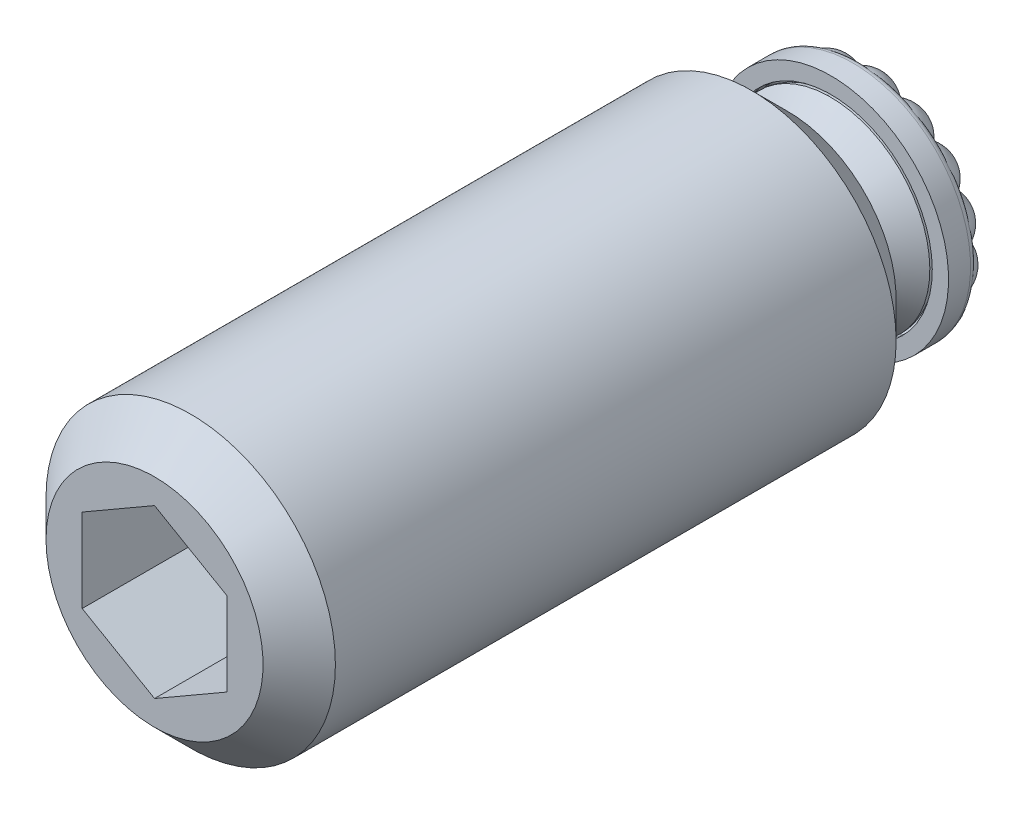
ISO-10303-21;
HEADER;
FILE_DESCRIPTION(('STEP AP214'),'2;1');
FILE_NAME('part.step','',(''),(''),'','','');
FILE_SCHEMA(('AUTOMOTIVE_DESIGN { 1 0 10303 214 1 1 1 1 }'));
ENDSEC;
DATA;
#1=APPLICATION_CONTEXT('core data for automotive mechanical design processes');
#2=APPLICATION_PROTOCOL_DEFINITION('international standard','automotive_design',2000,#1);
#3=PRODUCT_CONTEXT('',#1,'mechanical');
#4=PRODUCT('Part','Part','',(#3));
#5=PRODUCT_RELATED_PRODUCT_CATEGORY('part','',(#4));
#6=PRODUCT_DEFINITION_FORMATION('','',#4);
#7=PRODUCT_DEFINITION_CONTEXT('part definition',#1,'design');
#8=PRODUCT_DEFINITION('design','',#6,#7);
#9=PRODUCT_DEFINITION_SHAPE('','',#8);
#10=(LENGTH_UNIT() NAMED_UNIT(*) SI_UNIT(.MILLI.,.METRE.));
#11=(NAMED_UNIT(*) PLANE_ANGLE_UNIT() SI_UNIT($,.RADIAN.));
#12=(NAMED_UNIT(*) SI_UNIT($,.STERADIAN.) SOLID_ANGLE_UNIT());
#13=UNCERTAINTY_MEASURE_WITH_UNIT(LENGTH_MEASURE(1.E-05),#10,'distance_accuracy_value','');
#14=(GEOMETRIC_REPRESENTATION_CONTEXT(3) GLOBAL_UNCERTAINTY_ASSIGNED_CONTEXT((#13)) GLOBAL_UNIT_ASSIGNED_CONTEXT((#10,
#11,#12)) REPRESENTATION_CONTEXT('',''));
#15=CARTESIAN_POINT('',(0.,0.,0.));
#16=DIRECTION('',(0.,0.,1.));
#17=DIRECTION('',(1.,0.,0.));
#18=AXIS2_PLACEMENT_3D('',#15,#16,#17);
#19=CARTESIAN_POINT('',(0.,0.,2.0012600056));
#20=DIRECTION('',(0.,0.,-1.));
#21=DIRECTION('',(-0.262070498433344,0.965048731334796,0.));
#22=AXIS2_PLACEMENT_3D('',#19,#20,#21);
#23=PLANE('',#22);
#24=CARTESIAN_POINT('',(0.,0.,2.0012600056));
#25=DIRECTION('',(0.,0.,-1.));
#26=DIRECTION('',(-0.262070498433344,0.965048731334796,0.));
#27=AXIS2_PLACEMENT_3D('',#24,#25,#26);
#28=CIRCLE('',#27,5.3467);
#29=CARTESIAN_POINT('',(-1.40121233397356,5.15982605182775,2.0012600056));
#30=VERTEX_POINT('',#29);
#31=EDGE_CURVE('E856',#30,#30,#28,.T.);
#32=ORIENTED_EDGE('',*,*,#31,.F.);
#33=EDGE_LOOP('',(#32));
#34=FACE_BOUND('',#33,.T.);
#35=CARTESIAN_POINT('',(0.,0.,2.0012600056));
#36=DIRECTION('',(0.,0.,1.));
#37=DIRECTION('',(0.,-1.,0.));
#38=AXIS2_PLACEMENT_3D('',#35,#36,#37);
#39=CIRCLE('',#38,4.865);
#40=CARTESIAN_POINT('',(0.,-4.865,2.0012600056));
#41=VERTEX_POINT('',#40);
#42=EDGE_CURVE('E9',#41,#41,#39,.T.);
#43=ORIENTED_EDGE('',*,*,#42,.F.);
#44=EDGE_LOOP('',(#43));
#45=FACE_BOUND('',#44,.T.);
#46=ADVANCED_FACE('F14',(#34,#45),#23,.F.);
#47=CARTESIAN_POINT('',(5.90513318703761,1.60360937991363,1.0012600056));
#48=DIRECTION('',(0.,0.,1.));
#49=DIRECTION('',(0.262070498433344,-0.965048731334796,0.));
#50=AXIS2_PLACEMENT_3D('',#47,#48,#49);
#51=PLANE('',#50);
#52=CARTESIAN_POINT('',(3.8872550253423,3.00364855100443,1.0012600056));
#53=DIRECTION('',(0.,0.,1.));
#54=DIRECTION('',(0.262070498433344,-0.965048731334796,0.));
#55=AXIS2_PLACEMENT_3D('',#52,#53,#54);
#56=CIRCLE('',#55,1.47478812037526);
#57=CARTESIAN_POINT('',(3.90082636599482,4.47837422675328,1.0012600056));
#58=VERTEX_POINT('',#57);
#59=CARTESIAN_POINT('',(4.20698169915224,4.44336201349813,1.0012600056));
#60=VERTEX_POINT('',#59);
#61=EDGE_CURVE('E571',#58,#60,#56,.F.);
#62=ORIENTED_EDGE('',*,*,#61,.F.);
#63=CARTESIAN_POINT('',(2.44190881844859,4.26259751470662,1.0012600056));
#64=DIRECTION('',(0.,0.,1.));
#65=DIRECTION('',(0.262070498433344,-0.965048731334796,0.));
#66=AXIS2_PLACEMENT_3D('',#63,#64,#65);
#67=CIRCLE('',#66,1.47478812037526);
#68=CARTESIAN_POINT('',(3.82414046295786,4.77683061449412,1.0012600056));
#69=VERTEX_POINT('',#68);
#70=EDGE_CURVE('E431',#69,#58,#67,.F.);
#71=ORIENTED_EDGE('',*,*,#70,.F.);
#72=CARTESIAN_POINT('',(0.,0.,1.0012600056));
#73=DIRECTION('',(0.,0.,-1.));
#74=DIRECTION('',(-0.262070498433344,0.965048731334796,0.));
#75=AXIS2_PLACEMENT_3D('',#72,#73,#74);
#76=CIRCLE('',#75,6.119);
#77=EDGE_CURVE('E941',#69,#60,#76,.T.);
#78=ORIENTED_EDGE('',*,*,#77,.T.);
#79=EDGE_LOOP('',(#62,#71,#78));
#80=FACE_BOUND('',#79,.T.);
#81=ADVANCED_FACE('F241',(#80),#51,.F.);
#82=CARTESIAN_POINT('',(5.36105903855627,2.94978083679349,1.0012600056));
#83=VERTEX_POINT('',#82);
#84=CARTESIAN_POINT('',(5.31769325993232,2.64469666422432,1.0012600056));
#85=VERTEX_POINT('',#84);
#86=EDGE_CURVE('E575',#83,#85,#56,.F.);
#87=ORIENTED_EDGE('',*,*,#86,.F.);
#88=CARTESIAN_POINT('',(5.58714531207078,2.49518902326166,1.0012600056));
#89=VERTEX_POINT('',#88);
#90=EDGE_CURVE('E873',#83,#89,#76,.T.);
#91=ORIENTED_EDGE('',*,*,#90,.T.);
#92=CARTESIAN_POINT('',(4.74080189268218,1.2874213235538,1.0012600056));
#93=DIRECTION('',(0.,0.,1.));
#94=DIRECTION('',(0.262070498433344,-0.965048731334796,0.));
#95=AXIS2_PLACEMENT_3D('',#92,#93,#94);
#96=CIRCLE('',#95,1.47478812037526);
#97=EDGE_CURVE('E860',#85,#89,#96,.F.);
#98=ORIENTED_EDGE('',*,*,#97,.F.);
#99=EDGE_LOOP('',(#87,#91,#98));
#100=FACE_BOUND('',#99,.T.);
#101=ADVANCED_FACE('F247',(#100),#51,.F.);
#102=CARTESIAN_POINT('',(0.,0.,1.3822600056));
#103=DIRECTION('',(0.,0.,-1.));
#104=DIRECTION('',(-0.262070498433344,0.965048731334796,0.));
#105=AXIS2_PLACEMENT_3D('',#102,#103,#104);
#106=TOROIDAL_SURFACE('',#105,6.119,0.381);
#107=CARTESIAN_POINT('',(0.,0.,1.3822600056));
#108=DIRECTION('',(0.,0.,-1.));
#109=DIRECTION('',(-0.262070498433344,0.965048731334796,0.));
#110=AXIS2_PLACEMENT_3D('',#107,#108,#109);
#111=CIRCLE('',#110,6.5);
#112=CARTESIAN_POINT('',(-1.70345823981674,6.27281675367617,1.3822600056));
#113=VERTEX_POINT('',#112);
#114=EDGE_CURVE('E870',#113,#113,#111,.T.);
#115=ORIENTED_EDGE('',*,*,#114,.T.);
#116=EDGE_LOOP('',(#115));
#117=FACE_BOUND('',#116,.T.);
#118=CARTESIAN_POINT('',(3.51727619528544,4.53358718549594,1.3824600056));
#119=CARTESIAN_POINT('',(3.51964627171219,4.53170925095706,1.36426338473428));
#120=CARTESIAN_POINT('',(3.52397178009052,4.53001221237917,1.34640413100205));
#121=CARTESIAN_POINT('',(3.53584181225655,4.52692816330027,1.3119723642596));
#122=CARTESIAN_POINT('',(3.54334951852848,4.52553787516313,1.29538762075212));
#123=CARTESIAN_POINT('',(3.56092046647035,4.52298413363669,1.26378433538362));
#124=CARTESIAN_POINT('',(3.57096795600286,4.52181935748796,1.24875691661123));
#125=CARTESIAN_POINT('',(3.59309454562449,4.51960748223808,1.22021843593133));
#126=CARTESIAN_POINT('',(3.60518015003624,4.51856077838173,1.20671246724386));
#127=CARTESIAN_POINT('',(3.63899677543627,4.51584614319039,1.17324442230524));
#128=CARTESIAN_POINT('',(3.66200822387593,4.51420220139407,1.15457439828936));
#129=CARTESIAN_POINT('',(3.71062810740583,4.51066653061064,1.12106757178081));
#130=CARTESIAN_POINT('',(3.73624162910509,4.50877431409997,1.10623848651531));
#131=CARTESIAN_POINT('',(3.80317293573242,4.50335625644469,1.07299554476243));
#132=CARTESIAN_POINT('',(3.84559736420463,4.49949682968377,1.05687029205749));
#133=CARTESIAN_POINT('',(3.93218076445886,4.49003375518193,1.03120131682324));
#134=CARTESIAN_POINT('',(3.97634324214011,4.48442640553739,1.02167170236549));
#135=CARTESIAN_POINT('',(4.08644075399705,4.46789339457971,1.00483633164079));
#136=CARTESIAN_POINT('',(4.15268509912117,4.45570678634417,1.00077512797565));
#137=CARTESIAN_POINT('',(4.28371752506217,4.4259793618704,1.00183602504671));
#138=CARTESIAN_POINT('',(4.34850589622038,4.40843962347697,1.00695627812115));
#139=CARTESIAN_POINT('',(4.49347335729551,4.36165002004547,1.02667882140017));
#140=CARTESIAN_POINT('',(4.57273575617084,4.33048428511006,1.04357988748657));
#141=CARTESIAN_POINT('',(4.68661282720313,4.27575613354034,1.07413670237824));
#142=CARTESIAN_POINT('',(4.72388942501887,4.25607843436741,1.08525075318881));
#143=CARTESIAN_POINT('',(4.79648474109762,4.21385924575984,1.10840703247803));
#144=CARTESIAN_POINT('',(4.83180442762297,4.19131919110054,1.12044879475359));
#145=CARTESIAN_POINT('',(4.88759716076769,4.15195070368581,1.13973160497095));
#146=CARTESIAN_POINT('',(4.90872172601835,4.13610098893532,1.14709804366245));
#147=CARTESIAN_POINT('',(4.95007986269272,4.10292528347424,1.1610896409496));
#148=CARTESIAN_POINT('',(4.97031280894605,4.08559828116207,1.16771428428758));
#149=CARTESIAN_POINT('',(5.00936161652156,4.04960298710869,1.17920400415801));
#150=CARTESIAN_POINT('',(5.02819729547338,4.0309670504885,1.18410058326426));
#151=CARTESIAN_POINT('',(5.06452407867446,3.99197564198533,1.19111392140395));
#152=CARTESIAN_POINT('',(5.08201867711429,3.97162495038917,1.19323815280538));
#153=CARTESIAN_POINT('',(5.11240052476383,3.93304023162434,1.19391504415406));
#154=CARTESIAN_POINT('',(5.12556559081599,3.91503392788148,1.19301313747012));
#155=CARTESIAN_POINT('',(5.15052479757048,3.87830632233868,1.18903802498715));
#156=CARTESIAN_POINT('',(5.16231683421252,3.85958398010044,1.18596153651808));
#157=CARTESIAN_POINT('',(5.19601801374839,3.80216153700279,1.17436770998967));
#158=CARTESIAN_POINT('',(5.21584087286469,3.76274259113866,1.16350993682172));
#159=CARTESIAN_POINT('',(5.24995301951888,3.68511039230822,1.14084216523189));
#160=CARTESIAN_POINT('',(5.26451089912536,3.64697597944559,1.12913422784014));
#161=CARTESIAN_POINT('',(5.29034088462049,3.5695050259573,1.10594261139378));
#162=CARTESIAN_POINT('',(5.30161104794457,3.53016778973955,1.09445906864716));
#163=CARTESIAN_POINT('',(5.32109332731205,3.45062804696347,1.07275685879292));
#164=CARTESIAN_POINT('',(5.32932048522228,3.41043086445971,1.06253214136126));
#165=CARTESIAN_POINT('',(5.34298999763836,3.32914240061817,1.0439373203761));
#166=CARTESIAN_POINT('',(5.34843203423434,3.28805101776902,1.03556742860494));
#167=CARTESIAN_POINT('',(5.35947449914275,3.17722759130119,1.01639903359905));
#168=CARTESIAN_POINT('',(5.3627111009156,3.10685259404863,1.00776390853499));
#169=CARTESIAN_POINT('',(5.36264009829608,2.96548913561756,0.999742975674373));
#170=CARTESIAN_POINT('',(5.35933417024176,2.89450083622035,1.00035479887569));
#171=CARTESIAN_POINT('',(5.34956895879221,2.77871005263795,1.01142308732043));
#172=CARTESIAN_POINT('',(5.34461842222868,2.73343901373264,1.01835879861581));
#173=CARTESIAN_POINT('',(5.3330812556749,2.64449933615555,1.03843707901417));
#174=CARTESIAN_POINT('',(5.32649759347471,2.60082795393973,1.05156842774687));
#175=CARTESIAN_POINT('',(5.31479524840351,2.52989665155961,1.08000267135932));
#176=CARTESIAN_POINT('',(5.30987010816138,2.501807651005,1.0933117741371));
#177=CARTESIAN_POINT('',(5.30012900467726,2.44787317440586,1.12396107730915));
#178=CARTESIAN_POINT('',(5.2953128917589,2.42202446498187,1.14129533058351));
#179=CARTESIAN_POINT('',(5.287788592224,2.38107978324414,1.1745712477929));
#180=CARTESIAN_POINT('',(5.2848822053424,2.36508879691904,1.18936225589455));
#181=CARTESIAN_POINT('',(5.27976553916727,2.33544756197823,1.22125944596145));
#182=CARTESIAN_POINT('',(5.27755451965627,2.32179483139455,1.238363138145));
#183=CARTESIAN_POINT('',(5.27459635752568,2.30041882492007,1.27064760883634));
#184=CARTESIAN_POINT('',(5.27363064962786,2.29205319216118,1.2853810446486));
#185=CARTESIAN_POINT('',(5.27254672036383,2.27770511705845,1.31597274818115));
#186=CARTESIAN_POINT('',(5.27242596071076,2.27171558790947,1.33182750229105));
#187=CARTESIAN_POINT('',(5.2730673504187,2.2639198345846,1.35936597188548));
#188=CARTESIAN_POINT('',(5.27357299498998,2.26139591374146,1.37085743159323));
#189=CARTESIAN_POINT('',(5.27434738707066,2.25962480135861,1.38246000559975));
#190=B_SPLINE_CURVE_WITH_KNOTS('',3,(#118,#119,#120,#121,#122,#123,#124,#125,#126,#127,#128,
#129,#130,#131,#132,#133,#134,#135,#136,#137,#138,#139,#140,#141,#142,#143,#144,#145,#146,#147,
#148,#149,#150,#151,#152,#153,#154,#155,#156,#157,#158,#159,#160,#161,#162,#163,#164,#165,#166,
#167,#168,#169,#170,#171,#172,#173,#174,#175,#176,#177,#178,#179,#180,#181,#182,#183,#184,#185,
#186,#187,#188,#189),.UNSPECIFIED.,.F.,.F.,(4,2,2,2,2,2,2,2,2,2,2,2,2,2,2,2,2,2,2,2,2,2,2,2,2,2,
2,2,2,2,2,2,2,2,2,4),(0.,0.0550902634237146,0.109559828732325,0.163699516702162,
0.218015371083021,0.306544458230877,0.395250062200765,0.531137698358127,0.667315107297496,
0.868635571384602,1.06991552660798,1.32893764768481,1.45961049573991,1.59021809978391,
1.67242614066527,1.75469093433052,1.83536744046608,1.91582604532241,1.98261638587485,
2.04950776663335,2.18528184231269,2.31256217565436,2.43991756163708,2.56663472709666,
2.69336635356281,2.90548676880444,3.11755284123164,3.25539205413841,3.39298259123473,
3.48714264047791,3.58116444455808,3.64689270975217,3.71255076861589,3.76327629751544,
3.81384937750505,3.84909443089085),.UNSPECIFIED.);
#191=EDGE_CURVE('E577',#60,#83,#190,.T.);
#192=ORIENTED_EDGE('',*,*,#191,.F.);
#193=ORIENTED_EDGE('',*,*,#77,.F.);
#194=CARTESIAN_POINT('',(1.51461078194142,5.53449173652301,1.3824600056));
#195=CARTESIAN_POINT('',(1.51751910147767,5.5336637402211,1.36426338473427));
#196=CARTESIAN_POINT('',(1.52216477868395,5.53375118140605,1.34640413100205));
#197=CARTESIAN_POINT('',(1.5343114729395,5.53544435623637,1.3119723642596));
#198=CARTESIAN_POINT('',(1.54177972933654,5.5370329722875,1.29538762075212));
#199=CARTESIAN_POINT('',(1.55899044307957,5.54139773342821,1.26378433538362));
#200=CARTESIAN_POINT('',(1.5687188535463,5.54416662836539,1.24875691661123));
#201=CARTESIAN_POINT('',(1.59000760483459,5.55059060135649,1.22021843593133));
#202=CARTESIAN_POINT('',(1.60157380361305,5.55424853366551,1.20671246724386));
#203=CARTESIAN_POINT('',(1.63385513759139,5.56468160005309,1.17324442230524));
#204=CARTESIAN_POINT('',(1.65574405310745,5.57196889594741,1.15457439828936));
#205=CARTESIAN_POINT('',(1.70201601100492,5.58730838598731,1.12106757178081));
#206=CARTESIAN_POINT('',(1.72640393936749,5.59536207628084,1.10623848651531));
#207=CARTESIAN_POINT('',(1.79031380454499,5.61596994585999,1.07299554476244));
#208=CARTESIAN_POINT('',(1.83098580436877,5.62863942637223,1.05687029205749));
#209=CARTESIAN_POINT('',(1.91459979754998,5.65303071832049,1.03120131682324));
#210=CARTESIAN_POINT('',(1.95754644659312,5.66475045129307,1.02167170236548));
#211=CARTESIAN_POINT('',(2.06559019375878,5.69160843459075,1.00483633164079));
#212=CARTESIAN_POINT('',(2.13145560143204,5.70570009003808,1.00077512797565));
#213=CARTESIAN_POINT('',(2.26388997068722,5.72837946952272,1.00183602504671));
#214=CARTESIAN_POINT('',(2.33045878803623,5.73696830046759,1.00695627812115));
#215=CARTESIAN_POINT('',(2.48229686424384,5.7492169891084,1.02667882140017));
#216=CARTESIAN_POINT('',(2.56745238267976,5.750756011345,1.04357988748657));
#217=CARTESIAN_POINT('',(2.69360463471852,5.74377266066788,1.07413670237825));
#218=CARTESIAN_POINT('',(2.73557404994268,5.73985797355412,1.08525075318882));
#219=CARTESIAN_POINT('',(2.81879996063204,5.72863355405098,1.10840703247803));
#220=CARTESIAN_POINT('',(2.86005680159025,5.72132551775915,1.12044879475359));
#221=CARTESIAN_POINT('',(2.92666823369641,5.70630473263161,1.13973160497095));
#222=CARTESIAN_POINT('',(2.95225021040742,5.69974552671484,1.14709804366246));
#223=CARTESIAN_POINT('',(3.00315593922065,5.6849222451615,1.16108964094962));
#224=CARTESIAN_POINT('',(3.02847950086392,5.67665699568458,1.1677142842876));
#225=CARTESIAN_POINT('',(3.07833069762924,5.65834501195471,1.17920400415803));
#226=CARTESIAN_POINT('',(3.10286426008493,5.64833575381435,1.18410058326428));
#227=CARTESIAN_POINT('',(3.15134719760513,5.62621404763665,1.19111392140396));
#228=CARTESIAN_POINT('',(3.1752979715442,5.6141073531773,1.19323815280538));
#229=CARTESIAN_POINT('',(3.21813287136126,5.59008635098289,1.19391504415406));
#230=CARTESIAN_POINT('',(3.23718652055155,5.57848874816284,1.19301313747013));
#231=CARTESIAN_POINT('',(3.27430086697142,5.55410834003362,1.18903802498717));
#232=CARTESIAN_POINT('',(3.29236001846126,5.5413237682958,1.1859615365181));
#233=CARTESIAN_POINT('',(3.34547046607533,5.50116923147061,1.17436770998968));
#234=CARTESIAN_POINT('',(3.37886937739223,5.47233675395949,1.16350993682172));
#235=CARTESIAN_POINT('',(3.44009344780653,5.41366810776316,1.14084216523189));
#236=CARTESIAN_POINT('',(3.46813658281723,5.38400756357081,1.12913422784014));
#237=CARTESIAN_POINT('',(3.52164722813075,5.32231844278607,1.10594261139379));
#238=CARTESIAN_POINT('',(3.54711320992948,5.2902884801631,1.09445906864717));
#239=CARTESIAN_POINT('',(3.59555103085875,5.22425888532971,1.07275685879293));
#240=CARTESIAN_POINT('',(3.6185347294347,5.19026992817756,1.06253214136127));
#241=CARTESIAN_POINT('',(3.66227146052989,5.12040027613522,1.04393732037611));
#242=CARTESIAN_POINT('',(3.68302423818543,5.08451936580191,1.03556742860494));
#243=CARTESIAN_POINT('',(3.73563643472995,4.98635763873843,1.01639903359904));
#244=CARTESIAN_POINT('',(3.76555801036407,4.92257821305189,1.00776390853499));
#245=CARTESIAN_POINT('',(3.81958986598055,4.79194823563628,0.999742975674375));
#246=CARTESIAN_POINT('',(3.84370163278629,4.72509847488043,1.00035479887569));
#247=CARTESIAN_POINT('',(3.87899096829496,4.61438475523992,1.01142308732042));
#248=CARTESIAN_POINT('',(3.89174174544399,4.5706652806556,1.01835879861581));
#249=CARTESIAN_POINT('',(3.91511853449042,4.4840806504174,1.03843707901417));
#250=CARTESIAN_POINT('',(3.92574833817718,4.44121409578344,1.05156842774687));
#251=CARTESIAN_POINT('',(3.94208101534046,4.3712038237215,1.08000267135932));
#252=CARTESIAN_POINT('',(3.94827997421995,4.34336820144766,1.09331177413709));
#253=CARTESIAN_POINT('',(3.95992019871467,4.28981148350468,1.12396107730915));
#254=CARTESIAN_POINT('',(3.96536256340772,4.26408734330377,1.14129533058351));
#255=CARTESIAN_POINT('',(3.97407986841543,4.22337996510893,1.1745712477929));
#256=CARTESIAN_POINT('',(3.97751420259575,4.20749399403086,1.18936225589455));
#257=CARTESIAN_POINT('',(3.98413022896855,4.17815100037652,1.22125944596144));
#258=CARTESIAN_POINT('',(3.98731218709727,4.16469140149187,1.238363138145));
#259=CARTESIAN_POINT('',(3.99275944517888,4.14381050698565,1.27064760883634));
#260=CARTESIAN_POINT('',(3.99506863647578,4.1357121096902,1.2853810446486));
#261=CARTESIAN_POINT('',(3.9995579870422,4.12204141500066,1.31597274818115));
#262=CARTESIAN_POINT('',(4.00173851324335,4.116461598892,1.33182750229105));
#263=CARTESIAN_POINT('',(4.0053143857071,4.10950471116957,1.35936597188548));
#264=CARTESIAN_POINT('',(4.0067474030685,4.10736641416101,1.37085743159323));
#265=CARTESIAN_POINT('',(4.00814062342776,4.10602646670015,1.38246000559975));
#266=B_SPLINE_CURVE_WITH_KNOTS('',3,(#194,#195,#196,#197,#198,#199,#200,#201,#202,#203,#204,
#205,#206,#207,#208,#209,#210,#211,#212,#213,#214,#215,#216,#217,#218,#219,#220,#221,#222,#223,
#224,#225,#226,#227,#228,#229,#230,#231,#232,#233,#234,#235,#236,#237,#238,#239,#240,#241,#242,
#243,#244,#245,#246,#247,#248,#249,#250,#251,#252,#253,#254,#255,#256,#257,#258,#259,#260,#261,
#262,#263,#264,#265),.UNSPECIFIED.,.F.,.F.,(4,2,2,2,2,2,2,2,2,2,2,2,2,2,2,2,2,2,2,2,2,2,2,2,2,2,
2,2,2,2,2,2,2,2,2,4),(0.,0.0550902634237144,0.109559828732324,0.163699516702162,
0.218015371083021,0.306544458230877,0.395250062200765,0.531137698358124,0.66731510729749,
0.868635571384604,1.06991552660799,1.32893764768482,1.45961049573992,1.59021809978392,
1.67242614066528,1.75469093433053,1.83536744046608,1.91582604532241,1.98261638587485,
2.04950776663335,2.18528184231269,2.31256217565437,2.43991756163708,2.56663472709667,
2.69336635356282,2.90548676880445,3.11755284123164,3.25539205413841,3.39298259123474,
3.48714264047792,3.58116444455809,3.64689270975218,3.7125507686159,3.76327629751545,
3.81384937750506,3.84909443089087),.UNSPECIFIED.);
#267=CARTESIAN_POINT('',(2.18634325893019,5.71507341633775,1.0012600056));
#268=VERTEX_POINT('',#267);
#269=EDGE_CURVE('E420',#268,#69,#266,.T.);
#270=ORIENTED_EDGE('',*,*,#269,.F.);
#271=CARTESIAN_POINT('',(1.70503116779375,5.87665123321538,1.0012600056));
#272=VERTEX_POINT('',#271);
#273=EDGE_CURVE('E614',#272,#268,#76,.T.);
#274=ORIENTED_EDGE('',*,*,#273,.F.);
#275=CARTESIAN_POINT('',(-0.718640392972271,5.69282009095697,1.3824600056));
#276=CARTESIAN_POINT('',(-0.715636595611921,5.69316808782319,1.36426338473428));
#277=CARTESIAN_POINT('',(-0.711378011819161,5.69502669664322,1.34640413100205));
#278=CARTESIAN_POINT('',(-0.700803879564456,5.70123932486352,1.3119723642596));
#279=CARTESIAN_POINT('',(-0.694512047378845,5.70556499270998,1.29538762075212));
#280=CARTESIAN_POINT('',(-0.680281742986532,5.71618376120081,1.26378433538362));
#281=CARTESIAN_POINT('',(-0.672353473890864,5.72246478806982,1.24875691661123));
#282=CARTESIAN_POINT('',(-0.655143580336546,5.73654661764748,1.22021843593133));
#283=CARTESIAN_POINT('',(-0.645857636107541,5.74435229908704,1.20671246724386));
#284=CARTESIAN_POINT('',(-0.620026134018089,5.76634472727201,1.17324442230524));
#285=CARTESIAN_POINT('',(-0.602592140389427,5.78145383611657,1.15457439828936));
#286=CARTESIAN_POINT('',(-0.565712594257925,5.81333318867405,1.12106757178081));
#287=CARTESIAN_POINT('',(-0.546263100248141,5.8301066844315,1.10623848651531));
#288=CARTESIAN_POINT('',(-0.495104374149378,5.87360311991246,1.07299554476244));
#289=CARTESIAN_POINT('',(-0.462376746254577,5.90087269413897,1.05687029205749));
#290=CARTESIAN_POINT('',(-0.394461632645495,5.9554049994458,1.03120131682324));
#291=CARTESIAN_POINT('',(-0.359269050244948,5.98266759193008,1.02167170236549));
#292=CARTESIAN_POINT('',(-0.269727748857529,6.04882768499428,1.00483633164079));
#293=CARTESIAN_POINT('',(-0.21426868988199,6.0870522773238,1.00077512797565));
#294=CARTESIAN_POINT('',(-0.100594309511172,6.15868573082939,1.00183602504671));
#295=CARTESIAN_POINT('',(-0.0423795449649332,6.19209555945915,1.00695627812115));
#296=CARTESIAN_POINT('',(0.0932131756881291,6.26151778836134,1.02667882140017));
#297=CARTESIAN_POINT('',(0.171297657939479,6.2955272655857,1.04357988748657));
#298=CARTESIAN_POINT('',(0.290519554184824,6.33735186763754,1.07413670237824));
#299=CARTESIAN_POINT('',(0.330792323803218,6.34979616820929,1.08525075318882));
#300=CARTESIAN_POINT('',(0.411978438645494,6.37127533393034,1.10840703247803));
#301=CARTESIAN_POINT('',(0.452891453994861,6.38031189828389,1.12044879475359));
#302=CARTESIAN_POINT('',(0.520180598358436,6.39192559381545,1.13973160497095));
#303=CARTESIAN_POINT('',(0.54632536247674,6.39565547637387,1.14709804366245));
#304=CARTESIAN_POINT('',(0.5990287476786,6.40144132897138,1.16108964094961));
#305=CARTESIAN_POINT('',(0.625587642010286,6.40349614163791,1.16771428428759));
#306=CARTESIAN_POINT('',(0.678651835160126,6.40565530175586,1.17920400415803));
#307=CARTESIAN_POINT('',(0.705148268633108,6.40579654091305,1.18410058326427));
#308=CARTESIAN_POINT('',(0.758406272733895,6.40391236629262,1.19111392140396));
#309=CARTESIAN_POINT('',(0.785166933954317,6.40189280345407,1.19323815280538));
#310=CARTESIAN_POINT('',(0.833933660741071,6.39609249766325,1.19391504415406));
#311=CARTESIAN_POINT('',(0.855975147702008,6.39266922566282,1.19301313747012));
#312=CARTESIAN_POINT('',(0.899594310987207,6.38434771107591,1.18903802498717));
#313=CARTESIAN_POINT('',(0.921171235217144,6.37944724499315,1.18596153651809));
#314=CARTESIAN_POINT('',(0.985605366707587,6.36267377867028,1.17436770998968));
#315=CARTESIAN_POINT('',(1.02749564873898,6.34881725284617,1.16350993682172));
#316=CARTESIAN_POINT('',(1.10651083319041,6.31804392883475,1.14084216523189));
#317=CARTESIAN_POINT('',(1.14376991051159,6.30137280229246,1.12913422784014));
#318=CARTESIAN_POINT('',(1.21681470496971,6.26485712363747,1.10594261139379));
#319=CARTESIAN_POINT('',(1.25259954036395,6.24501070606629,1.09445906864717));
#320=CARTESIAN_POINT('',(1.32261868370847,6.20254366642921,1.07275685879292));
#321=CARTESIAN_POINT('',(1.35685986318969,6.17993744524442,1.06253214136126));
#322=CARTESIAN_POINT('',(1.4240052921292,6.13212362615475,1.0439373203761));
#323=CARTESIAN_POINT('',(1.45690938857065,6.10691573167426,1.03556742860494));
#324=CARTESIAN_POINT('',(1.54308158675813,6.03635993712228,1.01639903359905));
#325=CARTESIAN_POINT('',(1.59513284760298,5.9888859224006,1.00776390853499));
#326=CARTESIAN_POINT('',(1.69504170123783,5.88887665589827,0.999742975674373));
#327=CARTESIAN_POINT('',(1.74290036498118,5.83634270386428,1.00035479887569));
#328=CARTESIAN_POINT('',(1.81787176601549,5.74756120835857,1.01142308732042));
#329=CARTESIAN_POINT('',(1.84638266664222,5.71204919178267,1.01835879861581));
#330=CARTESIAN_POINT('',(1.90111450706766,5.64100133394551,1.03843707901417));
#331=CARTESIAN_POINT('',(1.92733948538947,5.60546565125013,1.05156842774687));
#332=CARTESIAN_POINT('',(1.96922068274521,5.54703483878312,1.08000267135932));
#333=CARTESIAN_POINT('',(1.98560000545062,5.52369031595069,1.09331177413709));
#334=CARTESIAN_POINT('',(2.01684943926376,5.47866488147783,1.12396107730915));
#335=CARTESIAN_POINT('',(2.03172173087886,5.45698157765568,1.14129533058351));
#336=CARTESIAN_POINT('',(2.05535350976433,5.4227088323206,1.1745712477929));
#337=CARTESIAN_POINT('',(2.06460571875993,5.40934637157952,1.18936225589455));
#338=CARTESIAN_POINT('',(2.08194720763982,5.38476882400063,1.22125944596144));
#339=CARTESIAN_POINT('',(2.09003771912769,5.37355145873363,1.238363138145));
#340=CARTESIAN_POINT('',(2.10306110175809,5.35634460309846,1.27064760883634));
#341=CARTESIAN_POINT('',(2.10829363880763,5.34974634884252,1.2853810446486));
#342=CARTESIAN_POINT('',(2.11767280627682,5.33883427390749,1.31597274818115));
#343=CARTESIAN_POINT('',(2.1218226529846,5.33451364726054,1.33182750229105));
#344=CARTESIAN_POINT('',(2.12778861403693,5.32945474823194,1.35936597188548));
#345=CARTESIAN_POINT('',(2.12993084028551,5.3280276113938,1.37085743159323));
#346=CARTESIAN_POINT('',(2.13173078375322,5.32732282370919,1.38246000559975));
#347=B_SPLINE_CURVE_WITH_KNOTS('',3,(#275,#276,#277,#278,#279,#280,#281,#282,#283,#284,#285,
#286,#287,#288,#289,#290,#291,#292,#293,#294,#295,#296,#297,#298,#299,#300,#301,#302,#303,#304,
#305,#306,#307,#308,#309,#310,#311,#312,#313,#314,#315,#316,#317,#318,#319,#320,#321,#322,#323,
#324,#325,#326,#327,#328,#329,#330,#331,#332,#333,#334,#335,#336,#337,#338,#339,#340,#341,#342,
#343,#344,#345,#346),.UNSPECIFIED.,.F.,.F.,(4,2,2,2,2,2,2,2,2,2,2,2,2,2,2,2,2,2,2,2,2,2,2,2,2,2,
2,2,2,2,2,2,2,2,2,4),(0.,0.0550902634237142,0.109559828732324,0.163699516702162,
0.218015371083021,0.306544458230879,0.395250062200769,0.531137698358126,0.667315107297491,
0.868635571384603,1.06991552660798,1.32893764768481,1.45961049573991,1.59021809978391,
1.67242614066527,1.75469093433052,1.83536744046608,1.91582604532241,1.98261638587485,
2.04950776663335,2.1852818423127,2.31256217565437,2.43991756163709,2.56663472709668,
2.69336635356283,2.90548676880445,3.11755284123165,3.25539205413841,3.39298259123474,
3.48714264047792,3.58116444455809,3.64689270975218,3.71255076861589,3.76327629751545,
3.81384937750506,3.84909443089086),.UNSPECIFIED.);
#348=CARTESIAN_POINT('',(-0.167146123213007,6.11671669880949,1.0012600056));
#349=VERTEX_POINT('',#348);
#350=EDGE_CURVE('E411',#349,#272,#347,.T.);
#351=ORIENTED_EDGE('',*,*,#350,.F.);
#352=CARTESIAN_POINT('',(-0.67365366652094,6.08180497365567,1.0012600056));
#353=VERTEX_POINT('',#352);
#354=EDGE_CURVE('E942',#353,#349,#76,.T.);
#355=ORIENTED_EDGE('',*,*,#354,.F.);
#356=CARTESIAN_POINT('',(-2.84248508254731,4.98446819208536,1.3824600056));
#357=CARTESIAN_POINT('',(-2.83984310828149,4.98593920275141,1.36426338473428));
#358=CARTESIAN_POINT('',(-2.83661994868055,4.98928602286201,1.34640413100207));
#359=CARTESIAN_POINT('',(-2.82922819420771,4.99907228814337,1.31197236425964));
#360=CARTESIAN_POINT('',(-2.82507066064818,5.00547646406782,1.29538762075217));
#361=CARTESIAN_POINT('',(-2.81598720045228,5.02073262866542,1.26378433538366));
#362=CARTESIAN_POINT('',(-2.81106607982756,5.02956955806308,1.24875691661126));
#363=CARTESIAN_POINT('',(-2.80055509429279,5.04916541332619,1.22021843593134));
#364=CARTESIAN_POINT('',(-2.79496310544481,5.05993049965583,1.20671246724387));
#365=CARTESIAN_POINT('',(-2.7795140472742,5.09013414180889,1.17324442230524));
#366=CARTESIAN_POINT('',(-2.76918914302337,5.1107648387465,1.15457439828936));
#367=CARTESIAN_POINT('',(-2.74731658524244,5.15433071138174,1.12106757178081));
#368=CARTESIAN_POINT('',(-2.73576653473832,5.17727039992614,1.10623848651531));
#369=CARTESIAN_POINT('',(-2.70514740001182,5.2370334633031,1.07299554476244));
#370=CARTESIAN_POINT('',(-2.68534662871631,5.27475158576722,1.05687029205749));
#371=CARTESIAN_POINT('',(-2.6434698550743,5.35112285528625,1.03120131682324));
#372=CARTESIAN_POINT('',(-2.62138909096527,5.3897778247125,1.02167170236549));
#373=CARTESIAN_POINT('',(-2.56398208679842,5.48516775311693,1.00483633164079));
#374=CARTESIAN_POINT('',(-2.527372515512,5.54170593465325,1.00077512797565));
#375=CARTESIAN_POINT('',(-2.44976401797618,5.65138791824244,1.00183602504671));
#376=CARTESIAN_POINT('',(-2.40876597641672,5.70453240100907,1.00695627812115));
#377=CARTESIAN_POINT('',(-2.31006137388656,5.82055926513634,1.02667882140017));
#378=CARTESIAN_POINT('',(-2.25093558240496,5.88186156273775,1.04357988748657));
#379=CARTESIAN_POINT('',(-2.1567944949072,5.96612670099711,1.07413670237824));
#380=CARTESIAN_POINT('',(-2.12434953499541,5.99303545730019,1.08525075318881));
#381=CARTESIAN_POINT('',(-2.05756306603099,6.04394819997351,1.10840703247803));
#382=CARTESIAN_POINT('',(-2.02322251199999,6.06795362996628,1.12044879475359));
#383=CARTESIAN_POINT('',(-1.96549981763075,6.10443372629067,1.13973160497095));
#384=CARTESIAN_POINT('',(-1.94277256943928,6.11788485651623,1.14709804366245));
#385=CARTESIAN_POINT('',(-1.8962951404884,6.14339899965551,1.16108964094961));
#386=CARTESIAN_POINT('',(-1.87254426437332,6.15546104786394,1.16771428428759));
#387=CARTESIAN_POINT('',(-1.82434561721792,6.17776263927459,1.17920400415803));
#388=CARTESIAN_POINT('',(-1.79992015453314,6.18803287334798,1.18410058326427));
#389=CARTESIAN_POINT('',(-1.74999513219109,6.20667307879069,1.19111392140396));
#390=CARTESIAN_POINT('',(-1.72449865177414,6.21504810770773,1.19323815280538));
#391=CARTESIAN_POINT('',(-1.67722439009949,6.22835154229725,1.19391504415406));
#392=CARTESIAN_POINT('',(-1.65555068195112,6.23362376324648,1.19301313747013));
#393=CARTESIAN_POINT('',(-1.61206732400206,6.24262801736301,1.18903802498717));
#394=CARTESIAN_POINT('',(-1.59025751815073,6.24635770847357,1.1859615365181));
#395=CARTESIAN_POINT('',(-1.52430921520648,6.25551892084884,1.17436770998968));
#396=CARTESIAN_POINT('',(-1.48030497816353,6.25874787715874,1.16350993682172));
#397=CARTESIAN_POINT('',(-1.39552802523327,6.26055483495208,1.14084216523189));
#398=CARTESIAN_POINT('',(-1.35472536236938,6.25941115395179,1.12913422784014));
#399=CARTESIAN_POINT('',(-1.27326682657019,6.25362809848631,1.10594261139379));
#400=CARTESIAN_POINT('',(-1.23261105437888,6.24898666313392,1.09445906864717));
#401=CARTESIAN_POINT('',(-1.15167036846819,6.23654740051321,1.07275685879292));
#402=CARTESIAN_POINT('',(-1.11138461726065,6.22876550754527,1.06253214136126));
#403=CARTESIAN_POINT('',(-1.03105277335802,6.21028674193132,1.0439373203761));
#404=CARTESIAN_POINT('',(-0.991006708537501,6.19958953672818,1.03556742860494));
#405=CARTESIAN_POINT('',(-0.88439344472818,6.16738115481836,1.01639903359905));
#406=CARTESIAN_POINT('',(-0.818136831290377,6.1434400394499,1.00776390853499));
#407=CARTESIAN_POINT('',(-0.687561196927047,6.08927698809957,0.999742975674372));
#408=CARTESIAN_POINT('',(-0.623241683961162,6.05905666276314,1.00035479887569));
#409=CARTESIAN_POINT('',(-0.520001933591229,6.0057235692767,1.01142308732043));
#410=CARTESIAN_POINT('',(-0.480071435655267,5.9838253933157,1.01835879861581));
#411=CARTESIAN_POINT('',(-0.402316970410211,5.93913070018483,1.03843707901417));
#412=CARTESIAN_POINT('',(-0.364489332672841,5.91633587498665,1.05156842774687));
#413=CARTESIAN_POINT('',(-0.303435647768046,5.87838008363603,1.08000267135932));
#414=CARTESIAN_POINT('',(-0.279369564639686,5.86308065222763,1.09331177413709));
#415=CARTESIAN_POINT('',(-0.233268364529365,5.8334412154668,1.12396107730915));
#416=CARTESIAN_POINT('',(-0.211230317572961,5.81909983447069,1.14129533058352));
#417=CARTESIAN_POINT('',(-0.176281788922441,5.79647943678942,1.1745712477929));
#418=CARTESIAN_POINT('',(-0.162620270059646,5.78767479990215,1.18936225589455));
#419=CARTESIAN_POINT('',(-0.137193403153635,5.77160440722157,1.22125944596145));
#420=CARTESIAN_POINT('',(-0.125426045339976,5.76433701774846,1.238363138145));
#421=CARTESIAN_POINT('',(-0.106809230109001,5.75342378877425,1.27064760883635));
#422=CARTESIAN_POINT('',(-0.0994499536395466,5.74933020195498,1.28538104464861));
#423=CARTESIAN_POINT('',(-0.0866088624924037,5.74283801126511,1.31597274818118));
#424=CARTESIAN_POINT('',(-0.0811214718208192,5.7404343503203,1.33182750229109));
#425=CARTESIAN_POINT('',(-0.0736736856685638,5.7380436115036,1.35936597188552));
#426=CARTESIAN_POINT('',(-0.0711483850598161,5.73754490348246,1.37085743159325));
#427=CARTESIAN_POINT('',(-0.0692157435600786,5.73758257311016,1.38246000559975));
#428=B_SPLINE_CURVE_WITH_KNOTS('',3,(#356,#357,#358,#359,#360,#361,#362,#363,#364,#365,#366,
#367,#368,#369,#370,#371,#372,#373,#374,#375,#376,#377,#378,#379,#380,#381,#382,#383,#384,#385,
#386,#387,#388,#389,#390,#391,#392,#393,#394,#395,#396,#397,#398,#399,#400,#401,#402,#403,#404,
#405,#406,#407,#408,#409,#410,#411,#412,#413,#414,#415,#416,#417,#418,#419,#420,#421,#422,#423,
#424,#425,#426,#427),.UNSPECIFIED.,.F.,.F.,(4,2,2,2,2,2,2,2,2,2,2,2,2,2,2,2,2,2,2,2,2,2,2,2,2,2,
2,2,2,2,2,2,2,2,2,4),(0.,0.0550902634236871,0.109559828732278,0.163699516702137,
0.218015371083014,0.306544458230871,0.395250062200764,0.53113769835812,0.667315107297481,
0.868635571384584,1.06991552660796,1.32893764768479,1.45961049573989,1.59021809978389,
1.67242614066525,1.75469093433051,1.83536744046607,1.91582604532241,1.98261638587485,
2.04950776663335,2.1852818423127,2.31256217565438,2.4399175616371,2.56663472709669,
2.69336635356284,2.90548676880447,3.11755284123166,3.25539205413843,3.39298259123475,
3.48714264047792,3.58116444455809,3.64689270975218,3.7125507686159,3.76327629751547,
3.8138493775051,3.84909443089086),.UNSPECIFIED.);
#429=CARTESIAN_POINT('',(-2.49518902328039,5.58714531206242,1.0012600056));
#430=VERTEX_POINT('',#429);
#431=EDGE_CURVE('E402',#430,#353,#428,.T.);
#432=ORIENTED_EDGE('',*,*,#431,.F.);
#433=CARTESIAN_POINT('',(-2.94978083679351,5.36105903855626,1.0012600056));
#434=VERTEX_POINT('',#433);
#435=EDGE_CURVE('E944',#434,#430,#76,.T.);
#436=ORIENTED_EDGE('',*,*,#435,.F.);
#437=CARTESIAN_POINT('',(-4.53358718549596,3.51727619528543,1.3824600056));
#438=CARTESIAN_POINT('',(-4.53170925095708,3.51964627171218,1.36426338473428));
#439=CARTESIAN_POINT('',(-4.53001221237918,3.52397178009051,1.34640413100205));
#440=CARTESIAN_POINT('',(-4.52692816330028,3.53584181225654,1.3119723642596));
#441=CARTESIAN_POINT('',(-4.52553787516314,3.54334951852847,1.29538762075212));
#442=CARTESIAN_POINT('',(-4.5229841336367,3.56092046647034,1.26378433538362));
#443=CARTESIAN_POINT('',(-4.52181935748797,3.57096795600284,1.24875691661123));
#444=CARTESIAN_POINT('',(-4.51960748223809,3.59309454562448,1.22021843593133));
#445=CARTESIAN_POINT('',(-4.51856077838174,3.60518015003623,1.20671246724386));
#446=CARTESIAN_POINT('',(-4.5158461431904,3.63899677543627,1.17324442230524));
#447=CARTESIAN_POINT('',(-4.51420220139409,3.66200822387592,1.15457439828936));
#448=CARTESIAN_POINT('',(-4.51066653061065,3.71062810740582,1.12106757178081));
#449=CARTESIAN_POINT('',(-4.50877431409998,3.73624162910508,1.10623848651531));
#450=CARTESIAN_POINT('',(-4.5033562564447,3.80317293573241,1.07299554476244));
#451=CARTESIAN_POINT('',(-4.49949682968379,3.84559736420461,1.05687029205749));
#452=CARTESIAN_POINT('',(-4.49003375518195,3.93218076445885,1.03120131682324));
#453=CARTESIAN_POINT('',(-4.48442640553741,3.97634324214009,1.02167170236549));
#454=CARTESIAN_POINT('',(-4.46789339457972,4.08644075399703,1.00483633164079));
#455=CARTESIAN_POINT('',(-4.45570678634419,4.15268509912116,1.00077512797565));
#456=CARTESIAN_POINT('',(-4.42597936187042,4.28371752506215,1.00183602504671));
#457=CARTESIAN_POINT('',(-4.40843962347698,4.34850589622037,1.00695627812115));
#458=CARTESIAN_POINT('',(-4.36165002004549,4.4934733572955,1.02667882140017));
#459=CARTESIAN_POINT('',(-4.33048428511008,4.57273575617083,1.04357988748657));
#460=CARTESIAN_POINT('',(-4.27575613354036,4.68661282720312,1.07413670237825));
#461=CARTESIAN_POINT('',(-4.25607843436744,4.72388942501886,1.08525075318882));
#462=CARTESIAN_POINT('',(-4.21385924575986,4.79648474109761,1.10840703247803));
#463=CARTESIAN_POINT('',(-4.19131919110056,4.83180442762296,1.12044879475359));
#464=CARTESIAN_POINT('',(-4.15195070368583,4.88759716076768,1.13973160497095));
#465=CARTESIAN_POINT('',(-4.13610098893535,4.90872172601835,1.14709804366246));
#466=CARTESIAN_POINT('',(-4.10292528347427,4.95007986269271,1.16108964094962));
#467=CARTESIAN_POINT('',(-4.08559828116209,4.97031280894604,1.1677142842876));
#468=CARTESIAN_POINT('',(-4.04960298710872,5.00936161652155,1.17920400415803));
#469=CARTESIAN_POINT('',(-4.03096705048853,5.02819729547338,1.18410058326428));
#470=CARTESIAN_POINT('',(-3.99197564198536,5.06452407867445,1.19111392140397));
#471=CARTESIAN_POINT('',(-3.97162495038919,5.08201867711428,1.19323815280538));
#472=CARTESIAN_POINT('',(-3.93304023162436,5.11240052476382,1.19391504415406));
#473=CARTESIAN_POINT('',(-3.9150339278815,5.12556559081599,1.19301313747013));
#474=CARTESIAN_POINT('',(-3.8783063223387,5.15052479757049,1.18903802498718));
#475=CARTESIAN_POINT('',(-3.85958398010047,5.16231683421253,1.18596153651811));
#476=CARTESIAN_POINT('',(-3.80216153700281,5.19601801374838,1.17436770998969));
#477=CARTESIAN_POINT('',(-3.76274259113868,5.21584087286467,1.16350993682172));
#478=CARTESIAN_POINT('',(-3.68511039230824,5.24995301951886,1.14084216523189));
#479=CARTESIAN_POINT('',(-3.64697597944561,5.26451089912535,1.12913422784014));
#480=CARTESIAN_POINT('',(-3.56950502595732,5.2903408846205,1.10594261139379));
#481=CARTESIAN_POINT('',(-3.53016778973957,5.30161104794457,1.09445906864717));
#482=CARTESIAN_POINT('',(-3.45062804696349,5.32109332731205,1.07275685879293));
#483=CARTESIAN_POINT('',(-3.41043086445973,5.32932048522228,1.06253214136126));
#484=CARTESIAN_POINT('',(-3.32914240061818,5.34298999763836,1.04393732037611));
#485=CARTESIAN_POINT('',(-3.28805101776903,5.34843203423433,1.03556742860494));
#486=CARTESIAN_POINT('',(-3.1772275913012,5.35947449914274,1.01639903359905));
#487=CARTESIAN_POINT('',(-3.10685259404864,5.36271110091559,1.00776390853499));
#488=CARTESIAN_POINT('',(-2.96548913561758,5.36264009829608,0.999742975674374));
#489=CARTESIAN_POINT('',(-2.89450083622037,5.35933417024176,1.00035479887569));
#490=CARTESIAN_POINT('',(-2.77871005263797,5.34956895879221,1.01142308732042));
#491=CARTESIAN_POINT('',(-2.73343901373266,5.34461842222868,1.01835879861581));
#492=CARTESIAN_POINT('',(-2.64449933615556,5.3330812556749,1.03843707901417));
#493=CARTESIAN_POINT('',(-2.60082795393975,5.32649759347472,1.05156842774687));
#494=CARTESIAN_POINT('',(-2.52989665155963,5.31479524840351,1.08000267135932));
#495=CARTESIAN_POINT('',(-2.50180765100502,5.30987010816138,1.09331177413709));
#496=CARTESIAN_POINT('',(-2.44787317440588,5.30012900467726,1.12396107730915));
#497=CARTESIAN_POINT('',(-2.42202446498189,5.2953128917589,1.14129533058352));
#498=CARTESIAN_POINT('',(-2.38107978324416,5.287788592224,1.1745712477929));
#499=CARTESIAN_POINT('',(-2.36508879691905,5.28488220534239,1.18936225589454));
#500=CARTESIAN_POINT('',(-2.33544756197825,5.27976553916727,1.22125944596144));
#501=CARTESIAN_POINT('',(-2.32179483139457,5.27755451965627,1.238363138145));
#502=CARTESIAN_POINT('',(-2.30041882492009,5.27459635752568,1.27064760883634));
#503=CARTESIAN_POINT('',(-2.29205319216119,5.27363064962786,1.2853810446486));
#504=CARTESIAN_POINT('',(-2.27770511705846,5.27254672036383,1.31597274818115));
#505=CARTESIAN_POINT('',(-2.27171558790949,5.27242596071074,1.33182750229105));
#506=CARTESIAN_POINT('',(-2.26391983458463,5.27306735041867,1.35936597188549));
#507=CARTESIAN_POINT('',(-2.26139591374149,5.27357299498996,1.37085743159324));
#508=CARTESIAN_POINT('',(-2.25962480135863,5.27434738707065,1.38246000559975));
#509=B_SPLINE_CURVE_WITH_KNOTS('',3,(#437,#438,#439,#440,#441,#442,#443,#444,#445,#446,#447,
#448,#449,#450,#451,#452,#453,#454,#455,#456,#457,#458,#459,#460,#461,#462,#463,#464,#465,#466,
#467,#468,#469,#470,#471,#472,#473,#474,#475,#476,#477,#478,#479,#480,#481,#482,#483,#484,#485,
#486,#487,#488,#489,#490,#491,#492,#493,#494,#495,#496,#497,#498,#499,#500,#501,#502,#503,#504,
#505,#506,#507,#508),.UNSPECIFIED.,.F.,.F.,(4,2,2,2,2,2,2,2,2,2,2,2,2,2,2,2,2,2,2,2,2,2,2,2,2,2,
2,2,2,2,2,2,2,2,2,4),(0.,0.0550902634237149,0.109559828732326,0.163699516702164,
0.218015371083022,0.306544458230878,0.395250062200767,0.531137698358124,0.667315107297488,
0.868635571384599,1.06991552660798,1.32893764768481,1.45961049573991,1.59021809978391,
1.67242614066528,1.75469093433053,1.83536744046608,1.91582604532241,1.98261638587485,
2.04950776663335,2.1852818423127,2.31256217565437,2.43991756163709,2.56663472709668,
2.69336635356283,2.90548676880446,3.11755284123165,3.25539205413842,3.39298259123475,
3.48714264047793,3.5811644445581,3.64689270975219,3.7125507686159,3.76327629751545,
3.81384937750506,3.84909443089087),.UNSPECIFIED.);
#510=CARTESIAN_POINT('',(-4.44336201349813,4.20698169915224,1.0012600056));
#511=VERTEX_POINT('',#510);
#512=EDGE_CURVE('E392',#511,#434,#509,.T.);
#513=ORIENTED_EDGE('',*,*,#512,.F.);
#514=CARTESIAN_POINT('',(-4.77683061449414,3.82414046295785,1.0012600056));
#515=VERTEX_POINT('',#514);
#516=EDGE_CURVE('E950',#515,#511,#76,.T.);
#517=ORIENTED_EDGE('',*,*,#516,.F.);
#518=CARTESIAN_POINT('',(-5.53449173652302,1.5146107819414,1.3824600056));
#519=CARTESIAN_POINT('',(-5.53366374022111,1.51751910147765,1.36426338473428));
#520=CARTESIAN_POINT('',(-5.53375118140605,1.52216477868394,1.34640413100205));
#521=CARTESIAN_POINT('',(-5.53544435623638,1.53431147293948,1.3119723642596));
#522=CARTESIAN_POINT('',(-5.53703297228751,1.54177972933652,1.29538762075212));
#523=CARTESIAN_POINT('',(-5.54139773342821,1.55899044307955,1.26378433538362));
#524=CARTESIAN_POINT('',(-5.54416662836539,1.56871885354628,1.24875691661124));
#525=CARTESIAN_POINT('',(-5.5505906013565,1.59000760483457,1.22021843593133));
#526=CARTESIAN_POINT('',(-5.55424853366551,1.60157380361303,1.20671246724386));
#527=CARTESIAN_POINT('',(-5.56468160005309,1.63385513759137,1.17324442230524));
#528=CARTESIAN_POINT('',(-5.57196889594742,1.65574405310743,1.15457439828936));
#529=CARTESIAN_POINT('',(-5.58730838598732,1.70201601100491,1.12106757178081));
#530=CARTESIAN_POINT('',(-5.59536207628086,1.72640393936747,1.10623848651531));
#531=CARTESIAN_POINT('',(-5.61596994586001,1.79031380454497,1.07299554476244));
#532=CARTESIAN_POINT('',(-5.62863942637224,1.83098580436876,1.05687029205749));
#533=CARTESIAN_POINT('',(-5.65303071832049,1.91459979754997,1.03120131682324));
#534=CARTESIAN_POINT('',(-5.66475045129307,1.9575464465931,1.02167170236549));
#535=CARTESIAN_POINT('',(-5.69160843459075,2.06559019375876,1.00483633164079));
#536=CARTESIAN_POINT('',(-5.70570009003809,2.13145560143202,1.00077512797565));
#537=CARTESIAN_POINT('',(-5.72837946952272,2.2638899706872,1.00183602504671));
#538=CARTESIAN_POINT('',(-5.7369683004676,2.3304587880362,1.00695627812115));
#539=CARTESIAN_POINT('',(-5.74921698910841,2.48229686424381,1.02667882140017));
#540=CARTESIAN_POINT('',(-5.75075601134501,2.56745238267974,1.04357988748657));
#541=CARTESIAN_POINT('',(-5.74377266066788,2.6936046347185,1.07413670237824));
#542=CARTESIAN_POINT('',(-5.73985797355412,2.73557404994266,1.08525075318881));
#543=CARTESIAN_POINT('',(-5.72863355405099,2.81879996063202,1.10840703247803));
#544=CARTESIAN_POINT('',(-5.72132551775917,2.86005680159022,1.12044879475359));
#545=CARTESIAN_POINT('',(-5.70630473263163,2.92666823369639,1.13973160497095));
#546=CARTESIAN_POINT('',(-5.69974552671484,2.95225021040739,1.14709804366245));
#547=CARTESIAN_POINT('',(-5.6849222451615,3.00315593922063,1.1610896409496));
#548=CARTESIAN_POINT('',(-5.67665699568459,3.0284795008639,1.16771428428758));
#549=CARTESIAN_POINT('',(-5.65834501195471,3.07833069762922,1.17920400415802));
#550=CARTESIAN_POINT('',(-5.64833575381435,3.10286426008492,1.18410058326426));
#551=CARTESIAN_POINT('',(-5.62621404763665,3.15134719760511,1.19111392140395));
#552=CARTESIAN_POINT('',(-5.6141073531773,3.1752979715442,1.19323815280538));
#553=CARTESIAN_POINT('',(-5.5900863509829,3.21813287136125,1.19391504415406));
#554=CARTESIAN_POINT('',(-5.57848874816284,3.23718652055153,1.19301313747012));
#555=CARTESIAN_POINT('',(-5.55410834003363,3.27430086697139,1.18903802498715));
#556=CARTESIAN_POINT('',(-5.5413237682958,3.29236001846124,1.18596153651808));
#557=CARTESIAN_POINT('',(-5.50116923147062,3.34547046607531,1.17436770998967));
#558=CARTESIAN_POINT('',(-5.4723367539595,3.37886937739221,1.16350993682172));
#559=CARTESIAN_POINT('',(-5.41366810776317,3.44009344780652,1.14084216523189));
#560=CARTESIAN_POINT('',(-5.38400756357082,3.46813658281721,1.12913422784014));
#561=CARTESIAN_POINT('',(-5.32231844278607,3.52164722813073,1.10594261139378));
#562=CARTESIAN_POINT('',(-5.29028848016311,3.54711320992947,1.09445906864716));
#563=CARTESIAN_POINT('',(-5.22425888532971,3.59555103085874,1.07275685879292));
#564=CARTESIAN_POINT('',(-5.19026992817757,3.61853472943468,1.06253214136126));
#565=CARTESIAN_POINT('',(-5.12040027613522,3.66227146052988,1.0439373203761));
#566=CARTESIAN_POINT('',(-5.08451936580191,3.68302423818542,1.03556742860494));
#567=CARTESIAN_POINT('',(-4.98635763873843,3.73563643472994,1.01639903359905));
#568=CARTESIAN_POINT('',(-4.92257821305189,3.76555801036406,1.00776390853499));
#569=CARTESIAN_POINT('',(-4.79194823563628,3.81958986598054,0.999742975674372));
#570=CARTESIAN_POINT('',(-4.72509847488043,3.84370163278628,1.00035479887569));
#571=CARTESIAN_POINT('',(-4.61438475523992,3.87899096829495,1.01142308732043));
#572=CARTESIAN_POINT('',(-4.5706652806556,3.89174174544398,1.01835879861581));
#573=CARTESIAN_POINT('',(-4.4840806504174,3.91511853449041,1.03843707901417));
#574=CARTESIAN_POINT('',(-4.44121409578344,3.92574833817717,1.05156842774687));
#575=CARTESIAN_POINT('',(-4.37120382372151,3.94208101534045,1.08000267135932));
#576=CARTESIAN_POINT('',(-4.34336820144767,3.94827997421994,1.09331177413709));
#577=CARTESIAN_POINT('',(-4.28981148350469,3.95992019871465,1.12396107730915));
#578=CARTESIAN_POINT('',(-4.26408734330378,3.9653625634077,1.14129533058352));
#579=CARTESIAN_POINT('',(-4.22337996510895,3.97407986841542,1.1745712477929));
#580=CARTESIAN_POINT('',(-4.20749399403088,3.97751420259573,1.18936225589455));
#581=CARTESIAN_POINT('',(-4.17815100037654,3.98413022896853,1.22125944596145));
#582=CARTESIAN_POINT('',(-4.16469140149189,3.98731218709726,1.238363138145));
#583=CARTESIAN_POINT('',(-4.14381050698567,3.99275944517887,1.27064760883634));
#584=CARTESIAN_POINT('',(-4.13571210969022,3.99506863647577,1.2853810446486));
#585=CARTESIAN_POINT('',(-4.12204141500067,3.99955798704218,1.31597274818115));
#586=CARTESIAN_POINT('',(-4.11646159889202,4.00173851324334,1.33182750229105));
#587=CARTESIAN_POINT('',(-4.10950471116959,4.00531438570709,1.35936597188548));
#588=CARTESIAN_POINT('',(-4.10736641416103,4.00674740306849,1.37085743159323));
#589=CARTESIAN_POINT('',(-4.10602646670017,4.00814062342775,1.38246000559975));
#590=B_SPLINE_CURVE_WITH_KNOTS('',3,(#518,#519,#520,#521,#522,#523,#524,#525,#526,#527,#528,
#529,#530,#531,#532,#533,#534,#535,#536,#537,#538,#539,#540,#541,#542,#543,#544,#545,#546,#547,
#548,#549,#550,#551,#552,#553,#554,#555,#556,#557,#558,#559,#560,#561,#562,#563,#564,#565,#566,
#567,#568,#569,#570,#571,#572,#573,#574,#575,#576,#577,#578,#579,#580,#581,#582,#583,#584,#585,
#586,#587,#588,#589),.UNSPECIFIED.,.F.,.F.,(4,2,2,2,2,2,2,2,2,2,2,2,2,2,2,2,2,2,2,2,2,2,2,2,2,2,
2,2,2,2,2,2,2,2,2,4),(0.,0.0550902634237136,0.109559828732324,0.16369951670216,
0.218015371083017,0.306544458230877,0.395250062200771,0.531137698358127,0.66731510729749,
0.8686355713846,1.06991552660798,1.32893764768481,1.45961049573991,1.59021809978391,
1.67242614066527,1.75469093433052,1.83536744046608,1.91582604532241,1.98261638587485,
2.04950776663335,2.18528184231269,2.31256217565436,2.43991756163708,2.56663472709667,
2.69336635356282,2.90548676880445,3.11755284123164,3.25539205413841,3.39298259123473,
3.48714264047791,3.58116444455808,3.64689270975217,3.71255076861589,3.76327629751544,
3.81384937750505,3.84909443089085),.UNSPECIFIED.);
#591=CARTESIAN_POINT('',(-5.71507341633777,2.18634325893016,1.0012600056));
#592=VERTEX_POINT('',#591);
#593=EDGE_CURVE('E382',#592,#515,#590,.T.);
#594=ORIENTED_EDGE('',*,*,#593,.F.);
#595=CARTESIAN_POINT('',(-5.87665123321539,1.70503116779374,1.0012600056));
#596=VERTEX_POINT('',#595);
#597=EDGE_CURVE('E956',#596,#592,#76,.T.);
#598=ORIENTED_EDGE('',*,*,#597,.F.);
#599=CARTESIAN_POINT('',(-5.69282009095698,-0.718640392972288,1.3824600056));
#600=CARTESIAN_POINT('',(-5.69316808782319,-0.715636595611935,1.36426338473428));
#601=CARTESIAN_POINT('',(-5.69502669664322,-0.711378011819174,1.34640413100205));
#602=CARTESIAN_POINT('',(-5.70123932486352,-0.70080387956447,1.3119723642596));
#603=CARTESIAN_POINT('',(-5.70556499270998,-0.69451204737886,1.29538762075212));
#604=CARTESIAN_POINT('',(-5.71618376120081,-0.680281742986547,1.26378433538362));
#605=CARTESIAN_POINT('',(-5.72246478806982,-0.672353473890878,1.24875691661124));
#606=CARTESIAN_POINT('',(-5.73654661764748,-0.65514358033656,1.22021843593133));
#607=CARTESIAN_POINT('',(-5.74435229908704,-0.645857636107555,1.20671246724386));
#608=CARTESIAN_POINT('',(-5.76634472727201,-0.620026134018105,1.17324442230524));
#609=CARTESIAN_POINT('',(-5.78145383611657,-0.602592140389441,1.15457439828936));
#610=CARTESIAN_POINT('',(-5.81333318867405,-0.565712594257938,1.12106757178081));
#611=CARTESIAN_POINT('',(-5.8301066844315,-0.546263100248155,1.10623848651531));
#612=CARTESIAN_POINT('',(-5.87360311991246,-0.495104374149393,1.07299554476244));
#613=CARTESIAN_POINT('',(-5.90087269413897,-0.462376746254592,1.05687029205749));
#614=CARTESIAN_POINT('',(-5.9554049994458,-0.394461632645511,1.03120131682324));
#615=CARTESIAN_POINT('',(-5.98266759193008,-0.359269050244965,1.02167170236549));
#616=CARTESIAN_POINT('',(-6.04882768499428,-0.269727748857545,1.00483633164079));
#617=CARTESIAN_POINT('',(-6.08705227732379,-0.214268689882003,1.00077512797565));
#618=CARTESIAN_POINT('',(-6.15868573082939,-0.100594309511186,1.00183602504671));
#619=CARTESIAN_POINT('',(-6.19209555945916,-0.0423795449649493,1.00695627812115));
#620=CARTESIAN_POINT('',(-6.26151778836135,0.0932131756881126,1.02667882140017));
#621=CARTESIAN_POINT('',(-6.29552726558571,0.171297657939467,1.04357988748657));
#622=CARTESIAN_POINT('',(-6.33735186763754,0.290519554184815,1.07413670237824));
#623=CARTESIAN_POINT('',(-6.34979616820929,0.330792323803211,1.08525075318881));
#624=CARTESIAN_POINT('',(-6.37127533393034,0.411978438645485,1.10840703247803));
#625=CARTESIAN_POINT('',(-6.3803118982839,0.452891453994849,1.12044879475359));
#626=CARTESIAN_POINT('',(-6.39192559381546,0.520180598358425,1.13973160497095));
#627=CARTESIAN_POINT('',(-6.39565547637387,0.546325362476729,1.14709804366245));
#628=CARTESIAN_POINT('',(-6.40144132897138,0.599028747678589,1.1610896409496));
#629=CARTESIAN_POINT('',(-6.40349614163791,0.625587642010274,1.16771428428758));
#630=CARTESIAN_POINT('',(-6.40565530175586,0.678651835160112,1.17920400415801));
#631=CARTESIAN_POINT('',(-6.40579654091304,0.705148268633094,1.18410058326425));
#632=CARTESIAN_POINT('',(-6.40391236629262,0.758406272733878,1.19111392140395));
#633=CARTESIAN_POINT('',(-6.40189280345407,0.785166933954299,1.19323815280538));
#634=CARTESIAN_POINT('',(-6.39609249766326,0.833933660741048,1.19391504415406));
#635=CARTESIAN_POINT('',(-6.39266922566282,0.855975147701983,1.19301313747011));
#636=CARTESIAN_POINT('',(-6.38434771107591,0.89959431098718,1.18903802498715));
#637=CARTESIAN_POINT('',(-6.37944724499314,0.921171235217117,1.18596153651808));
#638=CARTESIAN_POINT('',(-6.36267377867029,0.985605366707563,1.17436770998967));
#639=CARTESIAN_POINT('',(-6.34881725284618,1.02749564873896,1.16350993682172));
#640=CARTESIAN_POINT('',(-6.31804392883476,1.10651083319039,1.14084216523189));
#641=CARTESIAN_POINT('',(-6.30137280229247,1.14376991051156,1.12913422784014));
#642=CARTESIAN_POINT('',(-6.26485712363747,1.21681470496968,1.10594261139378));
#643=CARTESIAN_POINT('',(-6.2450107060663,1.25259954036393,1.09445906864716));
#644=CARTESIAN_POINT('',(-6.20254366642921,1.32261868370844,1.07275685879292));
#645=CARTESIAN_POINT('',(-6.17993744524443,1.35685986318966,1.06253214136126));
#646=CARTESIAN_POINT('',(-6.13212362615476,1.42400529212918,1.0439373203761));
#647=CARTESIAN_POINT('',(-6.10691573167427,1.45690938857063,1.03556742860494));
#648=CARTESIAN_POINT('',(-6.03635993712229,1.54308158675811,1.01639903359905));
#649=CARTESIAN_POINT('',(-5.98888592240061,1.59513284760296,1.00776390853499));
#650=CARTESIAN_POINT('',(-5.88887665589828,1.69504170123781,0.999742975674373));
#651=CARTESIAN_POINT('',(-5.83634270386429,1.74290036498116,1.00035479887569));
#652=CARTESIAN_POINT('',(-5.74756120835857,1.81787176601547,1.01142308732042));
#653=CARTESIAN_POINT('',(-5.71204919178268,1.8463826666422,1.01835879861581));
#654=CARTESIAN_POINT('',(-5.64100133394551,1.90111450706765,1.03843707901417));
#655=CARTESIAN_POINT('',(-5.60546565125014,1.92733948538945,1.05156842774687));
#656=CARTESIAN_POINT('',(-5.54703483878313,1.9692206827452,1.08000267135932));
#657=CARTESIAN_POINT('',(-5.5236903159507,1.9856000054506,1.09331177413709));
#658=CARTESIAN_POINT('',(-5.47866488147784,2.01684943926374,1.12396107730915));
#659=CARTESIAN_POINT('',(-5.45698157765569,2.03172173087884,1.14129533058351));
#660=CARTESIAN_POINT('',(-5.42270883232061,2.05535350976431,1.1745712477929));
#661=CARTESIAN_POINT('',(-5.40934637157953,2.06460571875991,1.18936225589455));
#662=CARTESIAN_POINT('',(-5.38476882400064,2.0819472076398,1.22125944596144));
#663=CARTESIAN_POINT('',(-5.37355145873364,2.09003771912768,1.238363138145));
#664=CARTESIAN_POINT('',(-5.35634460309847,2.10306110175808,1.27064760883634));
#665=CARTESIAN_POINT('',(-5.34974634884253,2.10829363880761,1.2853810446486));
#666=CARTESIAN_POINT('',(-5.3388342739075,2.1176728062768,1.31597274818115));
#667=CARTESIAN_POINT('',(-5.33451364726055,2.12182265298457,1.33182750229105));
#668=CARTESIAN_POINT('',(-5.32945474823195,2.12778861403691,1.35936597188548));
#669=CARTESIAN_POINT('',(-5.32802761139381,2.12993084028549,1.37085743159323));
#670=CARTESIAN_POINT('',(-5.3273228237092,2.1317307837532,1.38246000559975));
#671=B_SPLINE_CURVE_WITH_KNOTS('',3,(#599,#600,#601,#602,#603,#604,#605,#606,#607,#608,#609,
#610,#611,#612,#613,#614,#615,#616,#617,#618,#619,#620,#621,#622,#623,#624,#625,#626,#627,#628,
#629,#630,#631,#632,#633,#634,#635,#636,#637,#638,#639,#640,#641,#642,#643,#644,#645,#646,#647,
#648,#649,#650,#651,#652,#653,#654,#655,#656,#657,#658,#659,#660,#661,#662,#663,#664,#665,#666,
#667,#668,#669,#670),.UNSPECIFIED.,.F.,.F.,(4,2,2,2,2,2,2,2,2,2,2,2,2,2,2,2,2,2,2,2,2,2,2,2,2,2,
2,2,2,2,2,2,2,2,2,4),(0.,0.0550902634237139,0.109559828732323,0.163699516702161,
0.21801537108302,0.306544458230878,0.395250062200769,0.531137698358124,0.667315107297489,
0.868635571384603,1.06991552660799,1.32893764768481,1.45961049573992,1.59021809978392,
1.67242614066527,1.75469093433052,1.83536744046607,1.9158260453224,1.98261638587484,
2.04950776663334,2.18528184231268,2.31256217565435,2.43991756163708,2.56663472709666,
2.69336635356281,2.90548676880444,3.11755284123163,3.2553920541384,3.39298259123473,
3.48714264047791,3.58116444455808,3.64689270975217,3.71255076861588,3.76327629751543,
3.81384937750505,3.84909443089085),.UNSPECIFIED.);
#672=CARTESIAN_POINT('',(-6.11671669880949,-0.167146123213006,1.0012600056));
#673=VERTEX_POINT('',#672);
#674=EDGE_CURVE('E372',#673,#596,#671,.T.);
#675=ORIENTED_EDGE('',*,*,#674,.F.);
#676=CARTESIAN_POINT('',(-6.08180497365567,-0.67365366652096,1.0012600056));
#677=VERTEX_POINT('',#676);
#678=EDGE_CURVE('E962',#677,#673,#76,.T.);
#679=ORIENTED_EDGE('',*,*,#678,.F.);
#680=CARTESIAN_POINT('',(-4.98446819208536,-2.84248508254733,1.3824600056));
#681=CARTESIAN_POINT('',(-4.98593920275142,-2.83984310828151,1.36426338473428));
#682=CARTESIAN_POINT('',(-4.98928602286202,-2.83661994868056,1.34640413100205));
#683=CARTESIAN_POINT('',(-4.99907228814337,-2.82922819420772,1.3119723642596));
#684=CARTESIAN_POINT('',(-5.00547646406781,-2.82507066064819,1.29538762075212));
#685=CARTESIAN_POINT('',(-5.02073262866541,-2.81598720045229,1.26378433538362));
#686=CARTESIAN_POINT('',(-5.02956955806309,-2.81106607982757,1.24875691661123));
#687=CARTESIAN_POINT('',(-5.0491654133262,-2.8005550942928,1.22021843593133));
#688=CARTESIAN_POINT('',(-5.05993049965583,-2.79496310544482,1.20671246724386));
#689=CARTESIAN_POINT('',(-5.09013414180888,-2.77951404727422,1.17324442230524));
#690=CARTESIAN_POINT('',(-5.1107648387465,-2.76918914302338,1.15457439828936));
#691=CARTESIAN_POINT('',(-5.15433071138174,-2.74731658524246,1.12106757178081));
#692=CARTESIAN_POINT('',(-5.17727039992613,-2.73576653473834,1.10623848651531));
#693=CARTESIAN_POINT('',(-5.23703346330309,-2.70514740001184,1.07299554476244));
#694=CARTESIAN_POINT('',(-5.27475158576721,-2.68534662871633,1.05687029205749));
#695=CARTESIAN_POINT('',(-5.35112285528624,-2.64346985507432,1.03120131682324));
#696=CARTESIAN_POINT('',(-5.38977782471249,-2.62138909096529,1.02167170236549));
#697=CARTESIAN_POINT('',(-5.48516775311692,-2.56398208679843,1.00483633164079));
#698=CARTESIAN_POINT('',(-5.54170593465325,-2.52737251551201,1.00077512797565));
#699=CARTESIAN_POINT('',(-5.65138791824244,-2.4497640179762,1.00183602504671));
#700=CARTESIAN_POINT('',(-5.70453240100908,-2.40876597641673,1.00695627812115));
#701=CARTESIAN_POINT('',(-5.82055926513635,-2.31006137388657,1.02667882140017));
#702=CARTESIAN_POINT('',(-5.88186156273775,-2.25093558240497,1.04357988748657));
#703=CARTESIAN_POINT('',(-5.96612670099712,-2.15679449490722,1.07413670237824));
#704=CARTESIAN_POINT('',(-5.99303545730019,-2.12434953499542,1.08525075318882));
#705=CARTESIAN_POINT('',(-6.04394819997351,-2.057563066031,1.10840703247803));
#706=CARTESIAN_POINT('',(-6.06795362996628,-2.023222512,1.12044879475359));
#707=CARTESIAN_POINT('',(-6.10443372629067,-1.96549981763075,1.13973160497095));
#708=CARTESIAN_POINT('',(-6.11788485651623,-1.94277256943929,1.14709804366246));
#709=CARTESIAN_POINT('',(-6.14339899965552,-1.89629514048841,1.16108964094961));
#710=CARTESIAN_POINT('',(-6.15546104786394,-1.87254426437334,1.1677142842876));
#711=CARTESIAN_POINT('',(-6.17776263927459,-1.82434561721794,1.17920400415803));
#712=CARTESIAN_POINT('',(-6.18803287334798,-1.79992015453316,1.18410058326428));
#713=CARTESIAN_POINT('',(-6.20667307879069,-1.74999513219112,1.19111392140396));
#714=CARTESIAN_POINT('',(-6.21504810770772,-1.72449865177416,1.19323815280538));
#715=CARTESIAN_POINT('',(-6.22835154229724,-1.67722439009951,1.19391504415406));
#716=CARTESIAN_POINT('',(-6.23362376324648,-1.65555068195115,1.19301313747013));
#717=CARTESIAN_POINT('',(-6.24262801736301,-1.61206732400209,1.18903802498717));
#718=CARTESIAN_POINT('',(-6.24635770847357,-1.59025751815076,1.1859615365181));
#719=CARTESIAN_POINT('',(-6.25551892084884,-1.5243092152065,1.17436770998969));
#720=CARTESIAN_POINT('',(-6.25874787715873,-1.48030497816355,1.16350993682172));
#721=CARTESIAN_POINT('',(-6.26055483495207,-1.3955280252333,1.14084216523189));
#722=CARTESIAN_POINT('',(-6.25941115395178,-1.35472536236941,1.12913422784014));
#723=CARTESIAN_POINT('',(-6.25362809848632,-1.27326682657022,1.10594261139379));
#724=CARTESIAN_POINT('',(-6.24898666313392,-1.23261105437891,1.09445906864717));
#725=CARTESIAN_POINT('',(-6.23654740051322,-1.15167036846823,1.07275685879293));
#726=CARTESIAN_POINT('',(-6.22876550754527,-1.11138461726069,1.06253214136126));
#727=CARTESIAN_POINT('',(-6.21028674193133,-1.03105277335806,1.0439373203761));
#728=CARTESIAN_POINT('',(-6.19958953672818,-0.991006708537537,1.03556742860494));
#729=CARTESIAN_POINT('',(-6.16738115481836,-0.884393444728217,1.01639903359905));
#730=CARTESIAN_POINT('',(-6.1434400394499,-0.818136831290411,1.00776390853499));
#731=CARTESIAN_POINT('',(-6.08927698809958,-0.687561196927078,0.999742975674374));
#732=CARTESIAN_POINT('',(-6.05905666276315,-0.623241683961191,1.00035479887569));
#733=CARTESIAN_POINT('',(-6.00572356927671,-0.520001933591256,1.01142308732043));
#734=CARTESIAN_POINT('',(-5.9838253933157,-0.480071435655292,1.01835879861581));
#735=CARTESIAN_POINT('',(-5.93913070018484,-0.402316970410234,1.03843707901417));
#736=CARTESIAN_POINT('',(-5.91633587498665,-0.364489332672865,1.05156842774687));
#737=CARTESIAN_POINT('',(-5.87838008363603,-0.303435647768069,1.08000267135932));
#738=CARTESIAN_POINT('',(-5.86308065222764,-0.279369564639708,1.09331177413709));
#739=CARTESIAN_POINT('',(-5.83344121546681,-0.233268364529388,1.12396107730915));
#740=CARTESIAN_POINT('',(-5.8190998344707,-0.211230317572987,1.14129533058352));
#741=CARTESIAN_POINT('',(-5.79647943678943,-0.176281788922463,1.1745712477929));
#742=CARTESIAN_POINT('',(-5.78767479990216,-0.162620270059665,1.18936225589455));
#743=CARTESIAN_POINT('',(-5.77160440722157,-0.137193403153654,1.22125944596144));
#744=CARTESIAN_POINT('',(-5.76433701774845,-0.125426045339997,1.238363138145));
#745=CARTESIAN_POINT('',(-5.75342378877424,-0.106809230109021,1.27064760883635));
#746=CARTESIAN_POINT('',(-5.74933020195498,-0.0994499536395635,1.28538104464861));
#747=CARTESIAN_POINT('',(-5.74283801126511,-0.0866088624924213,1.31597274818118));
#748=CARTESIAN_POINT('',(-5.7404343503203,-0.0811214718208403,1.33182750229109));
#749=CARTESIAN_POINT('',(-5.7380436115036,-0.0736736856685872,1.35936597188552));
#750=CARTESIAN_POINT('',(-5.73754490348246,-0.0711483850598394,1.37085743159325));
#751=CARTESIAN_POINT('',(-5.73758257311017,-0.0692157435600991,1.38246000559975));
#752=B_SPLINE_CURVE_WITH_KNOTS('',3,(#680,#681,#682,#683,#684,#685,#686,#687,#688,#689,#690,
#691,#692,#693,#694,#695,#696,#697,#698,#699,#700,#701,#702,#703,#704,#705,#706,#707,#708,#709,
#710,#711,#712,#713,#714,#715,#716,#717,#718,#719,#720,#721,#722,#723,#724,#725,#726,#727,#728,
#729,#730,#731,#732,#733,#734,#735,#736,#737,#738,#739,#740,#741,#742,#743,#744,#745,#746,#747,
#748,#749,#750,#751),.UNSPECIFIED.,.F.,.F.,(4,2,2,2,2,2,2,2,2,2,2,2,2,2,2,2,2,2,2,2,2,2,2,2,2,2,
2,2,2,2,2,2,2,2,2,4),(0.,0.0550902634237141,0.109559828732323,0.163699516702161,
0.218015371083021,0.306544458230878,0.395250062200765,0.531137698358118,0.667315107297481,
0.868635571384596,1.06991552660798,1.3289376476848,1.4596104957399,1.5902180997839,
1.67242614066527,1.75469093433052,1.83536744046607,1.91582604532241,1.98261638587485,
2.04950776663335,2.1852818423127,2.31256217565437,2.43991756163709,2.56663472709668,
2.69336635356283,2.90548676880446,3.11755284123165,3.25539205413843,3.39298259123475,
3.48714264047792,3.58116444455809,3.64689270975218,3.7125507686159,3.76327629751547,
3.81384937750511,3.84909443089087),.UNSPECIFIED.);
#753=CARTESIAN_POINT('',(-5.58714531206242,-2.49518902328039,1.0012600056));
#754=VERTEX_POINT('',#753);
#755=EDGE_CURVE('E362',#754,#677,#752,.T.);
#756=ORIENTED_EDGE('',*,*,#755,.F.);
#757=CARTESIAN_POINT('',(-5.36105903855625,-2.94978083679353,1.0012600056));
#758=VERTEX_POINT('',#757);
#759=EDGE_CURVE('E968',#758,#754,#76,.T.);
#760=ORIENTED_EDGE('',*,*,#759,.F.);
#761=CARTESIAN_POINT('',(-3.51727619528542,-4.53358718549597,1.3824600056));
#762=CARTESIAN_POINT('',(-3.51964627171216,-4.53170925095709,1.36426338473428));
#763=CARTESIAN_POINT('',(-3.52397178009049,-4.5300122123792,1.34640413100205));
#764=CARTESIAN_POINT('',(-3.53584181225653,-4.5269281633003,1.3119723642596));
#765=CARTESIAN_POINT('',(-3.54334951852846,-4.52553787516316,1.29538762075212));
#766=CARTESIAN_POINT('',(-3.56092046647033,-4.52298413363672,1.26378433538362));
#767=CARTESIAN_POINT('',(-3.57096795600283,-4.52181935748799,1.24875691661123));
#768=CARTESIAN_POINT('',(-3.59309454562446,-4.51960748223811,1.22021843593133));
#769=CARTESIAN_POINT('',(-3.60518015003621,-4.51856077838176,1.20671246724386));
#770=CARTESIAN_POINT('',(-3.63899677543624,-4.51584614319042,1.17324442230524));
#771=CARTESIAN_POINT('',(-3.6620082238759,-4.5142022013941,1.15457439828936));
#772=CARTESIAN_POINT('',(-3.7106281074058,-4.51066653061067,1.12106757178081));
#773=CARTESIAN_POINT('',(-3.73624162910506,-4.5087743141,1.10623848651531));
#774=CARTESIAN_POINT('',(-3.80317293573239,-4.50335625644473,1.07299554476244));
#775=CARTESIAN_POINT('',(-3.8455973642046,-4.4994968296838,1.05687029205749));
#776=CARTESIAN_POINT('',(-3.93218076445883,-4.49003375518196,1.03120131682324));
#777=CARTESIAN_POINT('',(-3.97634324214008,-4.48442640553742,1.02167170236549));
#778=CARTESIAN_POINT('',(-4.08644075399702,-4.46789339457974,1.00483633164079));
#779=CARTESIAN_POINT('',(-4.15268509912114,-4.45570678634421,1.00077512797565));
#780=CARTESIAN_POINT('',(-4.28371752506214,-4.42597936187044,1.00183602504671));
#781=CARTESIAN_POINT('',(-4.34850589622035,-4.40843962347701,1.00695627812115));
#782=CARTESIAN_POINT('',(-4.49347335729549,-4.36165002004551,1.02667882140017));
#783=CARTESIAN_POINT('',(-4.57273575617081,-4.3304842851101,1.04357988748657));
#784=CARTESIAN_POINT('',(-4.6866128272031,-4.27575613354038,1.07413670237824));
#785=CARTESIAN_POINT('',(-4.72388942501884,-4.25607843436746,1.08525075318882));
#786=CARTESIAN_POINT('',(-4.79648474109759,-4.21385924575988,1.10840703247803));
#787=CARTESIAN_POINT('',(-4.83180442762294,-4.19131919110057,1.12044879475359));
#788=CARTESIAN_POINT('',(-4.88759716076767,-4.15195070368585,1.13973160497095));
#789=CARTESIAN_POINT('',(-4.90872172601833,-4.13610098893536,1.14709804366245));
#790=CARTESIAN_POINT('',(-4.95007986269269,-4.10292528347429,1.16108964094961));
#791=CARTESIAN_POINT('',(-4.97031280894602,-4.08559828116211,1.16771428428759));
#792=CARTESIAN_POINT('',(-5.00936161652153,-4.04960298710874,1.17920400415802));
#793=CARTESIAN_POINT('',(-5.02819729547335,-4.03096705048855,1.18410058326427));
#794=CARTESIAN_POINT('',(-5.06452407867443,-3.99197564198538,1.19111392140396));
#795=CARTESIAN_POINT('',(-5.08201867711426,-3.97162495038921,1.19323815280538));
#796=CARTESIAN_POINT('',(-5.1124005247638,-3.93304023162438,1.19391504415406));
#797=CARTESIAN_POINT('',(-5.12556559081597,-3.91503392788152,1.19301313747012));
#798=CARTESIAN_POINT('',(-5.15052479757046,-3.87830632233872,1.18903802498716));
#799=CARTESIAN_POINT('',(-5.1623168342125,-3.85958398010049,1.18596153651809));
#800=CARTESIAN_POINT('',(-5.19601801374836,-3.80216153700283,1.17436770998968));
#801=CARTESIAN_POINT('',(-5.21584087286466,-3.7627425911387,1.16350993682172));
#802=CARTESIAN_POINT('',(-5.24995301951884,-3.68511039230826,1.14084216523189));
#803=CARTESIAN_POINT('',(-5.26451089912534,-3.64697597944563,1.12913422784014));
#804=CARTESIAN_POINT('',(-5.29034088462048,-3.56950502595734,1.10594261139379));
#805=CARTESIAN_POINT('',(-5.30161104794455,-3.53016778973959,1.09445906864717));
#806=CARTESIAN_POINT('',(-5.32109332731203,-3.45062804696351,1.07275685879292));
#807=CARTESIAN_POINT('',(-5.32932048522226,-3.41043086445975,1.06253214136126));
#808=CARTESIAN_POINT('',(-5.34298999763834,-3.32914240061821,1.04393732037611));
#809=CARTESIAN_POINT('',(-5.34843203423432,-3.28805101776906,1.03556742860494));
#810=CARTESIAN_POINT('',(-5.35947449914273,-3.17722759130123,1.01639903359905));
#811=CARTESIAN_POINT('',(-5.36271110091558,-3.10685259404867,1.00776390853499));
#812=CARTESIAN_POINT('',(-5.36264009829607,-2.9654891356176,0.999742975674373));
#813=CARTESIAN_POINT('',(-5.35933417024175,-2.89450083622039,1.00035479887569));
#814=CARTESIAN_POINT('',(-5.3495689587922,-2.77871005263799,1.01142308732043));
#815=CARTESIAN_POINT('',(-5.34461842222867,-2.73343901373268,1.01835879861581));
#816=CARTESIAN_POINT('',(-5.33308125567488,-2.64449933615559,1.03843707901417));
#817=CARTESIAN_POINT('',(-5.3264975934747,-2.60082795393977,1.05156842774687));
#818=CARTESIAN_POINT('',(-5.3147952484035,-2.52989665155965,1.08000267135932));
#819=CARTESIAN_POINT('',(-5.30987010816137,-2.50180765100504,1.09331177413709));
#820=CARTESIAN_POINT('',(-5.30012900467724,-2.44787317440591,1.12396107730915));
#821=CARTESIAN_POINT('',(-5.29531289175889,-2.42202446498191,1.14129533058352));
#822=CARTESIAN_POINT('',(-5.28778859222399,-2.38107978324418,1.1745712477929));
#823=CARTESIAN_POINT('',(-5.28488220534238,-2.36508879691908,1.18936225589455));
#824=CARTESIAN_POINT('',(-5.27976553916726,-2.33544756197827,1.22125944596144));
#825=CARTESIAN_POINT('',(-5.27755451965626,-2.32179483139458,1.238363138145));
#826=CARTESIAN_POINT('',(-5.27459635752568,-2.30041882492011,1.27064760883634));
#827=CARTESIAN_POINT('',(-5.27363064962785,-2.29205319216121,1.2853810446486));
#828=CARTESIAN_POINT('',(-5.27254672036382,-2.27770511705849,1.31597274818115));
#829=CARTESIAN_POINT('',(-5.27242596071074,-2.27171558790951,1.33182750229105));
#830=CARTESIAN_POINT('',(-5.27306735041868,-2.26391983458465,1.35936597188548));
#831=CARTESIAN_POINT('',(-5.27357299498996,-2.26139591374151,1.37085743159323));
#832=CARTESIAN_POINT('',(-5.27434738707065,-2.25962480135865,1.38246000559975));
#833=B_SPLINE_CURVE_WITH_KNOTS('',3,(#761,#762,#763,#764,#765,#766,#767,#768,#769,#770,#771,
#772,#773,#774,#775,#776,#777,#778,#779,#780,#781,#782,#783,#784,#785,#786,#787,#788,#789,#790,
#791,#792,#793,#794,#795,#796,#797,#798,#799,#800,#801,#802,#803,#804,#805,#806,#807,#808,#809,
#810,#811,#812,#813,#814,#815,#816,#817,#818,#819,#820,#821,#822,#823,#824,#825,#826,#827,#828,
#829,#830,#831,#832),.UNSPECIFIED.,.F.,.F.,(4,2,2,2,2,2,2,2,2,2,2,2,2,2,2,2,2,2,2,2,2,2,2,2,2,2,
2,2,2,2,2,2,2,2,2,4),(0.,0.0550902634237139,0.109559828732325,0.16369951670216,
0.218015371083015,0.306544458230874,0.395250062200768,0.531137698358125,0.667315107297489,
0.868635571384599,1.06991552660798,1.32893764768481,1.45961049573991,1.59021809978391,
1.67242614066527,1.75469093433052,1.83536744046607,1.9158260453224,1.98261638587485,
2.04950776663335,2.18528184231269,2.31256217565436,2.43991756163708,2.56663472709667,
2.69336635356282,2.90548676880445,3.11755284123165,3.25539205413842,3.39298259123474,
3.48714264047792,3.58116444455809,3.64689270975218,3.71255076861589,3.76327629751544,
3.81384937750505,3.84909443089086),.UNSPECIFIED.);
#834=CARTESIAN_POINT('',(-4.20698169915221,-4.44336201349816,1.0012600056));
#835=VERTEX_POINT('',#834);
#836=EDGE_CURVE('E352',#835,#758,#833,.T.);
#837=ORIENTED_EDGE('',*,*,#836,.F.);
#838=CARTESIAN_POINT('',(-3.82414046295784,-4.77683061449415,1.0012600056));
#839=VERTEX_POINT('',#838);
#840=EDGE_CURVE('E974',#839,#835,#76,.T.);
#841=ORIENTED_EDGE('',*,*,#840,.F.);
#842=CARTESIAN_POINT('',(-1.51461078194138,-5.53449173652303,1.3824600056));
#843=CARTESIAN_POINT('',(-1.51751910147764,-5.53366374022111,1.36426338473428));
#844=CARTESIAN_POINT('',(-1.52216477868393,-5.53375118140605,1.34640413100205));
#845=CARTESIAN_POINT('',(-1.53431147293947,-5.53544435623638,1.3119723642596));
#846=CARTESIAN_POINT('',(-1.5417797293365,-5.53703297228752,1.29538762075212));
#847=CARTESIAN_POINT('',(-1.55899044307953,-5.54139773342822,1.26378433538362));
#848=CARTESIAN_POINT('',(-1.56871885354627,-5.5441666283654,1.24875691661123));
#849=CARTESIAN_POINT('',(-1.59000760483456,-5.5505906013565,1.22021843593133));
#850=CARTESIAN_POINT('',(-1.60157380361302,-5.55424853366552,1.20671246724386));
#851=CARTESIAN_POINT('',(-1.63385513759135,-5.5646816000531,1.17324442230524));
#852=CARTESIAN_POINT('',(-1.65574405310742,-5.57196889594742,1.15457439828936));
#853=CARTESIAN_POINT('',(-1.70201601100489,-5.58730838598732,1.12106757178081));
#854=CARTESIAN_POINT('',(-1.72640393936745,-5.59536207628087,1.10623848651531));
#855=CARTESIAN_POINT('',(-1.79031380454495,-5.61596994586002,1.07299554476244));
#856=CARTESIAN_POINT('',(-1.83098580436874,-5.62863942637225,1.05687029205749));
#857=CARTESIAN_POINT('',(-1.91459979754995,-5.6530307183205,1.03120131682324));
#858=CARTESIAN_POINT('',(-1.95754644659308,-5.66475045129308,1.02167170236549));
#859=CARTESIAN_POINT('',(-2.06559019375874,-5.69160843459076,1.00483633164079));
#860=CARTESIAN_POINT('',(-2.131455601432,-5.70570009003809,1.00077512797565));
#861=CARTESIAN_POINT('',(-2.26388997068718,-5.72837946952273,1.00183602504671));
#862=CARTESIAN_POINT('',(-2.33045878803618,-5.73696830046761,1.00695627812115));
#863=CARTESIAN_POINT('',(-2.48229686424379,-5.74921698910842,1.02667882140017));
#864=CARTESIAN_POINT('',(-2.56745238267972,-5.75075601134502,1.04357988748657));
#865=CARTESIAN_POINT('',(-2.69360463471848,-5.74377266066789,1.07413670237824));
#866=CARTESIAN_POINT('',(-2.73557404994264,-5.73985797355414,1.08525075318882));
#867=CARTESIAN_POINT('',(-2.818799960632,-5.728633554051,1.10840703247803));
#868=CARTESIAN_POINT('',(-2.8600568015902,-5.72132551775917,1.12044879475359));
#869=CARTESIAN_POINT('',(-2.92666823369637,-5.70630473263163,1.13973160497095));
#870=CARTESIAN_POINT('',(-2.95225021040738,-5.69974552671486,1.14709804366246));
#871=CARTESIAN_POINT('',(-3.00315593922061,-5.68492224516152,1.16108964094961));
#872=CARTESIAN_POINT('',(-3.02847950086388,-5.6766569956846,1.16771428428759));
#873=CARTESIAN_POINT('',(-3.0783306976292,-5.65834501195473,1.17920400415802));
#874=CARTESIAN_POINT('',(-3.1028642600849,-5.64833575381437,1.18410058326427));
#875=CARTESIAN_POINT('',(-3.15134719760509,-5.62621404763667,1.19111392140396));
#876=CARTESIAN_POINT('',(-3.17529797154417,-5.61410735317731,1.19323815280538));
#877=CARTESIAN_POINT('',(-3.21813287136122,-5.59008635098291,1.19391504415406));
#878=CARTESIAN_POINT('',(-3.23718652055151,-5.57848874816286,1.19301313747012));
#879=CARTESIAN_POINT('',(-3.27430086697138,-5.55410834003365,1.18903802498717));
#880=CARTESIAN_POINT('',(-3.29236001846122,-5.54132376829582,1.1859615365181));
#881=CARTESIAN_POINT('',(-3.34547046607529,-5.50116923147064,1.17436770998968));
#882=CARTESIAN_POINT('',(-3.37886937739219,-5.47233675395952,1.16350993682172));
#883=CARTESIAN_POINT('',(-3.4400934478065,-5.41366810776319,1.14084216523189));
#884=CARTESIAN_POINT('',(-3.4681365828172,-5.38400756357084,1.12913422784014));
#885=CARTESIAN_POINT('',(-3.52164722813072,-5.32231844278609,1.10594261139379));
#886=CARTESIAN_POINT('',(-3.54711320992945,-5.29028848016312,1.09445906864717));
#887=CARTESIAN_POINT('',(-3.59555103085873,-5.22425888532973,1.07275685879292));
#888=CARTESIAN_POINT('',(-3.61853472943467,-5.19026992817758,1.06253214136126));
#889=CARTESIAN_POINT('',(-3.66227146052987,-5.12040027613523,1.0439373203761));
#890=CARTESIAN_POINT('',(-3.6830242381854,-5.08451936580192,1.03556742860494));
#891=CARTESIAN_POINT('',(-3.73563643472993,-4.98635763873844,1.01639903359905));
#892=CARTESIAN_POINT('',(-3.76555801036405,-4.9225782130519,1.00776390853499));
#893=CARTESIAN_POINT('',(-3.81958986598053,-4.79194823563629,0.999742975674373));
#894=CARTESIAN_POINT('',(-3.84370163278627,-4.72509847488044,1.00035479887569));
#895=CARTESIAN_POINT('',(-3.87899096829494,-4.61438475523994,1.01142308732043));
#896=CARTESIAN_POINT('',(-3.89174174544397,-4.57066528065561,1.01835879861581));
#897=CARTESIAN_POINT('',(-3.9151185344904,-4.48408065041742,1.03843707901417));
#898=CARTESIAN_POINT('',(-3.92574833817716,-4.44121409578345,1.05156842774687));
#899=CARTESIAN_POINT('',(-3.94208101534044,-4.37120382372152,1.08000267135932));
#900=CARTESIAN_POINT('',(-3.94827997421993,-4.34336820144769,1.09331177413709));
#901=CARTESIAN_POINT('',(-3.95992019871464,-4.2898114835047,1.12396107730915));
#902=CARTESIAN_POINT('',(-3.96536256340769,-4.26408734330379,1.14129533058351));
#903=CARTESIAN_POINT('',(-3.97407986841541,-4.22337996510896,1.1745712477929));
#904=CARTESIAN_POINT('',(-3.97751420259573,-4.20749399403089,1.18936225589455));
#905=CARTESIAN_POINT('',(-3.98413022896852,-4.17815100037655,1.22125944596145));
#906=CARTESIAN_POINT('',(-3.98731218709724,-4.1646914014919,1.238363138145));
#907=CARTESIAN_POINT('',(-3.99275944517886,-4.14381050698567,1.27064760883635));
#908=CARTESIAN_POINT('',(-3.99506863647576,-4.13571210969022,1.28538104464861));
#909=CARTESIAN_POINT('',(-3.99955798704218,-4.12204141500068,1.31597274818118));
#910=CARTESIAN_POINT('',(-4.00173851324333,-4.11646159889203,1.33182750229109));
#911=CARTESIAN_POINT('',(-4.00531438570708,-4.10950471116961,1.35936597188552));
#912=CARTESIAN_POINT('',(-4.00674740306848,-4.10736641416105,1.37085743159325));
#913=CARTESIAN_POINT('',(-4.00814062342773,-4.10602646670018,1.38246000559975));
#914=B_SPLINE_CURVE_WITH_KNOTS('',3,(#842,#843,#844,#845,#846,#847,#848,#849,#850,#851,#852,
#853,#854,#855,#856,#857,#858,#859,#860,#861,#862,#863,#864,#865,#866,#867,#868,#869,#870,#871,
#872,#873,#874,#875,#876,#877,#878,#879,#880,#881,#882,#883,#884,#885,#886,#887,#888,#889,#890,
#891,#892,#893,#894,#895,#896,#897,#898,#899,#900,#901,#902,#903,#904,#905,#906,#907,#908,#909,
#910,#911,#912,#913),.UNSPECIFIED.,.F.,.F.,(4,2,2,2,2,2,2,2,2,2,2,2,2,2,2,2,2,2,2,2,2,2,2,2,2,2,
2,2,2,2,2,2,2,2,2,4),(0.,0.0550902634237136,0.109559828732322,0.16369951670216,
0.218015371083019,0.306544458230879,0.395250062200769,0.531137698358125,0.667315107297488,
0.868635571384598,1.06991552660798,1.32893764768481,1.45961049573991,1.59021809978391,
1.67242614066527,1.75469093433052,1.83536744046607,1.91582604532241,1.98261638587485,
2.04950776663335,2.18528184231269,2.31256217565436,2.43991756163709,2.56663472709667,
2.69336635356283,2.90548676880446,3.11755284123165,3.25539205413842,3.39298259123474,
3.48714264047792,3.58116444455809,3.64689270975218,3.7125507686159,3.76327629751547,
3.8138493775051,3.84909443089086),.UNSPECIFIED.);
#915=CARTESIAN_POINT('',(-2.18634325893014,-5.71507341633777,1.0012600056));
#916=VERTEX_POINT('',#915);
#917=EDGE_CURVE('E342',#916,#839,#914,.T.);
#918=ORIENTED_EDGE('',*,*,#917,.F.);
#919=CARTESIAN_POINT('',(-1.70503116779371,-5.87665123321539,1.0012600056));
#920=VERTEX_POINT('',#919);
#921=EDGE_CURVE('E980',#920,#916,#76,.T.);
#922=ORIENTED_EDGE('',*,*,#921,.F.);
#923=CARTESIAN_POINT('',(0.718640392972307,-5.69282009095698,1.3824600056));
#924=CARTESIAN_POINT('',(0.71563659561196,-5.69316808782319,1.36426338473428));
#925=CARTESIAN_POINT('',(0.711378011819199,-5.69502669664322,1.34640413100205));
#926=CARTESIAN_POINT('',(0.700803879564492,-5.70123932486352,1.3119723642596));
#927=CARTESIAN_POINT('',(0.694512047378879,-5.70556499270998,1.29538762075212));
#928=CARTESIAN_POINT('',(0.680281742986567,-5.71618376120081,1.26378433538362));
#929=CARTESIAN_POINT('',(0.672353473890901,-5.72246478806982,1.24875691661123));
#930=CARTESIAN_POINT('',(0.655143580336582,-5.73654661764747,1.22021843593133));
#931=CARTESIAN_POINT('',(0.645857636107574,-5.74435229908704,1.20671246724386));
#932=CARTESIAN_POINT('',(0.620026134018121,-5.766344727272,1.17324442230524));
#933=CARTESIAN_POINT('',(0.602592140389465,-5.78145383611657,1.15457439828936));
#934=CARTESIAN_POINT('',(0.565712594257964,-5.81333318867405,1.12106757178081));
#935=CARTESIAN_POINT('',(0.546263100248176,-5.83010668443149,1.10623848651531));
#936=CARTESIAN_POINT('',(0.495104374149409,-5.87360311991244,1.07299554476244));
#937=CARTESIAN_POINT('',(0.462376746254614,-5.90087269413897,1.05687029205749));
#938=CARTESIAN_POINT('',(0.394461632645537,-5.95540499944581,1.03120131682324));
#939=CARTESIAN_POINT('',(0.359269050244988,-5.98266759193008,1.02167170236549));
#940=CARTESIAN_POINT('',(0.269727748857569,-6.04882768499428,1.00483633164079));
#941=CARTESIAN_POINT('',(0.214268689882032,-6.0870522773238,1.00077512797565));
#942=CARTESIAN_POINT('',(0.100594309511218,-6.15868573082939,1.00183602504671));
#943=CARTESIAN_POINT('',(0.0423795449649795,-6.19209555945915,1.00695627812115));
#944=CARTESIAN_POINT('',(-0.0932131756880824,-6.26151778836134,1.02667882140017));
#945=CARTESIAN_POINT('',(-0.171297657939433,-6.29552726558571,1.04357988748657));
#946=CARTESIAN_POINT('',(-0.290519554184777,-6.33735186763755,1.07413670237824));
#947=CARTESIAN_POINT('',(-0.330792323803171,-6.3497961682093,1.08525075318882));
#948=CARTESIAN_POINT('',(-0.411978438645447,-6.37127533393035,1.10840703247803));
#949=CARTESIAN_POINT('',(-0.452891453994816,-6.3803118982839,1.12044879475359));
#950=CARTESIAN_POINT('',(-0.520180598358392,-6.39192559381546,1.13973160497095));
#951=CARTESIAN_POINT('',(-0.546325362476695,-6.39565547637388,1.14709804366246));
#952=CARTESIAN_POINT('',(-0.599028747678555,-6.40144132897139,1.16108964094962));
#953=CARTESIAN_POINT('',(-0.625587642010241,-6.40349614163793,1.1677142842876));
#954=CARTESIAN_POINT('',(-0.67865183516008,-6.40565530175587,1.17920400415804));
#955=CARTESIAN_POINT('',(-0.705148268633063,-6.40579654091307,1.18410058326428));
#956=CARTESIAN_POINT('',(-0.758406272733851,-6.40391236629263,1.19111392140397));
#957=CARTESIAN_POINT('',(-0.785166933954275,-6.40189280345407,1.19323815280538));
#958=CARTESIAN_POINT('',(-0.833933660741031,-6.39609249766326,1.19391504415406));
#959=CARTESIAN_POINT('',(-0.85597514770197,-6.39266922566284,1.19301313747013));
#960=CARTESIAN_POINT('',(-0.899594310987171,-6.38434771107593,1.18903802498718));
#961=CARTESIAN_POINT('',(-0.921171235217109,-6.37944724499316,1.18596153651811));
#962=CARTESIAN_POINT('',(-0.985605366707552,-6.3626737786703,1.17436770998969));
#963=CARTESIAN_POINT('',(-1.02749564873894,-6.34881725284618,1.16350993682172));
#964=CARTESIAN_POINT('',(-1.10651083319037,-6.31804392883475,1.14084216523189));
#965=CARTESIAN_POINT('',(-1.14376991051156,-6.30137280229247,1.12913422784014));
#966=CARTESIAN_POINT('',(-1.21681470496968,-6.26485712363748,1.10594261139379));
#967=CARTESIAN_POINT('',(-1.25259954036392,-6.2450107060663,1.09445906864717));
#968=CARTESIAN_POINT('',(-1.32261868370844,-6.20254366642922,1.07275685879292));
#969=CARTESIAN_POINT('',(-1.35685986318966,-6.17993744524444,1.06253214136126));
#970=CARTESIAN_POINT('',(-1.42400529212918,-6.13212362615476,1.0439373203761));
#971=CARTESIAN_POINT('',(-1.45690938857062,-6.10691573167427,1.03556742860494));
#972=CARTESIAN_POINT('',(-1.5430815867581,-6.03635993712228,1.01639903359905));
#973=CARTESIAN_POINT('',(-1.59513284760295,-5.98888592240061,1.00776390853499));
#974=CARTESIAN_POINT('',(-1.6950417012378,-5.88887665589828,0.999742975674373));
#975=CARTESIAN_POINT('',(-1.74290036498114,-5.83634270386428,1.00035479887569));
#976=CARTESIAN_POINT('',(-1.81787176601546,-5.74756120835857,1.01142308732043));
#977=CARTESIAN_POINT('',(-1.84638266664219,-5.71204919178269,1.01835879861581));
#978=CARTESIAN_POINT('',(-1.90111450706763,-5.64100133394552,1.03843707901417));
#979=CARTESIAN_POINT('',(-1.92733948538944,-5.60546565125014,1.05156842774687));
#980=CARTESIAN_POINT('',(-1.96922068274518,-5.54703483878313,1.08000267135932));
#981=CARTESIAN_POINT('',(-1.98560000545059,-5.52369031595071,1.0933117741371));
#982=CARTESIAN_POINT('',(-2.01684943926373,-5.47866488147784,1.12396107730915));
#983=CARTESIAN_POINT('',(-2.03172173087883,-5.45698157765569,1.14129533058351));
#984=CARTESIAN_POINT('',(-2.0553535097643,-5.42270883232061,1.1745712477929));
#985=CARTESIAN_POINT('',(-2.0646057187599,-5.40934637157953,1.18936225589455));
#986=CARTESIAN_POINT('',(-2.08194720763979,-5.38476882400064,1.22125944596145));
#987=CARTESIAN_POINT('',(-2.09003771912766,-5.37355145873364,1.238363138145));
#988=CARTESIAN_POINT('',(-2.10306110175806,-5.35634460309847,1.27064760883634));
#989=CARTESIAN_POINT('',(-2.1082936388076,-5.34974634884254,1.2853810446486));
#990=CARTESIAN_POINT('',(-2.11767280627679,-5.33883427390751,1.31597274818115));
#991=CARTESIAN_POINT('',(-2.12182265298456,-5.33451364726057,1.33182750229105));
#992=CARTESIAN_POINT('',(-2.12778861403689,-5.32945474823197,1.35936597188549));
#993=CARTESIAN_POINT('',(-2.12993084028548,-5.32802761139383,1.37085743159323));
#994=CARTESIAN_POINT('',(-2.13173078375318,-5.32732282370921,1.38246000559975));
#995=B_SPLINE_CURVE_WITH_KNOTS('',3,(#923,#924,#925,#926,#927,#928,#929,#930,#931,#932,#933,
#934,#935,#936,#937,#938,#939,#940,#941,#942,#943,#944,#945,#946,#947,#948,#949,#950,#951,#952,
#953,#954,#955,#956,#957,#958,#959,#960,#961,#962,#963,#964,#965,#966,#967,#968,#969,#970,#971,
#972,#973,#974,#975,#976,#977,#978,#979,#980,#981,#982,#983,#984,#985,#986,#987,#988,#989,#990,
#991,#992,#993,#994),.UNSPECIFIED.,.F.,.F.,(4,2,2,2,2,2,2,2,2,2,2,2,2,2,2,2,2,2,2,2,2,2,2,2,2,2,
2,2,2,2,2,2,2,2,2,4),(0.,0.0550902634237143,0.109559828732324,0.163699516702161,
0.218015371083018,0.306544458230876,0.395250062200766,0.531137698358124,0.667315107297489,
0.868635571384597,1.06991552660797,1.32893764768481,1.45961049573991,1.59021809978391,
1.67242614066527,1.75469093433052,1.83536744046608,1.91582604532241,1.98261638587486,
2.04950776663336,2.18528184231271,2.31256217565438,2.4399175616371,2.56663472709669,
2.69336635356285,2.90548676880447,3.11755284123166,3.25539205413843,3.39298259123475,
3.48714264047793,3.5811644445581,3.64689270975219,3.71255076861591,3.76327629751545,
3.81384937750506,3.84909443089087),.UNSPECIFIED.);
#996=CARTESIAN_POINT('',(0.167146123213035,-6.11671669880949,1.0012600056));
#997=VERTEX_POINT('',#996);
#998=EDGE_CURVE('E332',#997,#920,#995,.T.);
#999=ORIENTED_EDGE('',*,*,#998,.F.);
#1000=CARTESIAN_POINT('',(0.673653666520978,-6.08180497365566,1.0012600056));
#1001=VERTEX_POINT('',#1000);
#1002=EDGE_CURVE('E986',#1001,#997,#76,.T.);
#1003=ORIENTED_EDGE('',*,*,#1002,.F.);
#1004=CARTESIAN_POINT('',(2.84248508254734,-4.98446819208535,1.3824600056));
#1005=CARTESIAN_POINT('',(2.83984310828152,-4.9859392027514,1.36426338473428));
#1006=CARTESIAN_POINT('',(2.83661994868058,-4.98928602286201,1.34640413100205));
#1007=CARTESIAN_POINT('',(2.82922819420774,-4.99907228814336,1.3119723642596));
#1008=CARTESIAN_POINT('',(2.82507066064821,-5.00547646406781,1.29538762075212));
#1009=CARTESIAN_POINT('',(2.81598720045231,-5.02073262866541,1.26378433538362));
#1010=CARTESIAN_POINT('',(2.81106607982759,-5.02956955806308,1.24875691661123));
#1011=CARTESIAN_POINT('',(2.80055509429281,-5.04916541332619,1.22021843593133));
#1012=CARTESIAN_POINT('',(2.79496310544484,-5.05993049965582,1.20671246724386));
#1013=CARTESIAN_POINT('',(2.77951404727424,-5.09013414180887,1.17324442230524));
#1014=CARTESIAN_POINT('',(2.7691891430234,-5.11076483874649,1.15457439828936));
#1015=CARTESIAN_POINT('',(2.74731658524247,-5.15433071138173,1.12106757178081));
#1016=CARTESIAN_POINT('',(2.73576653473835,-5.17727039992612,1.10623848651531));
#1017=CARTESIAN_POINT('',(2.70514740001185,-5.23703346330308,1.07299554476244));
#1018=CARTESIAN_POINT('',(2.68534662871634,-5.27475158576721,1.05687029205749));
#1019=CARTESIAN_POINT('',(2.64346985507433,-5.35112285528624,1.03120131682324));
#1020=CARTESIAN_POINT('',(2.6213890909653,-5.38977782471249,1.02167170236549));
#1021=CARTESIAN_POINT('',(2.56398208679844,-5.48516775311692,1.00483633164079));
#1022=CARTESIAN_POINT('',(2.52737251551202,-5.54170593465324,1.00077512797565));
#1023=CARTESIAN_POINT('',(2.44976401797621,-5.65138791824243,1.00183602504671));
#1024=CARTESIAN_POINT('',(2.40876597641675,-5.70453240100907,1.00695627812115));
#1025=CARTESIAN_POINT('',(2.31006137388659,-5.82055926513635,1.02667882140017));
#1026=CARTESIAN_POINT('',(2.25093558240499,-5.88186156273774,1.04357988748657));
#1027=CARTESIAN_POINT('',(2.15679449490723,-5.96612670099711,1.07413670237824));
#1028=CARTESIAN_POINT('',(2.12434953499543,-5.99303545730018,1.08525075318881));
#1029=CARTESIAN_POINT('',(2.05756306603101,-6.04394819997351,1.10840703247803));
#1030=CARTESIAN_POINT('',(2.02322251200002,-6.06795362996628,1.12044879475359));
#1031=CARTESIAN_POINT('',(1.96549981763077,-6.10443372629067,1.13973160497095));
#1032=CARTESIAN_POINT('',(1.94277256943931,-6.11788485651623,1.14709804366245));
#1033=CARTESIAN_POINT('',(1.89629514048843,-6.1433989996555,1.1610896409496));
#1034=CARTESIAN_POINT('',(1.87254426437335,-6.15546104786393,1.16771428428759));
#1035=CARTESIAN_POINT('',(1.82434561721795,-6.17776263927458,1.17920400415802));
#1036=CARTESIAN_POINT('',(1.79992015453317,-6.18803287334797,1.18410058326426));
#1037=CARTESIAN_POINT('',(1.74999513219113,-6.20667307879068,1.19111392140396));
#1038=CARTESIAN_POINT('',(1.72449865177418,-6.21504810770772,1.19323815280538));
#1039=CARTESIAN_POINT('',(1.67722439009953,-6.22835154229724,1.19391504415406));
#1040=CARTESIAN_POINT('',(1.65555068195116,-6.23362376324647,1.19301313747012));
#1041=CARTESIAN_POINT('',(1.6120673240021,-6.24262801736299,1.18903802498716));
#1042=CARTESIAN_POINT('',(1.59025751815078,-6.24635770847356,1.18596153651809));
#1043=CARTESIAN_POINT('',(1.52430921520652,-6.25551892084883,1.17436770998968));
#1044=CARTESIAN_POINT('',(1.48030497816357,-6.25874787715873,1.16350993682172));
#1045=CARTESIAN_POINT('',(1.39552802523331,-6.26055483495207,1.14084216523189));
#1046=CARTESIAN_POINT('',(1.35472536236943,-6.25941115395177,1.12913422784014));
#1047=CARTESIAN_POINT('',(1.27326682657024,-6.2536280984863,1.10594261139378));
#1048=CARTESIAN_POINT('',(1.23261105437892,-6.24898666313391,1.09445906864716));
#1049=CARTESIAN_POINT('',(1.15167036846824,-6.2365474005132,1.07275685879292));
#1050=CARTESIAN_POINT('',(1.1113846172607,-6.22876550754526,1.06253214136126));
#1051=CARTESIAN_POINT('',(1.03105277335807,-6.21028674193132,1.0439373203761));
#1052=CARTESIAN_POINT('',(0.99100670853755,-6.19958953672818,1.03556742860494));
#1053=CARTESIAN_POINT('',(0.884393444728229,-6.16738115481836,1.01639903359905));
#1054=CARTESIAN_POINT('',(0.818136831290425,-6.1434400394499,1.00776390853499));
#1055=CARTESIAN_POINT('',(0.687561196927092,-6.08927698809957,0.999742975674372));
#1056=CARTESIAN_POINT('',(0.623241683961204,-6.05905666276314,1.00035479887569));
#1057=CARTESIAN_POINT('',(0.520001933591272,-6.0057235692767,1.01142308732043));
#1058=CARTESIAN_POINT('',(0.48007143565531,-5.98382539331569,1.01835879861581));
#1059=CARTESIAN_POINT('',(0.402316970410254,-5.93913070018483,1.03843707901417));
#1060=CARTESIAN_POINT('',(0.364489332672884,-5.91633587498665,1.05156842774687));
#1061=CARTESIAN_POINT('',(0.303435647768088,-5.87838008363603,1.08000267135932));
#1062=CARTESIAN_POINT('',(0.279369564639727,-5.86308065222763,1.0933117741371));
#1063=CARTESIAN_POINT('',(0.233268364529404,-5.8334412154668,1.12396107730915));
#1064=CARTESIAN_POINT('',(0.211230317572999,-5.81909983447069,1.14129533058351));
#1065=CARTESIAN_POINT('',(0.176281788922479,-5.79647943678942,1.1745712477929));
#1066=CARTESIAN_POINT('',(0.162620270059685,-5.78767479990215,1.18936225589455));
#1067=CARTESIAN_POINT('',(0.137193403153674,-5.77160440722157,1.22125944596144));
#1068=CARTESIAN_POINT('',(0.125426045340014,-5.76433701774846,1.238363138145));
#1069=CARTESIAN_POINT('',(0.106809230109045,-5.75342378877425,1.27064760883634));
#1070=CARTESIAN_POINT('',(0.0994499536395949,-5.74933020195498,1.2853810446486));
#1071=CARTESIAN_POINT('',(0.0866088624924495,-5.74283801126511,1.31597274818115));
#1072=CARTESIAN_POINT('',(0.081121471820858,-5.7404343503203,1.33182750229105));
#1073=CARTESIAN_POINT('',(0.0736736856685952,-5.73804361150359,1.35936597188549));
#1074=CARTESIAN_POINT('',(0.0711483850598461,-5.73754490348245,1.37085743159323));
#1075=CARTESIAN_POINT('',(0.0692157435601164,-5.73758257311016,1.38246000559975));
#1076=B_SPLINE_CURVE_WITH_KNOTS('',3,(#1004,#1005,#1006,#1007,#1008,#1009,#1010,#1011,#1012,
#1013,#1014,#1015,#1016,#1017,#1018,#1019,#1020,#1021,#1022,#1023,#1024,#1025,#1026,#1027,#1028,
#1029,#1030,#1031,#1032,#1033,#1034,#1035,#1036,#1037,#1038,#1039,#1040,#1041,#1042,#1043,#1044,
#1045,#1046,#1047,#1048,#1049,#1050,#1051,#1052,#1053,#1054,#1055,#1056,#1057,#1058,#1059,#1060,
#1061,#1062,#1063,#1064,#1065,#1066,#1067,#1068,#1069,#1070,#1071,#1072,#1073,#1074,#1075),
.UNSPECIFIED.,.F.,.F.,(4,2,2,2,2,2,2,2,2,2,2,2,2,2,2,2,2,2,2,2,2,2,2,2,2,2,2,2,2,2,2,2,2,2,2,4),
(0.,0.0550902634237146,0.109559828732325,0.163699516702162,0.21801537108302,0.306544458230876,
0.395250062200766,0.531137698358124,0.667315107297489,0.868635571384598,1.06991552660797,
1.3289376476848,1.4596104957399,1.5902180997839,1.67242614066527,1.75469093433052,
1.83536744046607,1.91582604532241,1.98261638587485,2.04950776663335,2.18528184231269,
2.31256217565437,2.43991756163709,2.56663472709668,2.69336635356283,2.90548676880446,
3.11755284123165,3.25539205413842,3.39298259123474,3.48714264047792,3.58116444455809,
3.64689270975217,3.71255076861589,3.76327629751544,3.81384937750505,3.84909443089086),.UNSPECIFIED.);
#1077=CARTESIAN_POINT('',(2.49518902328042,-5.5871453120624,1.0012600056));
#1078=VERTEX_POINT('',#1077);
#1079=EDGE_CURVE('E322',#1078,#1001,#1076,.T.);
#1080=ORIENTED_EDGE('',*,*,#1079,.F.);
#1081=CARTESIAN_POINT('',(2.94978083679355,-5.36105903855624,1.0012600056));
#1082=VERTEX_POINT('',#1081);
#1083=EDGE_CURVE('E992',#1082,#1078,#76,.T.);
#1084=ORIENTED_EDGE('',*,*,#1083,.F.);
#1085=CARTESIAN_POINT('',(4.53358718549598,-3.5172761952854,1.3824600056));
#1086=CARTESIAN_POINT('',(4.53170925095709,-3.51964627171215,1.36426338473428));
#1087=CARTESIAN_POINT('',(4.5300122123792,-3.52397178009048,1.34640413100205));
#1088=CARTESIAN_POINT('',(4.5269281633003,-3.53584181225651,1.3119723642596));
#1089=CARTESIAN_POINT('',(4.52553787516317,-3.54334951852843,1.29538762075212));
#1090=CARTESIAN_POINT('',(4.52298413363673,-3.5609204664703,1.26378433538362));
#1091=CARTESIAN_POINT('',(4.52181935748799,-3.57096795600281,1.24875691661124));
#1092=CARTESIAN_POINT('',(4.51960748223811,-3.59309454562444,1.22021843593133));
#1093=CARTESIAN_POINT('',(4.51856077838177,-3.60518015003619,1.20671246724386));
#1094=CARTESIAN_POINT('',(4.51584614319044,-3.63899677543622,1.17324442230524));
#1095=CARTESIAN_POINT('',(4.51420220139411,-3.66200822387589,1.15457439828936));
#1096=CARTESIAN_POINT('',(4.51066653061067,-3.71062810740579,1.12106757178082));
#1097=CARTESIAN_POINT('',(4.5087743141,-3.73624162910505,1.10623848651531));
#1098=CARTESIAN_POINT('',(4.50335625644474,-3.80317293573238,1.07299554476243));
#1099=CARTESIAN_POINT('',(4.49949682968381,-3.84559736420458,1.05687029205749));
#1100=CARTESIAN_POINT('',(4.49003375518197,-3.93218076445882,1.03120131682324));
#1101=CARTESIAN_POINT('',(4.48442640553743,-3.97634324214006,1.02167170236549));
#1102=CARTESIAN_POINT('',(4.46789339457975,-4.086440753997,1.00483633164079));
#1103=CARTESIAN_POINT('',(4.45570678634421,-4.15268509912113,1.00077512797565));
#1104=CARTESIAN_POINT('',(4.42597936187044,-4.28371752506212,1.00183602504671));
#1105=CARTESIAN_POINT('',(4.40843962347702,-4.34850589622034,1.00695627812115));
#1106=CARTESIAN_POINT('',(4.36165002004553,-4.49347335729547,1.02667882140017));
#1107=CARTESIAN_POINT('',(4.33048428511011,-4.5727357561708,1.04357988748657));
#1108=CARTESIAN_POINT('',(4.27575613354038,-4.68661282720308,1.07413670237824));
#1109=CARTESIAN_POINT('',(4.25607843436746,-4.72388942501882,1.08525075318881));
#1110=CARTESIAN_POINT('',(4.21385924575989,-4.79648474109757,1.10840703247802));
#1111=CARTESIAN_POINT('',(4.1913191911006,-4.83180442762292,1.12044879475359));
#1112=CARTESIAN_POINT('',(4.15195070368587,-4.88759716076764,1.13973160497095));
#1113=CARTESIAN_POINT('',(4.13610098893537,-4.9087217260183,1.14709804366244));
#1114=CARTESIAN_POINT('',(4.10292528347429,-4.95007986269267,1.16108964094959));
#1115=CARTESIAN_POINT('',(4.08559828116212,-4.970312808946,1.16771428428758));
#1116=CARTESIAN_POINT('',(4.04960298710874,-5.00936161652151,1.17920400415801));
#1117=CARTESIAN_POINT('',(4.03096705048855,-5.02819729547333,1.18410058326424));
#1118=CARTESIAN_POINT('',(3.99197564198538,-5.06452407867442,1.19111392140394));
#1119=CARTESIAN_POINT('',(3.97162495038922,-5.08201867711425,1.19323815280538));
#1120=CARTESIAN_POINT('',(3.9330402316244,-5.11240052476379,1.19391504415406));
#1121=CARTESIAN_POINT('',(3.91503392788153,-5.12556559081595,1.19301313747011));
#1122=CARTESIAN_POINT('',(3.87830632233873,-5.15052479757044,1.18903802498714));
#1123=CARTESIAN_POINT('',(3.8595839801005,-5.16231683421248,1.18596153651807));
#1124=CARTESIAN_POINT('',(3.80216153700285,-5.19601801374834,1.17436770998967));
#1125=CARTESIAN_POINT('',(3.76274259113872,-5.21584087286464,1.16350993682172));
#1126=CARTESIAN_POINT('',(3.68511039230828,-5.24995301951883,1.14084216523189));
#1127=CARTESIAN_POINT('',(3.64697597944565,-5.26451089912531,1.12913422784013));
#1128=CARTESIAN_POINT('',(3.56950502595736,-5.29034088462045,1.10594261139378));
#1129=CARTESIAN_POINT('',(3.53016778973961,-5.30161104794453,1.09445906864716));
#1130=CARTESIAN_POINT('',(3.45062804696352,-5.32109332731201,1.07275685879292));
#1131=CARTESIAN_POINT('',(3.41043086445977,-5.32932048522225,1.06253214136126));
#1132=CARTESIAN_POINT('',(3.32914240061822,-5.34298999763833,1.0439373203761));
#1133=CARTESIAN_POINT('',(3.28805101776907,-5.3484320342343,1.03556742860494));
#1134=CARTESIAN_POINT('',(3.17722759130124,-5.35947449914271,1.01639903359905));
#1135=CARTESIAN_POINT('',(3.10685259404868,-5.36271110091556,1.00776390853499));
#1136=CARTESIAN_POINT('',(2.96548913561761,-5.36264009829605,0.999742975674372));
#1137=CARTESIAN_POINT('',(2.8945008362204,-5.35933417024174,1.00035479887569));
#1138=CARTESIAN_POINT('',(2.77871005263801,-5.34956895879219,1.01142308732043));
#1139=CARTESIAN_POINT('',(2.73343901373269,-5.34461842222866,1.01835879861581));
#1140=CARTESIAN_POINT('',(2.6444993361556,-5.33308125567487,1.03843707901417));
#1141=CARTESIAN_POINT('',(2.60082795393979,-5.32649759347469,1.05156842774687));
#1142=CARTESIAN_POINT('',(2.52989665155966,-5.31479524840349,1.08000267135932));
#1143=CARTESIAN_POINT('',(2.50180765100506,-5.30987010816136,1.0933117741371));
#1144=CARTESIAN_POINT('',(2.44787317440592,-5.30012900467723,1.12396107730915));
#1145=CARTESIAN_POINT('',(2.42202446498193,-5.29531289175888,1.14129533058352));
#1146=CARTESIAN_POINT('',(2.3810797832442,-5.28778859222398,1.1745712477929));
#1147=CARTESIAN_POINT('',(2.3650887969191,-5.28488220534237,1.18936225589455));
#1148=CARTESIAN_POINT('',(2.33544756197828,-5.27976553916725,1.22125944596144));
#1149=CARTESIAN_POINT('',(2.3217948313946,-5.27755451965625,1.238363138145));
#1150=CARTESIAN_POINT('',(2.30041882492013,-5.27459635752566,1.27064760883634));
#1151=CARTESIAN_POINT('',(2.29205319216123,-5.27363064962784,1.2853810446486));
#1152=CARTESIAN_POINT('',(2.2777051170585,-5.27254672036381,1.31597274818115));
#1153=CARTESIAN_POINT('',(2.27171558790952,-5.27242596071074,1.33182750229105));
#1154=CARTESIAN_POINT('',(2.26391983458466,-5.27306735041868,1.35936597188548));
#1155=CARTESIAN_POINT('',(2.26139591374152,-5.27357299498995,1.37085743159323));
#1156=CARTESIAN_POINT('',(2.25962480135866,-5.27434738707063,1.38246000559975));
#1157=B_SPLINE_CURVE_WITH_KNOTS('',3,(#1085,#1086,#1087,#1088,#1089,#1090,#1091,#1092,#1093,
#1094,#1095,#1096,#1097,#1098,#1099,#1100,#1101,#1102,#1103,#1104,#1105,#1106,#1107,#1108,#1109,
#1110,#1111,#1112,#1113,#1114,#1115,#1116,#1117,#1118,#1119,#1120,#1121,#1122,#1123,#1124,#1125,
#1126,#1127,#1128,#1129,#1130,#1131,#1132,#1133,#1134,#1135,#1136,#1137,#1138,#1139,#1140,#1141,
#1142,#1143,#1144,#1145,#1146,#1147,#1148,#1149,#1150,#1151,#1152,#1153,#1154,#1155,#1156),
.UNSPECIFIED.,.F.,.F.,(4,2,2,2,2,2,2,2,2,2,2,2,2,2,2,2,2,2,2,2,2,2,2,2,2,2,2,2,2,2,2,2,2,2,2,4),
(0.,0.0550902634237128,0.109559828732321,0.163699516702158,0.218015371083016,0.306544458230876,
0.395250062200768,0.531137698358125,0.66731510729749,0.868635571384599,1.06991552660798,
1.3289376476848,1.45961049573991,1.5902180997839,1.67242614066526,1.75469093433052,
1.83536744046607,1.9158260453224,1.98261638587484,2.04950776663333,2.18528184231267,
2.31256217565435,2.43991756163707,2.56663472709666,2.69336635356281,2.90548676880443,
3.11755284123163,3.2553920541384,3.39298259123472,3.4871426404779,3.58116444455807,
3.64689270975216,3.71255076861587,3.76327629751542,3.81384937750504,3.84909443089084),.UNSPECIFIED.);
#1158=CARTESIAN_POINT('',(4.44336201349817,-4.20698169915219,1.0012600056));
#1159=VERTEX_POINT('',#1158);
#1160=EDGE_CURVE('E312',#1159,#1082,#1157,.T.);
#1161=ORIENTED_EDGE('',*,*,#1160,.F.);
#1162=CARTESIAN_POINT('',(4.77683061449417,-3.82414046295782,1.0012600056));
#1163=VERTEX_POINT('',#1162);
#1164=EDGE_CURVE('E998',#1163,#1159,#76,.T.);
#1165=ORIENTED_EDGE('',*,*,#1164,.F.);
#1166=CARTESIAN_POINT('',(5.53449173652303,-1.51461078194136,1.3824600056));
#1167=CARTESIAN_POINT('',(5.53366374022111,-1.51751910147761,1.36426338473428));
#1168=CARTESIAN_POINT('',(5.53375118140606,-1.5221647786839,1.34640413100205));
#1169=CARTESIAN_POINT('',(5.53544435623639,-1.53431147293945,1.3119723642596));
#1170=CARTESIAN_POINT('',(5.53703297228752,-1.54177972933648,1.29538762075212));
#1171=CARTESIAN_POINT('',(5.54139773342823,-1.55899044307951,1.26378433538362));
#1172=CARTESIAN_POINT('',(5.5441666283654,-1.56871885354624,1.24875691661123));
#1173=CARTESIAN_POINT('',(5.55059060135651,-1.59000760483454,1.22021843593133));
#1174=CARTESIAN_POINT('',(5.55424853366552,-1.601573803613,1.20671246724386));
#1175=CARTESIAN_POINT('',(5.5646816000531,-1.63385513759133,1.17324442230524));
#1176=CARTESIAN_POINT('',(5.57196889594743,-1.6557440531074,1.15457439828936));
#1177=CARTESIAN_POINT('',(5.58730838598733,-1.70201601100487,1.12106757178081));
#1178=CARTESIAN_POINT('',(5.59536207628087,-1.72640393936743,1.10623848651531));
#1179=CARTESIAN_POINT('',(5.61596994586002,-1.79031380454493,1.07299554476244));
#1180=CARTESIAN_POINT('',(5.62863942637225,-1.83098580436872,1.05687029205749));
#1181=CARTESIAN_POINT('',(5.6530307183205,-1.91459979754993,1.03120131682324));
#1182=CARTESIAN_POINT('',(5.66475045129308,-1.95754644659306,1.02167170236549));
#1183=CARTESIAN_POINT('',(5.69160843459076,-2.06559019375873,1.00483633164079));
#1184=CARTESIAN_POINT('',(5.7057000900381,-2.13145560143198,1.00077512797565));
#1185=CARTESIAN_POINT('',(5.72837946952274,-2.26388997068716,1.00183602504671));
#1186=CARTESIAN_POINT('',(5.73696830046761,-2.33045878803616,1.00695627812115));
#1187=CARTESIAN_POINT('',(5.74921698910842,-2.48229686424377,1.02667882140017));
#1188=CARTESIAN_POINT('',(5.75075601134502,-2.5674523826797,1.04357988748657));
#1189=CARTESIAN_POINT('',(5.7437726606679,-2.69360463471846,1.07413670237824));
#1190=CARTESIAN_POINT('',(5.73985797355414,-2.73557404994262,1.08525075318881));
#1191=CARTESIAN_POINT('',(5.72863355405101,-2.81879996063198,1.10840703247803));
#1192=CARTESIAN_POINT('',(5.72132551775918,-2.86005680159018,1.12044879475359));
#1193=CARTESIAN_POINT('',(5.70630473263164,-2.92666823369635,1.13973160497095));
#1194=CARTESIAN_POINT('',(5.69974552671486,-2.95225021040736,1.14709804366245));
#1195=CARTESIAN_POINT('',(5.68492224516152,-3.00315593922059,1.1610896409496));
#1196=CARTESIAN_POINT('',(5.67665699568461,-3.02847950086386,1.16771428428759));
#1197=CARTESIAN_POINT('',(5.65834501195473,-3.07833069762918,1.17920400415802));
#1198=CARTESIAN_POINT('',(5.64833575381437,-3.10286426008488,1.18410058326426));
#1199=CARTESIAN_POINT('',(5.62621404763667,-3.15134719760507,1.19111392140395));
#1200=CARTESIAN_POINT('',(5.61410735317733,-3.17529797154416,1.19323815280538));
#1201=CARTESIAN_POINT('',(5.59008635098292,-3.21813287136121,1.19391504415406));
#1202=CARTESIAN_POINT('',(5.57848874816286,-3.23718652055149,1.19301313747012));
#1203=CARTESIAN_POINT('',(5.55410834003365,-3.27430086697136,1.18903802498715));
#1204=CARTESIAN_POINT('',(5.54132376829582,-3.2923600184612,1.18596153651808));
#1205=CARTESIAN_POINT('',(5.50116923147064,-3.34547046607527,1.17436770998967));
#1206=CARTESIAN_POINT('',(5.47233675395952,-3.37886937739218,1.16350993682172));
#1207=CARTESIAN_POINT('',(5.41366810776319,-3.44009344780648,1.14084216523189));
#1208=CARTESIAN_POINT('',(5.38400756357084,-3.46813658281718,1.12913422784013));
#1209=CARTESIAN_POINT('',(5.32231844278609,-3.52164722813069,1.10594261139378));
#1210=CARTESIAN_POINT('',(5.29028848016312,-3.54711320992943,1.09445906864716));
#1211=CARTESIAN_POINT('',(5.22425888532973,-3.5955510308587,1.07275685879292));
#1212=CARTESIAN_POINT('',(5.19026992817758,-3.61853472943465,1.06253214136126));
#1213=CARTESIAN_POINT('',(5.12040027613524,-3.66227146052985,1.0439373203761));
#1214=CARTESIAN_POINT('',(5.08451936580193,-3.68302423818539,1.03556742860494));
#1215=CARTESIAN_POINT('',(4.98635763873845,-3.73563643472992,1.01639903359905));
#1216=CARTESIAN_POINT('',(4.92257821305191,-3.76555801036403,1.00776390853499));
#1217=CARTESIAN_POINT('',(4.79194823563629,-3.81958986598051,0.999742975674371));
#1218=CARTESIAN_POINT('',(4.72509847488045,-3.84370163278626,1.00035479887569));
#1219=CARTESIAN_POINT('',(4.61438475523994,-3.87899096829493,1.01142308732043));
#1220=CARTESIAN_POINT('',(4.57066528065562,-3.89174174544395,1.01835879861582));
#1221=CARTESIAN_POINT('',(4.48408065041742,-3.91511853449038,1.03843707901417));
#1222=CARTESIAN_POINT('',(4.44121409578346,-3.92574833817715,1.05156842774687));
#1223=CARTESIAN_POINT('',(4.37120382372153,-3.94208101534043,1.08000267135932));
#1224=CARTESIAN_POINT('',(4.34336820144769,-3.94827997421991,1.0933117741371));
#1225=CARTESIAN_POINT('',(4.28981148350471,-3.95992019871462,1.12396107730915));
#1226=CARTESIAN_POINT('',(4.2640873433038,-3.96536256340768,1.14129533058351));
#1227=CARTESIAN_POINT('',(4.22337996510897,-3.97407986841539,1.1745712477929));
#1228=CARTESIAN_POINT('',(4.2074939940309,-3.97751420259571,1.18936225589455));
#1229=CARTESIAN_POINT('',(4.17815100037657,-3.9841302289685,1.22125944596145));
#1230=CARTESIAN_POINT('',(4.16469140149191,-3.98731218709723,1.238363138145));
#1231=CARTESIAN_POINT('',(4.14381050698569,-3.99275944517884,1.27064760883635));
#1232=CARTESIAN_POINT('',(4.13571210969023,-3.99506863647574,1.28538104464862));
#1233=CARTESIAN_POINT('',(4.12204141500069,-3.99955798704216,1.31597274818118));
#1234=CARTESIAN_POINT('',(4.11646159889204,-4.00173851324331,1.33182750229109));
#1235=CARTESIAN_POINT('',(4.10950471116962,-4.00531438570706,1.35936597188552));
#1236=CARTESIAN_POINT('',(4.10736641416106,-4.00674740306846,1.37085743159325));
#1237=CARTESIAN_POINT('',(4.10602646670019,-4.00814062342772,1.38246000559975));
#1238=B_SPLINE_CURVE_WITH_KNOTS('',3,(#1166,#1167,#1168,#1169,#1170,#1171,#1172,#1173,#1174,
#1175,#1176,#1177,#1178,#1179,#1180,#1181,#1182,#1183,#1184,#1185,#1186,#1187,#1188,#1189,#1190,
#1191,#1192,#1193,#1194,#1195,#1196,#1197,#1198,#1199,#1200,#1201,#1202,#1203,#1204,#1205,#1206,
#1207,#1208,#1209,#1210,#1211,#1212,#1213,#1214,#1215,#1216,#1217,#1218,#1219,#1220,#1221,#1222,
#1223,#1224,#1225,#1226,#1227,#1228,#1229,#1230,#1231,#1232,#1233,#1234,#1235,#1236,#1237),
.UNSPECIFIED.,.F.,.F.,(4,2,2,2,2,2,2,2,2,2,2,2,2,2,2,2,2,2,2,2,2,2,2,2,2,2,2,2,2,2,2,2,2,2,2,4),
(0.,0.0550902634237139,0.109559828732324,0.163699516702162,0.218015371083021,0.306544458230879,
0.39525006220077,0.531137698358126,0.667315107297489,0.8686355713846,1.06991552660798,
1.32893764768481,1.45961049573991,1.59021809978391,1.67242614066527,1.75469093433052,
1.83536744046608,1.91582604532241,1.98261638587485,2.04950776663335,2.18528184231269,
2.31256217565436,2.43991756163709,2.56663472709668,2.69336635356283,2.90548676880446,
3.11755284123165,3.25539205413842,3.39298259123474,3.48714264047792,3.58116444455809,
3.64689270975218,3.71255076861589,3.76327629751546,3.8138493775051,3.84909443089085),.UNSPECIFIED.);
#1239=CARTESIAN_POINT('',(5.71507341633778,-2.18634325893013,1.0012600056));
#1240=VERTEX_POINT('',#1239);
#1241=EDGE_CURVE('E302',#1240,#1163,#1238,.T.);
#1242=ORIENTED_EDGE('',*,*,#1241,.F.);
#1243=CARTESIAN_POINT('',(5.87665123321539,-1.7050311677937,1.0012600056));
#1244=VERTEX_POINT('',#1243);
#1245=EDGE_CURVE('E877',#1244,#1240,#76,.T.);
#1246=ORIENTED_EDGE('',*,*,#1245,.F.);
#1247=CARTESIAN_POINT('',(5.69282009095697,0.718640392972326,1.3824600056));
#1248=CARTESIAN_POINT('',(5.69316808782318,0.71563659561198,1.36426338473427));
#1249=CARTESIAN_POINT('',(5.69502669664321,0.71137801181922,1.34640413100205));
#1250=CARTESIAN_POINT('',(5.70123932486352,0.700803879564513,1.3119723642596));
#1251=CARTESIAN_POINT('',(5.70556499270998,0.694512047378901,1.29538762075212));
#1252=CARTESIAN_POINT('',(5.71618376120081,0.680281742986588,1.26378433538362));
#1253=CARTESIAN_POINT('',(5.72246478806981,0.672353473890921,1.24875691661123));
#1254=CARTESIAN_POINT('',(5.73654661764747,0.655143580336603,1.22021843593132));
#1255=CARTESIAN_POINT('',(5.74435229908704,0.645857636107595,1.20671246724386));
#1256=CARTESIAN_POINT('',(5.766344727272,0.620026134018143,1.17324442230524));
#1257=CARTESIAN_POINT('',(5.78145383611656,0.602592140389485,1.15457439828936));
#1258=CARTESIAN_POINT('',(5.81333318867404,0.565712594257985,1.12106757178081));
#1259=CARTESIAN_POINT('',(5.83010668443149,0.5462631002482,1.10623848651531));
#1260=CARTESIAN_POINT('',(5.87360311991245,0.495104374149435,1.07299554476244));
#1261=CARTESIAN_POINT('',(5.90087269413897,0.462376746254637,1.05687029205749));
#1262=CARTESIAN_POINT('',(5.9554049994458,0.394461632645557,1.03120131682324));
#1263=CARTESIAN_POINT('',(5.98266759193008,0.359269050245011,1.02167170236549));
#1264=CARTESIAN_POINT('',(6.04882768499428,0.269727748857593,1.00483633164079));
#1265=CARTESIAN_POINT('',(6.08705227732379,0.214268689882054,1.00077512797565));
#1266=CARTESIAN_POINT('',(6.15868573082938,0.100594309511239,1.00183602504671));
#1267=CARTESIAN_POINT('',(6.19209555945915,0.0423795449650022,1.00695627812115));
#1268=CARTESIAN_POINT('',(6.26151778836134,-0.0932131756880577,1.02667882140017));
#1269=CARTESIAN_POINT('',(6.29552726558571,-0.171297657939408,1.04357988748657));
#1270=CARTESIAN_POINT('',(6.33735186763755,-0.290519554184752,1.07413670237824));
#1271=CARTESIAN_POINT('',(6.34979616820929,-0.330792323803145,1.08525075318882));
#1272=CARTESIAN_POINT('',(6.37127533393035,-0.41197843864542,1.10840703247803));
#1273=CARTESIAN_POINT('',(6.3803118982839,-0.452891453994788,1.12044879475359));
#1274=CARTESIAN_POINT('',(6.39192559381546,-0.520180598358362,1.13973160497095));
#1275=CARTESIAN_POINT('',(6.39565547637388,-0.546325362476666,1.14709804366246));
#1276=CARTESIAN_POINT('',(6.40144132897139,-0.599028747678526,1.16108964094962));
#1277=CARTESIAN_POINT('',(6.40349614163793,-0.625587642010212,1.1677142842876));
#1278=CARTESIAN_POINT('',(6.40565530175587,-0.678651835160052,1.17920400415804));
#1279=CARTESIAN_POINT('',(6.40579654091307,-0.705148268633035,1.18410058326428));
#1280=CARTESIAN_POINT('',(6.40391236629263,-0.758406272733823,1.19111392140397));
#1281=CARTESIAN_POINT('',(6.40189280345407,-0.785166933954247,1.19323815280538));
#1282=CARTESIAN_POINT('',(6.39609249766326,-0.833933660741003,1.19391504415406));
#1283=CARTESIAN_POINT('',(6.39266922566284,-0.855975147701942,1.19301313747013));
#1284=CARTESIAN_POINT('',(6.38434771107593,-0.899594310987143,1.18903802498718));
#1285=CARTESIAN_POINT('',(6.37944724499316,-0.92117123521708,1.18596153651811));
#1286=CARTESIAN_POINT('',(6.3626737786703,-0.985605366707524,1.17436770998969));
#1287=CARTESIAN_POINT('',(6.34881725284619,-1.02749564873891,1.16350993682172));
#1288=CARTESIAN_POINT('',(6.31804392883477,-1.10651083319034,1.14084216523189));
#1289=CARTESIAN_POINT('',(6.30137280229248,-1.14376991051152,1.12913422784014));
#1290=CARTESIAN_POINT('',(6.26485712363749,-1.21681470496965,1.1059426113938));
#1291=CARTESIAN_POINT('',(6.24501070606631,-1.25259954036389,1.09445906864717));
#1292=CARTESIAN_POINT('',(6.20254366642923,-1.32261868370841,1.07275685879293));
#1293=CARTESIAN_POINT('',(6.17993744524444,-1.35685986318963,1.06253214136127));
#1294=CARTESIAN_POINT('',(6.13212362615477,-1.42400529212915,1.04393732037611));
#1295=CARTESIAN_POINT('',(6.10691573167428,-1.45690938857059,1.03556742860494));
#1296=CARTESIAN_POINT('',(6.0363599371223,-1.54308158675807,1.01639903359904));
#1297=CARTESIAN_POINT('',(5.98888592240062,-1.59513284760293,1.00776390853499));
#1298=CARTESIAN_POINT('',(5.88887665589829,-1.69504170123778,0.999742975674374));
#1299=CARTESIAN_POINT('',(5.83634270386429,-1.74290036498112,1.00035479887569));
#1300=CARTESIAN_POINT('',(5.74756120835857,-1.81787176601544,1.01142308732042));
#1301=CARTESIAN_POINT('',(5.71204919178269,-1.84638266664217,1.01835879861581));
#1302=CARTESIAN_POINT('',(5.64100133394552,-1.90111450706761,1.03843707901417));
#1303=CARTESIAN_POINT('',(5.60546565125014,-1.92733948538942,1.05156842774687));
#1304=CARTESIAN_POINT('',(5.54703483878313,-1.96922068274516,1.08000267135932));
#1305=CARTESIAN_POINT('',(5.52369031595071,-1.98560000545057,1.09331177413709));
#1306=CARTESIAN_POINT('',(5.47866488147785,-2.0168494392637,1.12396107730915));
#1307=CARTESIAN_POINT('',(5.4569815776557,-2.03172173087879,1.14129533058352));
#1308=CARTESIAN_POINT('',(5.42270883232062,-2.05535350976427,1.1745712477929));
#1309=CARTESIAN_POINT('',(5.40934637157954,-2.06460571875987,1.18936225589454));
#1310=CARTESIAN_POINT('',(5.38476882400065,-2.08194720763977,1.22125944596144));
#1311=CARTESIAN_POINT('',(5.37355145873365,-2.09003771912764,1.238363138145));
#1312=CARTESIAN_POINT('',(5.35634460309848,-2.10306110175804,1.27064760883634));
#1313=CARTESIAN_POINT('',(5.34974634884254,-2.10829363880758,1.2853810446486));
#1314=CARTESIAN_POINT('',(5.33883427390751,-2.11767280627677,1.31597274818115));
#1315=CARTESIAN_POINT('',(5.33451364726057,-2.12182265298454,1.33182750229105));
#1316=CARTESIAN_POINT('',(5.32945474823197,-2.12778861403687,1.35936597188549));
#1317=CARTESIAN_POINT('',(5.32802761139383,-2.12993084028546,1.37085743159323));
#1318=CARTESIAN_POINT('',(5.32732282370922,-2.13173078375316,1.38246000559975));
#1319=B_SPLINE_CURVE_WITH_KNOTS('',3,(#1247,#1248,#1249,#1250,#1251,#1252,#1253,#1254,#1255,
#1256,#1257,#1258,#1259,#1260,#1261,#1262,#1263,#1264,#1265,#1266,#1267,#1268,#1269,#1270,#1271,
#1272,#1273,#1274,#1275,#1276,#1277,#1278,#1279,#1280,#1281,#1282,#1283,#1284,#1285,#1286,#1287,
#1288,#1289,#1290,#1291,#1292,#1293,#1294,#1295,#1296,#1297,#1298,#1299,#1300,#1301,#1302,#1303,
#1304,#1305,#1306,#1307,#1308,#1309,#1310,#1311,#1312,#1313,#1314,#1315,#1316,#1317,#1318),
.UNSPECIFIED.,.F.,.F.,(4,2,2,2,2,2,2,2,2,2,2,2,2,2,2,2,2,2,2,2,2,2,2,2,2,2,2,2,2,2,2,2,2,2,2,4),
(0.,0.0550902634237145,0.109559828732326,0.163699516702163,0.21801537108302,0.306544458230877,
0.395250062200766,0.531137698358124,0.66731510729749,0.868635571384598,1.06991552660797,
1.3289376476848,1.4596104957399,1.5902180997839,1.67242614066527,1.75469093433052,
1.83536744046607,1.91582604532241,1.98261638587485,2.04950776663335,2.1852818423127,
2.31256217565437,2.4399175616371,2.56663472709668,2.69336635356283,2.90548676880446,
3.11755284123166,3.25539205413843,3.39298259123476,3.48714264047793,3.5811644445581,
3.64689270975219,3.7125507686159,3.76327629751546,3.81384937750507,3.84909443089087),.UNSPECIFIED.);
#1320=CARTESIAN_POINT('',(6.11671669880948,0.167146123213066,1.0012600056));
#1321=VERTEX_POINT('',#1320);
#1322=EDGE_CURVE('E293',#1321,#1244,#1319,.T.);
#1323=ORIENTED_EDGE('',*,*,#1322,.F.);
#1324=CARTESIAN_POINT('',(6.08180497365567,0.673653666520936,1.0012600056));
#1325=VERTEX_POINT('',#1324);
#1326=EDGE_CURVE('E874',#1325,#1321,#76,.T.);
#1327=ORIENTED_EDGE('',*,*,#1326,.F.);
#1328=CARTESIAN_POINT('',(4.98446819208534,2.84248508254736,1.3824600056));
#1329=CARTESIAN_POINT('',(4.98593920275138,2.83984310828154,1.36426338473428));
#1330=CARTESIAN_POINT('',(4.98928602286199,2.8366199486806,1.34640413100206));
#1331=CARTESIAN_POINT('',(4.99907228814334,2.82922819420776,1.31197236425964));
#1332=CARTESIAN_POINT('',(5.00547646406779,2.82507066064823,1.29538762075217));
#1333=CARTESIAN_POINT('',(5.02073262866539,2.81598720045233,1.26378433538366));
#1334=CARTESIAN_POINT('',(5.02956955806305,2.81106607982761,1.24875691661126));
#1335=CARTESIAN_POINT('',(5.04916541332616,2.80055509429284,1.22021843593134));
#1336=CARTESIAN_POINT('',(5.05993049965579,2.79496310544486,1.20671246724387));
#1337=CARTESIAN_POINT('',(5.09013414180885,2.77951404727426,1.17324442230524));
#1338=CARTESIAN_POINT('',(5.11076483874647,2.76918914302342,1.15457439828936));
#1339=CARTESIAN_POINT('',(5.15433071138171,2.74731658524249,1.12106757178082));
#1340=CARTESIAN_POINT('',(5.1772703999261,2.73576653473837,1.10623848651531));
#1341=CARTESIAN_POINT('',(5.23703346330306,2.70514740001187,1.07299554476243));
#1342=CARTESIAN_POINT('',(5.27475158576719,2.68534662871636,1.05687029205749));
#1343=CARTESIAN_POINT('',(5.35112285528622,2.64346985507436,1.03120131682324));
#1344=CARTESIAN_POINT('',(5.38977782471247,2.62138909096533,1.02167170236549));
#1345=CARTESIAN_POINT('',(5.4851677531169,2.56398208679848,1.00483633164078));
#1346=CARTESIAN_POINT('',(5.54170593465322,2.52737251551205,1.00077512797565));
#1347=CARTESIAN_POINT('',(5.6513879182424,2.44976401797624,1.00183602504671));
#1348=CARTESIAN_POINT('',(5.70453240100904,2.40876597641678,1.00695627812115));
#1349=CARTESIAN_POINT('',(5.82055926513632,2.31006137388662,1.02667882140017));
#1350=CARTESIAN_POINT('',(5.88186156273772,2.25093558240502,1.04357988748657));
#1351=CARTESIAN_POINT('',(5.96612670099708,2.15679449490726,1.07413670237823));
#1352=CARTESIAN_POINT('',(5.99303545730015,2.12434953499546,1.0852507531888));
#1353=CARTESIAN_POINT('',(6.04394819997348,2.05756306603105,1.10840703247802));
#1354=CARTESIAN_POINT('',(6.06795362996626,2.02322251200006,1.12044879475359));
#1355=CARTESIAN_POINT('',(6.10443372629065,1.96549981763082,1.13973160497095));
#1356=CARTESIAN_POINT('',(6.1178848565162,1.94277256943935,1.14709804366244));
#1357=CARTESIAN_POINT('',(6.14339899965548,1.89629514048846,1.16108964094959));
#1358=CARTESIAN_POINT('',(6.15546104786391,1.87254426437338,1.16771428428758));
#1359=CARTESIAN_POINT('',(6.17776263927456,1.82434561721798,1.17920400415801));
#1360=CARTESIAN_POINT('',(6.18803287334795,1.7999201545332,1.18410058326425));
#1361=CARTESIAN_POINT('',(6.20667307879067,1.74999513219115,1.19111392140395));
#1362=CARTESIAN_POINT('',(6.21504810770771,1.7244986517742,1.19323815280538));
#1363=CARTESIAN_POINT('',(6.22835154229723,1.67722439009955,1.19391504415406));
#1364=CARTESIAN_POINT('',(6.23362376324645,1.65555068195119,1.19301313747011));
#1365=CARTESIAN_POINT('',(6.24262801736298,1.61206732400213,1.18903802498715));
#1366=CARTESIAN_POINT('',(6.24635770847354,1.5902575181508,1.18596153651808));
#1367=CARTESIAN_POINT('',(6.25551892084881,1.52430921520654,1.17436770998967));
#1368=CARTESIAN_POINT('',(6.25874787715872,1.48030497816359,1.16350993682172));
#1369=CARTESIAN_POINT('',(6.26055483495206,1.39552802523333,1.14084216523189));
#1370=CARTESIAN_POINT('',(6.25941115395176,1.35472536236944,1.12913422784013));
#1371=CARTESIAN_POINT('',(6.25362809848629,1.27326682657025,1.10594261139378));
#1372=CARTESIAN_POINT('',(6.2489866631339,1.23261105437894,1.09445906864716));
#1373=CARTESIAN_POINT('',(6.23654740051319,1.15167036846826,1.07275685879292));
#1374=CARTESIAN_POINT('',(6.22876550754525,1.11138461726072,1.06253214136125));
#1375=CARTESIAN_POINT('',(6.2102867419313,1.03105277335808,1.0439373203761));
#1376=CARTESIAN_POINT('',(6.19958953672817,0.991006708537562,1.03556742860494));
#1377=CARTESIAN_POINT('',(6.16738115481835,0.884393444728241,1.01639903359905));
#1378=CARTESIAN_POINT('',(6.14344003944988,0.818136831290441,1.00776390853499));
#1379=CARTESIAN_POINT('',(6.08927698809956,0.68756119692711,0.99974297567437));
#1380=CARTESIAN_POINT('',(6.05905666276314,0.623241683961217,1.00035479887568));
#1381=CARTESIAN_POINT('',(6.0057235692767,0.520001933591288,1.01142308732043));
#1382=CARTESIAN_POINT('',(5.98382539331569,0.48007143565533,1.01835879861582));
#1383=CARTESIAN_POINT('',(5.93913070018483,0.402316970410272,1.03843707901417));
#1384=CARTESIAN_POINT('',(5.91633587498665,0.364489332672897,1.05156842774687));
#1385=CARTESIAN_POINT('',(5.87838008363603,0.303435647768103,1.08000267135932));
#1386=CARTESIAN_POINT('',(5.86308065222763,0.279369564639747,1.0933117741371));
#1387=CARTESIAN_POINT('',(5.83344121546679,0.233268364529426,1.12396107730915));
#1388=CARTESIAN_POINT('',(5.81909983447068,0.211230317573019,1.14129533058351));
#1389=CARTESIAN_POINT('',(5.79647943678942,0.176281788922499,1.1745712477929));
#1390=CARTESIAN_POINT('',(5.78767479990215,0.162620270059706,1.18936225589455));
#1391=CARTESIAN_POINT('',(5.77160440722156,0.137193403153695,1.22125944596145));
#1392=CARTESIAN_POINT('',(5.76433701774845,0.125426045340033,1.238363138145));
#1393=CARTESIAN_POINT('',(5.75342378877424,0.106809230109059,1.27064760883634));
#1394=CARTESIAN_POINT('',(5.74933020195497,0.0994499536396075,1.28538104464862));
#1395=CARTESIAN_POINT('',(5.74283801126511,0.0866088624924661,1.31597274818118));
#1396=CARTESIAN_POINT('',(5.7404343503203,0.0811214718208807,1.33182750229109));
#1397=CARTESIAN_POINT('',(5.7380436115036,0.0736736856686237,1.35936597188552));
#1398=CARTESIAN_POINT('',(5.73754490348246,0.0711483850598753,1.37085743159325));
#1399=CARTESIAN_POINT('',(5.73758257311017,0.0692157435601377,1.38246000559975));
#1400=B_SPLINE_CURVE_WITH_KNOTS('',3,(#1328,#1329,#1330,#1331,#1332,#1333,#1334,#1335,#1336,
#1337,#1338,#1339,#1340,#1341,#1342,#1343,#1344,#1345,#1346,#1347,#1348,#1349,#1350,#1351,#1352,
#1353,#1354,#1355,#1356,#1357,#1358,#1359,#1360,#1361,#1362,#1363,#1364,#1365,#1366,#1367,#1368,
#1369,#1370,#1371,#1372,#1373,#1374,#1375,#1376,#1377,#1378,#1379,#1380,#1381,#1382,#1383,#1384,
#1385,#1386,#1387,#1388,#1389,#1390,#1391,#1392,#1393,#1394,#1395,#1396,#1397,#1398,#1399),
.UNSPECIFIED.,.F.,.F.,(4,2,2,2,2,2,2,2,2,2,2,2,2,2,2,2,2,2,2,2,2,2,2,2,2,2,2,2,2,2,2,2,2,2,2,4),
(0.,0.0550902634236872,0.109559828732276,0.163699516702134,0.218015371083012,0.306544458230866,
0.395250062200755,0.531137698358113,0.667315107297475,0.868635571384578,1.06991552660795,
1.32893764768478,1.45961049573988,1.59021809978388,1.67242614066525,1.7546909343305,
1.83536744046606,1.9158260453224,1.98261638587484,2.04950776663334,2.18528184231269,
2.31256217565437,2.43991756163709,2.56663472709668,2.69336635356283,2.90548676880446,
3.11755284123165,3.25539205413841,3.39298259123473,3.48714264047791,3.58116444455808,
3.64689270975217,3.71255076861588,3.76327629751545,3.81384937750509,3.84909443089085),.UNSPECIFIED.);
#1401=EDGE_CURVE('E281',#89,#1325,#1400,.T.);
#1402=ORIENTED_EDGE('',*,*,#1401,.F.);
#1403=ORIENTED_EDGE('',*,*,#90,.F.);
#1404=EDGE_LOOP('',(#192,#193,#270,#274,#351,#355,#432,#436,#513,#517,#594,#598,#675,#679,#756,
#760,#837,#841,#918,#922,#999,#1003,#1080,#1084,#1161,#1165,#1242,#1246,#1323,#1327,#1402,#1403));
#1405=FACE_BOUND('',#1404,.T.);
#1406=ADVANCED_FACE('F273',(#117,#1405),#106,.T.);
#1407=CARTESIAN_POINT('',(1.5782311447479,2.75496124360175,1.5887600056));
#1408=DIRECTION('',(0.,0.,-1.));
#1409=DIRECTION('',(-0.497080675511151,-0.867704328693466,0.));
#1410=AXIS2_PLACEMENT_3D('',#1407,#1408,#1409);
#1411=SPHERICAL_SURFACE('',#1410,1.5875);
#1412=CARTESIAN_POINT('',(1.26258491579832,2.20396899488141,1.9062600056));
#1413=DIRECTION('',(-0.44460247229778,-0.776098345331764,0.447213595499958));
#1414=DIRECTION('',(0.867704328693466,-0.497080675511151,0.));
#1415=AXIS2_PLACEMENT_3D('',#1412,#1413,#1414);
#1416=CIRCLE('',#1415,1.41990316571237);
#1417=CARTESIAN_POINT('',(0.279193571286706,2.17732218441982,0.882367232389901));
#1418=VERTEX_POINT('',#1417);
#1419=CARTESIAN_POINT('',(1.73701894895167,1.34217961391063,0.882367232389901));
#1420=VERTEX_POINT('',#1419);
#1421=EDGE_CURVE('E540',#1418,#1420,#1416,.T.);
#1422=ORIENTED_EDGE('',*,*,#1421,.F.);
#1423=CARTESIAN_POINT('',(0.373078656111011,2.90949548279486,1.5887600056));
#1424=DIRECTION('',(-0.991878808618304,0.127186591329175,0.));
#1425=DIRECTION('',(-0.127186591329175,-0.991878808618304,0.));
#1426=AXIS2_PLACEMENT_3D('',#1423,#1424,#1425);
#1427=CIRCLE('',#1426,1.02170587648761);
#1428=CARTESIAN_POINT('',(0.451507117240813,3.52112857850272,0.774120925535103));
#1429=VERTEX_POINT('',#1428);
#1430=EDGE_CURVE('E544',#1429,#1418,#1427,.T.);
#1431=ORIENTED_EDGE('',*,*,#1430,.F.);
#1432=CARTESIAN_POINT('',(1.10151763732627,3.81378294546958,1.5887600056));
#1433=DIRECTION('',(-0.410539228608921,0.911842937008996,0.));
#1434=DIRECTION('',(-0.911842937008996,-0.410539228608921,0.));
#1435=AXIS2_PLACEMENT_3D('',#1432,#1433,#1434);
#1436=CIRCLE('',#1435,1.08249576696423);
#1437=CARTESIAN_POINT('',(1.31213036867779,3.9086071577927,0.531193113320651));
#1438=VERTEX_POINT('',#1437);
#1439=EDGE_CURVE('E1088',#1429,#1438,#1436,.F.);
#1440=ORIENTED_EDGE('',*,*,#1439,.T.);
#1441=CARTESIAN_POINT('',(2.01006998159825,3.50877937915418,1.5887600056));
#1442=DIRECTION('',(0.497080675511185,0.867704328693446,0.));
#1443=DIRECTION('',(-0.867704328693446,0.497080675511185,0.));
#1444=AXIS2_PLACEMENT_3D('',#1441,#1442,#1443);
#1445=CIRCLE('',#1444,1.32869473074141);
#1446=CARTESIAN_POINT('',(2.70800959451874,3.10895160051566,0.531193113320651));
#1447=VERTEX_POINT('',#1446);
#1448=EDGE_CURVE('E586',#1438,#1447,#1445,.F.);
#1449=ORIENTED_EDGE('',*,*,#1448,.T.);
#1450=CARTESIAN_POINT('',(2.7327430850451,2.87930489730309,1.5887600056));
#1451=DIRECTION('',(0.994250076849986,0.107083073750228,0.));
#1452=DIRECTION('',(-0.107083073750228,0.994250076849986,0.));
#1453=AXIS2_PLACEMENT_3D('',#1450,#1451,#1452);
#1454=CIRCLE('',#1453,1.08249576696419);
#1455=CARTESIAN_POINT('',(2.80907763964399,2.17055015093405,0.774120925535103));
#1456=VERTEX_POINT('',#1455);
#1457=EDGE_CURVE('E549',#1447,#1456,#1454,.F.);
#1458=ORIENTED_EDGE('',*,*,#1457,.T.);
#1459=CARTESIAN_POINT('',(2.32113043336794,1.79351753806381,1.5887600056));
#1460=DIRECTION('',(-0.611429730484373,0.791298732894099,0.));
#1461=DIRECTION('',(-0.791298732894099,-0.611429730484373,0.));
#1462=AXIS2_PLACEMENT_3D('',#1459,#1460,#1461);
#1463=CIRCLE('',#1462,1.02170587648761);
#1464=EDGE_CURVE('E547',#1456,#1420,#1463,.T.);
#1465=ORIENTED_EDGE('',*,*,#1464,.T.);
#1466=EDGE_LOOP('',(#1422,#1431,#1440,#1449,#1458,#1465));
#1467=FACE_BOUND('',#1466,.T.);
#1468=ADVANCED_FACE('F276',(#1467),#1411,.T.);
#1469=CARTESIAN_POINT('',(3.06402972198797,0.832073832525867,1.5887600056));
#1470=DIRECTION('',(0.,0.,-1.));
#1471=DIRECTION('',(-0.965048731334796,-0.262070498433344,0.));
#1472=AXIS2_PLACEMENT_3D('',#1469,#1470,#1471);
#1473=SPHERICAL_SURFACE('',#1472,1.5875);
#1474=CARTESIAN_POINT('',(2.45122377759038,0.665659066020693,1.9062600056));
#1475=DIRECTION('',(-0.863165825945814,-0.234402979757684,0.447213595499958));
#1476=DIRECTION('',(0.431582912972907,0.117201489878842,0.894427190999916));
#1477=AXIS2_PLACEMENT_3D('',#1474,#1475,#1476);
#1478=CIRCLE('',#1477,1.41990316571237);
#1479=CARTESIAN_POINT('',(2.1773221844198,-0.279193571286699,0.882367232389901));
#1480=VERTEX_POINT('',#1479);
#1481=EDGE_CURVE('E33',#1420,#1480,#1478,.T.);
#1482=ORIENTED_EDGE('',*,*,#1481,.F.);
#1483=ORIENTED_EDGE('',*,*,#1464,.F.);
#1484=CARTESIAN_POINT('',(3.47564237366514,1.91786119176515,1.5887600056));
#1485=DIRECTION('',(0.35447525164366,0.93506539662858,0.));
#1486=DIRECTION('',(-0.93506539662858,0.35447525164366,0.));
#1487=AXIS2_PLACEMENT_3D('',#1484,#1485,#1486);
#1488=CIRCLE('',#1487,1.08249576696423);
#1489=CARTESIAN_POINT('',(3.69161890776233,1.83598634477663,0.531193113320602));
#1490=VERTEX_POINT('',#1489);
#1491=EDGE_CURVE('E574',#1456,#1490,#1488,.F.);
#1492=ORIENTED_EDGE('',*,*,#1491,.T.);
#1493=CARTESIAN_POINT('',(3.90241580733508,1.05974757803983,1.5887600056));
#1494=DIRECTION('',(0.965048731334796,0.262070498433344,0.));
#1495=DIRECTION('',(0.,0.,-1.));
#1496=AXIS2_PLACEMENT_3D('',#1493,#1494,#1495);
#1497=CIRCLE('',#1496,1.32869473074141);
#1498=CARTESIAN_POINT('',(4.11321270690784,0.283508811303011,0.531193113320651));
#1499=VERTEX_POINT('',#1498);
#1500=EDGE_CURVE('E885',#1490,#1499,#1497,.F.);
#1501=ORIENTED_EDGE('',*,*,#1500,.T.);
#1502=CARTESIAN_POINT('',(3.96831718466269,0.103634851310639,1.5887600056));
#1503=DIRECTION('',(0.778760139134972,-0.627321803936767,0.));
#1504=DIRECTION('',(0.627321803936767,0.778760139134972,0.));
#1505=AXIS2_PLACEMENT_3D('',#1502,#1503,#1504);
#1506=CIRCLE('',#1505,1.08249576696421);
#1507=CARTESIAN_POINT('',(3.52112857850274,-0.451507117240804,0.774120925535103));
#1508=VERTEX_POINT('',#1507);
#1509=EDGE_CURVE('E854',#1499,#1508,#1506,.F.);
#1510=ORIENTED_EDGE('',*,*,#1509,.T.);
#1511=CARTESIAN_POINT('',(2.90949548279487,-0.373078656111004,1.5887600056));
#1512=DIRECTION('',(-0.127186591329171,-0.991878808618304,0.));
#1513=DIRECTION('',(0.991878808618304,-0.127186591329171,0.));
#1514=AXIS2_PLACEMENT_3D('',#1511,#1512,#1513);
#1515=CIRCLE('',#1514,1.02170587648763);
#1516=EDGE_CURVE('E849',#1480,#1508,#1515,.T.);
#1517=ORIENTED_EDGE('',*,*,#1516,.F.);
#1518=EDGE_LOOP('',(#1482,#1483,#1492,#1501,#1510,#1517));
#1519=FACE_BOUND('',#1518,.T.);
#1520=ADVANCED_FACE('F255',(#1519),#1473,.T.);
#1521=CARTESIAN_POINT('',(4.74080189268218,1.2874213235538,1.5887600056));
#1522=DIRECTION('',(0.,0.,-1.));
#1523=DIRECTION('',(0.965048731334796,0.262070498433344,0.));
#1524=AXIS2_PLACEMENT_3D('',#1521,#1522,#1523);
#1525=SPHERICAL_SURFACE('',#1524,1.5875);
#1526=CARTESIAN_POINT('',(4.31402845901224,2.14553493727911,1.5887600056));
#1527=DIRECTION('',(-0.445306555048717,0.895378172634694,0.));
#1528=DIRECTION('',(-0.895378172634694,-0.445306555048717,0.));
#1529=AXIS2_PLACEMENT_3D('',#1526,#1527,#1528);
#1530=CIRCLE('',#1529,1.26556774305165);
#1531=EDGE_CURVE('E584',#85,#1490,#1530,.T.);
#1532=ORIENTED_EDGE('',*,*,#1531,.F.);
#1533=ORIENTED_EDGE('',*,*,#97,.T.);
#1534=ORIENTED_EDGE('',*,*,#1401,.T.);
#1535=CARTESIAN_POINT('',(5.92498956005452,0.408388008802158,1.0012600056));
#1536=VERTEX_POINT('',#1535);
#1537=EDGE_CURVE('E1478',#1325,#1536,#96,.F.);
#1538=ORIENTED_EDGE('',*,*,#1537,.T.);
#1539=CARTESIAN_POINT('',(4.8067032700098,0.331308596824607,1.5887600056));
#1540=DIRECTION('',(0.0687632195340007,-0.997633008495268,0.));
#1541=DIRECTION('',(0.997633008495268,0.0687632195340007,0.));
#1542=AXIS2_PLACEMENT_3D('',#1539,#1540,#1541);
#1543=CIRCLE('',#1542,1.26556774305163);
#1544=EDGE_CURVE('E887',#1499,#1536,#1543,.T.);
#1545=ORIENTED_EDGE('',*,*,#1544,.F.);
#1546=ORIENTED_EDGE('',*,*,#1500,.F.);
#1547=EDGE_LOOP('',(#1532,#1533,#1534,#1538,#1545,#1546));
#1548=FACE_BOUND('',#1547,.T.);
#1549=ADVANCED_FACE('F439',(#1548),#1525,.T.);
#1550=CARTESIAN_POINT('',(2.44190881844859,4.26259751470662,1.5887600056));
#1551=DIRECTION('',(0.,0.,-1.));
#1552=DIRECTION('',(0.497080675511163,0.867704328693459,0.));
#1553=AXIS2_PLACEMENT_3D('',#1550,#1551,#1552);
#1554=SPHERICAL_SURFACE('',#1553,1.5875);
#1555=CARTESIAN_POINT('',(3.16458192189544,3.63312303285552,1.5887600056));
#1556=DIRECTION('',(0.754056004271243,-0.656810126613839,0.));
#1557=DIRECTION('',(0.656810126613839,0.754056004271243,0.));
#1558=AXIS2_PLACEMENT_3D('',#1555,#1556,#1557);
#1559=CIRCLE('',#1558,1.26556774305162);
#1560=EDGE_CURVE('E24',#1447,#58,#1559,.T.);
#1561=ORIENTED_EDGE('',*,*,#1560,.F.);
#1562=ORIENTED_EDGE('',*,*,#1448,.F.);
#1563=CARTESIAN_POINT('',(1.53335647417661,4.56760108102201,1.5887600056));
#1564=DIRECTION('',(0.948007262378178,-0.318248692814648,0.));
#1565=DIRECTION('',(0.318248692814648,0.948007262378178,0.));
#1566=AXIS2_PLACEMENT_3D('',#1563,#1564,#1565);
#1567=CIRCLE('',#1566,1.26556774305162);
#1568=CARTESIAN_POINT('',(1.89009401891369,5.63025990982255,1.0012600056));
#1569=VERTEX_POINT('',#1568);
#1570=EDGE_CURVE('E604',#1438,#1569,#1567,.T.);
#1571=ORIENTED_EDGE('',*,*,#1570,.T.);
#1572=EDGE_CURVE('E430',#1569,#268,#67,.F.);
#1573=ORIENTED_EDGE('',*,*,#1572,.T.);
#1574=ORIENTED_EDGE('',*,*,#269,.T.);
#1575=ORIENTED_EDGE('',*,*,#70,.T.);
#1576=EDGE_LOOP('',(#1561,#1562,#1571,#1573,#1574,#1575));
#1577=FACE_BOUND('',#1576,.T.);
#1578=ADVANCED_FACE('F434',(#1577),#1554,.T.);
#1579=ORIENTED_EDGE('',*,*,#1572,.F.);
#1580=CARTESIAN_POINT('',(0.624804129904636,4.87260464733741,1.0012600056));
#1581=DIRECTION('',(0.,0.,1.));
#1582=DIRECTION('',(0.262070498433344,-0.965048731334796,0.));
#1583=AXIS2_PLACEMENT_3D('',#1580,#1581,#1582);
#1584=CIRCLE('',#1583,1.47478812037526);
#1585=EDGE_CURVE('E612',#272,#1569,#1584,.F.);
#1586=ORIENTED_EDGE('',*,*,#1585,.F.);
#1587=ORIENTED_EDGE('',*,*,#273,.T.);
#1588=EDGE_LOOP('',(#1579,#1586,#1587));
#1589=FACE_BOUND('',#1588,.T.);
#1590=ADVANCED_FACE('F438',(#1589),#51,.F.);
#1591=CARTESIAN_POINT('',(0.624804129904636,4.87260464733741,1.5887600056));
#1592=DIRECTION('',(0.,0.,-1.));
#1593=DIRECTION('',(0.127186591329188,0.991878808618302,0.));
#1594=AXIS2_PLACEMENT_3D('',#1591,#1592,#1593);
#1595=SPHERICAL_SURFACE('',#1594,1.5875);
#1596=ORIENTED_EDGE('',*,*,#1570,.F.);
#1597=ORIENTED_EDGE('',*,*,#1439,.F.);
#1598=CARTESIAN_POINT('',(-0.103634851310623,3.96831718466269,1.5887600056));
#1599=DIRECTION('',(0.627321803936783,0.778760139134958,0.));
#1600=DIRECTION('',(-0.778760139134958,0.627321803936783,0.));
#1601=AXIS2_PLACEMENT_3D('',#1598,#1599,#1600);
#1602=CIRCLE('',#1601,1.08249576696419);
#1603=CARTESIAN_POINT('',(-0.283508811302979,4.11321270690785,0.531193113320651));
#1604=VERTEX_POINT('',#1603);
#1605=EDGE_CURVE('E429',#1604,#1429,#1602,.F.);
#1606=ORIENTED_EDGE('',*,*,#1605,.F.);
#1607=CARTESIAN_POINT('',(-0.331308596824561,4.8067032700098,1.5887600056));
#1608=DIRECTION('',(0.997633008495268,0.0687632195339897,0.));
#1609=DIRECTION('',(-0.06876321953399,0.997633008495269,0.));
#1610=AXIS2_PLACEMENT_3D('',#1607,#1608,#1609);
#1611=CIRCLE('',#1610,1.26556774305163);
#1612=CARTESIAN_POINT('',(-0.408388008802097,5.92498956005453,1.0012600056));
#1613=VERTEX_POINT('',#1612);
#1614=EDGE_CURVE('E923',#1604,#1613,#1611,.T.);
#1615=ORIENTED_EDGE('',*,*,#1614,.T.);
#1616=EDGE_CURVE('E1087',#1613,#349,#1584,.F.);
#1617=ORIENTED_EDGE('',*,*,#1616,.T.);
#1618=ORIENTED_EDGE('',*,*,#350,.T.);
#1619=ORIENTED_EDGE('',*,*,#1585,.T.);
#1620=EDGE_LOOP('',(#1596,#1597,#1606,#1615,#1617,#1618,#1619));
#1621=FACE_BOUND('',#1620,.T.);
#1622=ADVANCED_FACE('F442',(#1621),#1595,.T.);
#1623=ORIENTED_EDGE('',*,*,#1616,.F.);
#1624=CARTESIAN_POINT('',(-1.28742132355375,4.7408018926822,1.0012600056));
#1625=DIRECTION('',(0.,0.,1.));
#1626=DIRECTION('',(0.262070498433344,-0.965048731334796,0.));
#1627=AXIS2_PLACEMENT_3D('',#1624,#1625,#1626);
#1628=CIRCLE('',#1627,1.47478812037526);
#1629=EDGE_CURVE('E1084',#353,#1613,#1628,.F.);
#1630=ORIENTED_EDGE('',*,*,#1629,.F.);
#1631=ORIENTED_EDGE('',*,*,#354,.T.);
#1632=EDGE_LOOP('',(#1623,#1630,#1631));
#1633=FACE_BOUND('',#1632,.T.);
#1634=ADVANCED_FACE('F445',(#1633),#51,.F.);
#1635=CARTESIAN_POINT('',(-0.832073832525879,3.06402972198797,1.5887600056));
#1636=DIRECTION('',(0.,0.,-1.));
#1637=DIRECTION('',(0.262070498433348,-0.965048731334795,0.));
#1638=AXIS2_PLACEMENT_3D('',#1635,#1636,#1637);
#1639=SPHERICAL_SURFACE('',#1638,1.5875);
#1640=CARTESIAN_POINT('',(-0.665659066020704,2.45122377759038,1.9062600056));
#1641=DIRECTION('',(0.234402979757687,-0.863165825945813,0.447213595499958));
#1642=DIRECTION('',(0.117201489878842,-0.431582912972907,-0.894427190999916));
#1643=AXIS2_PLACEMENT_3D('',#1640,#1641,#1642);
#1644=CIRCLE('',#1643,1.41990316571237);
#1645=CARTESIAN_POINT('',(-1.34217961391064,1.73701894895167,0.882367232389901));
#1646=VERTEX_POINT('',#1645);
#1647=EDGE_CURVE('E554',#1646,#1418,#1644,.T.);
#1648=ORIENTED_EDGE('',*,*,#1647,.F.);
#1649=CARTESIAN_POINT('',(-1.79351753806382,2.32113043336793,1.5887600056));
#1650=DIRECTION('',(-0.791298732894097,-0.611429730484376,0.));
#1651=DIRECTION('',(0.611429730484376,-0.791298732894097,0.));
#1652=AXIS2_PLACEMENT_3D('',#1649,#1650,#1651);
#1653=CIRCLE('',#1652,1.02170587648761);
#1654=CARTESIAN_POINT('',(-2.17055015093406,2.80907763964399,0.774120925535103));
#1655=VERTEX_POINT('',#1654);
#1656=EDGE_CURVE('E558',#1655,#1646,#1653,.T.);
#1657=ORIENTED_EDGE('',*,*,#1656,.F.);
#1658=CARTESIAN_POINT('',(-1.91786119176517,3.47564237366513,1.5887600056));
#1659=DIRECTION('',(-0.935065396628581,0.354475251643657,0.));
#1660=DIRECTION('',(-0.354475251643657,-0.935065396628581,0.));
#1661=AXIS2_PLACEMENT_3D('',#1658,#1659,#1660);
#1662=CIRCLE('',#1661,1.08249576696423);
#1663=CARTESIAN_POINT('',(-1.83598634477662,3.69161890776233,0.531193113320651));
#1664=VERTEX_POINT('',#1663);
#1665=EDGE_CURVE('E1079',#1655,#1664,#1662,.F.);
#1666=ORIENTED_EDGE('',*,*,#1665,.T.);
#1667=CARTESIAN_POINT('',(-1.05974757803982,3.90241580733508,1.5887600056));
#1668=DIRECTION('',(-0.262070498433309,0.965048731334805,0.));
#1669=DIRECTION('',(-0.965048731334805,-0.262070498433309,0.));
#1670=AXIS2_PLACEMENT_3D('',#1667,#1668,#1669);
#1671=CIRCLE('',#1670,1.32869473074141);
#1672=EDGE_CURVE('E1085',#1664,#1604,#1671,.F.);
#1673=ORIENTED_EDGE('',*,*,#1672,.T.);
#1674=ORIENTED_EDGE('',*,*,#1605,.T.);
#1675=ORIENTED_EDGE('',*,*,#1430,.T.);
#1676=EDGE_LOOP('',(#1648,#1657,#1666,#1673,#1674,#1675));
#1677=FACE_BOUND('',#1676,.T.);
#1678=ADVANCED_FACE('F451',(#1677),#1639,.T.);
#1679=CARTESIAN_POINT('',(-1.28742132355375,4.7408018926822,1.5887600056));
#1680=DIRECTION('',(0.,0.,-1.));
#1681=DIRECTION('',(-0.262070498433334,0.965048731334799,0.));
#1682=AXIS2_PLACEMENT_3D('',#1679,#1680,#1681);
#1683=SPHERICAL_SURFACE('',#1682,1.5875);
#1684=ORIENTED_EDGE('',*,*,#1614,.F.);
#1685=ORIENTED_EDGE('',*,*,#1672,.F.);
#1686=CARTESIAN_POINT('',(-2.1455349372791,4.31402845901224,1.5887600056));
#1687=DIRECTION('',(0.895378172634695,0.445306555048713,0.));
#1688=DIRECTION('',(-0.445306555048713,0.895378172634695,0.));
#1689=AXIS2_PLACEMENT_3D('',#1686,#1687,#1688);
#1690=CIRCLE('',#1689,1.26556774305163);
#1691=CARTESIAN_POINT('',(-2.64469666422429,5.3176932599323,1.0012600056));
#1692=VERTEX_POINT('',#1691);
#1693=EDGE_CURVE('E920',#1664,#1692,#1690,.T.);
#1694=ORIENTED_EDGE('',*,*,#1693,.T.);
#1695=EDGE_CURVE('E1083',#1692,#430,#1628,.F.);
#1696=ORIENTED_EDGE('',*,*,#1695,.T.);
#1697=ORIENTED_EDGE('',*,*,#431,.T.);
#1698=ORIENTED_EDGE('',*,*,#1629,.T.);
#1699=EDGE_LOOP('',(#1684,#1685,#1694,#1696,#1697,#1698));
#1700=FACE_BOUND('',#1699,.T.);
#1701=ADVANCED_FACE('F447',(#1700),#1683,.T.);
#1702=ORIENTED_EDGE('',*,*,#1695,.F.);
#1703=CARTESIAN_POINT('',(-3.00364855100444,3.8872550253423,1.0012600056));
#1704=DIRECTION('',(0.,0.,1.));
#1705=DIRECTION('',(0.262070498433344,-0.965048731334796,0.));
#1706=AXIS2_PLACEMENT_3D('',#1703,#1704,#1705);
#1707=CIRCLE('',#1706,1.47478812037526);
#1708=EDGE_CURVE('E1073',#434,#1692,#1707,.F.);
#1709=ORIENTED_EDGE('',*,*,#1708,.F.);
#1710=ORIENTED_EDGE('',*,*,#435,.T.);
#1711=EDGE_LOOP('',(#1702,#1709,#1710));
#1712=FACE_BOUND('',#1711,.T.);
#1713=ADVANCED_FACE('F450',(#1712),#51,.F.);
#1714=CARTESIAN_POINT('',(-3.00364855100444,3.8872550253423,1.5887600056));
#1715=DIRECTION('',(0.,0.,-1.));
#1716=DIRECTION('',(-0.611429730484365,0.791298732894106,0.));
#1717=AXIS2_PLACEMENT_3D('',#1714,#1715,#1716);
#1718=SPHERICAL_SURFACE('',#1717,1.5875);
#1719=ORIENTED_EDGE('',*,*,#1693,.F.);
#1720=ORIENTED_EDGE('',*,*,#1665,.F.);
#1721=CARTESIAN_POINT('',(-2.87930489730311,2.73274308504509,1.5887600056));
#1722=DIRECTION('',(-0.107083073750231,0.994250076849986,0.));
#1723=DIRECTION('',(-0.994250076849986,-0.107083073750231,0.));
#1724=AXIS2_PLACEMENT_3D('',#1721,#1722,#1723);
#1725=CIRCLE('',#1724,1.08249576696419);
#1726=CARTESIAN_POINT('',(-3.10895160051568,2.70800959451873,0.531193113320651));
#1727=VERTEX_POINT('',#1726);
#1728=EDGE_CURVE('E1080',#1727,#1655,#1725,.F.);
#1729=ORIENTED_EDGE('',*,*,#1728,.F.);
#1730=CARTESIAN_POINT('',(-3.63312303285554,3.16458192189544,1.5887600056));
#1731=DIRECTION('',(0.656810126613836,0.754056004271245,0.));
#1732=DIRECTION('',(-0.754056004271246,0.656810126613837,0.));
#1733=AXIS2_PLACEMENT_3D('',#1730,#1731,#1732);
#1734=CIRCLE('',#1733,1.26556774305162);
#1735=CARTESIAN_POINT('',(-4.47837422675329,3.90082636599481,1.0012600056));
#1736=VERTEX_POINT('',#1735);
#1737=EDGE_CURVE('E917',#1727,#1736,#1734,.T.);
#1738=ORIENTED_EDGE('',*,*,#1737,.T.);
#1739=EDGE_CURVE('E1077',#1736,#511,#1707,.F.);
#1740=ORIENTED_EDGE('',*,*,#1739,.T.);
#1741=ORIENTED_EDGE('',*,*,#512,.T.);
#1742=ORIENTED_EDGE('',*,*,#1708,.T.);
#1743=EDGE_LOOP('',(#1719,#1720,#1729,#1738,#1740,#1741,#1742));
#1744=FACE_BOUND('',#1743,.T.);
#1745=ADVANCED_FACE('F453',(#1744),#1718,.T.);
#1746=ORIENTED_EDGE('',*,*,#1739,.F.);
#1747=CARTESIAN_POINT('',(-4.26259751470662,2.44190881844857,1.0012600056));
#1748=DIRECTION('',(0.,0.,1.));
#1749=DIRECTION('',(0.262070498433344,-0.965048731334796,0.));
#1750=AXIS2_PLACEMENT_3D('',#1747,#1748,#1749);
#1751=CIRCLE('',#1750,1.47478812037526);
#1752=EDGE_CURVE('E1070',#515,#1736,#1751,.F.);
#1753=ORIENTED_EDGE('',*,*,#1752,.F.);
#1754=ORIENTED_EDGE('',*,*,#516,.T.);
#1755=EDGE_LOOP('',(#1746,#1753,#1754));
#1756=FACE_BOUND('',#1755,.T.);
#1757=ADVANCED_FACE('F456',(#1756),#51,.F.);
#1758=CARTESIAN_POINT('',(-2.75496124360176,1.57823114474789,1.5887600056));
#1759=DIRECTION('',(0.,0.,-1.));
#1760=DIRECTION('',(0.867704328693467,-0.497080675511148,0.));
#1761=AXIS2_PLACEMENT_3D('',#1758,#1759,#1760);
#1762=SPHERICAL_SURFACE('',#1761,1.5875);
#1763=CARTESIAN_POINT('',(-2.20396899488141,1.26258491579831,1.9062600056));
#1764=DIRECTION('',(0.776098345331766,-0.444602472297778,0.447213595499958));
#1765=DIRECTION('',(0.497080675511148,0.867704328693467,0.));
#1766=AXIS2_PLACEMENT_3D('',#1763,#1764,#1765);
#1767=CIRCLE('',#1766,1.41990316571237);
#1768=CARTESIAN_POINT('',(-2.17732218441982,0.279193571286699,0.882367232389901));
#1769=VERTEX_POINT('',#1768);
#1770=EDGE_CURVE('E563',#1769,#1646,#1767,.T.);
#1771=ORIENTED_EDGE('',*,*,#1770,.F.);
#1772=CARTESIAN_POINT('',(-2.90949548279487,0.373078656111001,1.5887600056));
#1773=DIRECTION('',(-0.127186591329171,-0.991878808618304,0.));
#1774=DIRECTION('',(0.991878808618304,-0.127186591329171,0.));
#1775=AXIS2_PLACEMENT_3D('',#1772,#1773,#1774);
#1776=CIRCLE('',#1775,1.02170587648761);
#1777=CARTESIAN_POINT('',(-3.52112857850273,0.451507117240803,0.774120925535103));
#1778=VERTEX_POINT('',#1777);
#1779=EDGE_CURVE('E829',#1778,#1769,#1776,.T.);
#1780=ORIENTED_EDGE('',*,*,#1779,.F.);
#1781=CARTESIAN_POINT('',(-3.81378294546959,1.10151763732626,1.5887600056));
#1782=DIRECTION('',(-0.911842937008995,-0.410539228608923,0.));
#1783=DIRECTION('',(0.410539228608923,-0.911842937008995,0.));
#1784=AXIS2_PLACEMENT_3D('',#1781,#1782,#1783);
#1785=CIRCLE('',#1784,1.08249576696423);
#1786=CARTESIAN_POINT('',(-3.9086071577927,1.31213036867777,0.531193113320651));
#1787=VERTEX_POINT('',#1786);
#1788=EDGE_CURVE('E1067',#1778,#1787,#1785,.F.);
#1789=ORIENTED_EDGE('',*,*,#1788,.T.);
#1790=CARTESIAN_POINT('',(-3.5087793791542,2.01006998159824,1.5887600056));
#1791=DIRECTION('',(-0.867704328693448,0.497080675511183,0.));
#1792=DIRECTION('',(-0.497080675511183,-0.867704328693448,0.));
#1793=AXIS2_PLACEMENT_3D('',#1790,#1791,#1792);
#1794=CIRCLE('',#1793,1.32869473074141);
#1795=EDGE_CURVE('E1071',#1787,#1727,#1794,.F.);
#1796=ORIENTED_EDGE('',*,*,#1795,.T.);
#1797=ORIENTED_EDGE('',*,*,#1728,.T.);
#1798=ORIENTED_EDGE('',*,*,#1656,.T.);
#1799=EDGE_LOOP('',(#1771,#1780,#1789,#1796,#1797,#1798));
#1800=FACE_BOUND('',#1799,.T.);
#1801=ADVANCED_FACE('F462',(#1800),#1762,.T.);
#1802=CARTESIAN_POINT('',(-4.26259751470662,2.44190881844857,1.5887600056));
#1803=DIRECTION('',(0.,0.,-1.));
#1804=DIRECTION('',(-0.86770432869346,0.497080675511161,0.));
#1805=AXIS2_PLACEMENT_3D('',#1802,#1803,#1804);
#1806=SPHERICAL_SURFACE('',#1805,1.5875);
#1807=ORIENTED_EDGE('',*,*,#1737,.F.);
#1808=ORIENTED_EDGE('',*,*,#1795,.F.);
#1809=CARTESIAN_POINT('',(-4.56760108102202,1.5333564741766,1.5887600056));
#1810=DIRECTION('',(0.318248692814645,0.94800726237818,0.));
#1811=DIRECTION('',(-0.94800726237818,0.318248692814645,0.));
#1812=AXIS2_PLACEMENT_3D('',#1809,#1810,#1811);
#1813=CIRCLE('',#1812,1.26556774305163);
#1814=CARTESIAN_POINT('',(-5.63025990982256,1.89009401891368,1.0012600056));
#1815=VERTEX_POINT('',#1814);
#1816=EDGE_CURVE('E914',#1787,#1815,#1813,.T.);
#1817=ORIENTED_EDGE('',*,*,#1816,.T.);
#1818=EDGE_CURVE('E1069',#1815,#592,#1751,.F.);
#1819=ORIENTED_EDGE('',*,*,#1818,.T.);
#1820=ORIENTED_EDGE('',*,*,#593,.T.);
#1821=ORIENTED_EDGE('',*,*,#1752,.T.);
#1822=EDGE_LOOP('',(#1807,#1808,#1817,#1819,#1820,#1821));
#1823=FACE_BOUND('',#1822,.T.);
#1824=ADVANCED_FACE('F458',(#1823),#1806,.T.);
#1825=ORIENTED_EDGE('',*,*,#1818,.F.);
#1826=CARTESIAN_POINT('',(-4.87260464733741,0.624804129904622,1.0012600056));
#1827=DIRECTION('',(0.,0.,1.));
#1828=DIRECTION('',(0.262070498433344,-0.965048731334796,0.));
#1829=AXIS2_PLACEMENT_3D('',#1826,#1827,#1828);
#1830=CIRCLE('',#1829,1.47478812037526);
#1831=EDGE_CURVE('E1062',#596,#1815,#1830,.F.);
#1832=ORIENTED_EDGE('',*,*,#1831,.F.);
#1833=ORIENTED_EDGE('',*,*,#597,.T.);
#1834=EDGE_LOOP('',(#1825,#1832,#1833));
#1835=FACE_BOUND('',#1834,.T.);
#1836=ADVANCED_FACE('F461',(#1835),#51,.F.);
#1837=CARTESIAN_POINT('',(-4.87260464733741,0.624804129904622,1.5887600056));
#1838=DIRECTION('',(0.,0.,-1.));
#1839=DIRECTION('',(-0.991878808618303,0.127186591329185,0.));
#1840=AXIS2_PLACEMENT_3D('',#1837,#1838,#1839);
#1841=SPHERICAL_SURFACE('',#1840,1.5875);
#1842=ORIENTED_EDGE('',*,*,#1816,.F.);
#1843=ORIENTED_EDGE('',*,*,#1788,.F.);
#1844=CARTESIAN_POINT('',(-3.96831718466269,-0.103634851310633,1.5887600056));
#1845=DIRECTION('',(-0.77876013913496,0.627321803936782,0.));
#1846=DIRECTION('',(-0.627321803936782,-0.77876013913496,0.));
#1847=AXIS2_PLACEMENT_3D('',#1844,#1845,#1846);
#1848=CIRCLE('',#1847,1.08249576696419);
#1849=CARTESIAN_POINT('',(-4.11321270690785,-0.28350881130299,0.531193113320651));
#1850=VERTEX_POINT('',#1849);
#1851=EDGE_CURVE('E835',#1850,#1778,#1848,.F.);
#1852=ORIENTED_EDGE('',*,*,#1851,.F.);
#1853=CARTESIAN_POINT('',(-4.8067032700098,-0.331308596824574,1.5887600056));
#1854=DIRECTION('',(-0.0687632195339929,0.997633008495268,0.));
#1855=DIRECTION('',(-0.997633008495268,-0.0687632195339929,0.));
#1856=AXIS2_PLACEMENT_3D('',#1853,#1854,#1855);
#1857=CIRCLE('',#1856,1.26556774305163);
#1858=CARTESIAN_POINT('',(-5.92498956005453,-0.408388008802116,1.0012600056));
#1859=VERTEX_POINT('',#1858);
#1860=EDGE_CURVE('E911',#1850,#1859,#1857,.T.);
#1861=ORIENTED_EDGE('',*,*,#1860,.T.);
#1862=EDGE_CURVE('E1065',#1859,#673,#1830,.F.);
#1863=ORIENTED_EDGE('',*,*,#1862,.T.);
#1864=ORIENTED_EDGE('',*,*,#674,.T.);
#1865=ORIENTED_EDGE('',*,*,#1831,.T.);
#1866=EDGE_LOOP('',(#1842,#1843,#1852,#1861,#1863,#1864,#1865));
#1867=FACE_BOUND('',#1866,.T.);
#1868=ADVANCED_FACE('F464',(#1867),#1841,.T.);
#1869=ORIENTED_EDGE('',*,*,#1862,.F.);
#1870=CARTESIAN_POINT('',(-4.7408018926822,-1.28742132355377,1.0012600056));
#1871=DIRECTION('',(0.,0.,1.));
#1872=DIRECTION('',(0.262070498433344,-0.965048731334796,0.));
#1873=AXIS2_PLACEMENT_3D('',#1870,#1871,#1872);
#1874=CIRCLE('',#1873,1.47478812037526);
#1875=EDGE_CURVE('E1060',#677,#1859,#1874,.F.);
#1876=ORIENTED_EDGE('',*,*,#1875,.F.);
#1877=ORIENTED_EDGE('',*,*,#678,.T.);
#1878=EDGE_LOOP('',(#1869,#1876,#1877));
#1879=FACE_BOUND('',#1878,.T.);
#1880=ADVANCED_FACE('F467',(#1879),#51,.F.);
#1881=CARTESIAN_POINT('',(-3.06402972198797,-0.832073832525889,1.5887600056));
#1882=DIRECTION('',(0.,0.,-1.));
#1883=DIRECTION('',(0.965048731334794,0.262070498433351,0.));
#1884=AXIS2_PLACEMENT_3D('',#1881,#1882,#1883);
#1885=SPHERICAL_SURFACE('',#1884,1.5875);
#1886=CARTESIAN_POINT('',(-2.45122377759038,-0.665659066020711,1.9062600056));
#1887=DIRECTION('',(0.863165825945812,0.23440297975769,0.447213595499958));
#1888=DIRECTION('',(0.431582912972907,0.117201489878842,-0.894427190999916));
#1889=AXIS2_PLACEMENT_3D('',#1886,#1887,#1888);
#1890=CIRCLE('',#1889,1.41990316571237);
#1891=CARTESIAN_POINT('',(-1.73701894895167,-1.34217961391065,0.882367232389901));
#1892=VERTEX_POINT('',#1891);
#1893=EDGE_CURVE('E566',#1892,#1769,#1890,.T.);
#1894=ORIENTED_EDGE('',*,*,#1893,.F.);
#1895=CARTESIAN_POINT('',(-2.32113043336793,-1.79351753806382,1.5887600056));
#1896=DIRECTION('',(0.611429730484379,-0.791298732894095,0.));
#1897=DIRECTION('',(0.791298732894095,0.611429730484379,0.));
#1898=AXIS2_PLACEMENT_3D('',#1895,#1896,#1897);
#1899=CIRCLE('',#1898,1.02170587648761);
#1900=CARTESIAN_POINT('',(-2.80907763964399,-2.17055015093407,0.774120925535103));
#1901=VERTEX_POINT('',#1900);
#1902=EDGE_CURVE('E836',#1901,#1892,#1899,.T.);
#1903=ORIENTED_EDGE('',*,*,#1902,.F.);
#1904=CARTESIAN_POINT('',(-3.47564237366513,-1.91786119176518,1.5887600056));
#1905=DIRECTION('',(-0.354475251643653,-0.935065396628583,0.));
#1906=DIRECTION('',(0.935065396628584,-0.354475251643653,0.));
#1907=AXIS2_PLACEMENT_3D('',#1904,#1905,#1906);
#1908=CIRCLE('',#1907,1.08249576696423);
#1909=CARTESIAN_POINT('',(-3.69161890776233,-1.83598634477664,0.531193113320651));
#1910=VERTEX_POINT('',#1909);
#1911=EDGE_CURVE('E1055',#1901,#1910,#1908,.F.);
#1912=ORIENTED_EDGE('',*,*,#1911,.T.);
#1913=CARTESIAN_POINT('',(-3.90241580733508,-1.05974757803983,1.5887600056));
#1914=DIRECTION('',(-0.965048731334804,-0.262070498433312,0.));
#1915=DIRECTION('',(0.262070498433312,-0.965048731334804,0.));
#1916=AXIS2_PLACEMENT_3D('',#1913,#1914,#1915);
#1917=CIRCLE('',#1916,1.32869473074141);
#1918=EDGE_CURVE('E1061',#1910,#1850,#1917,.F.);
#1919=ORIENTED_EDGE('',*,*,#1918,.T.);
#1920=ORIENTED_EDGE('',*,*,#1851,.T.);
#1921=ORIENTED_EDGE('',*,*,#1779,.T.);
#1922=EDGE_LOOP('',(#1894,#1903,#1912,#1919,#1920,#1921));
#1923=FACE_BOUND('',#1922,.T.);
#1924=ADVANCED_FACE('F473',(#1923),#1885,.T.);
#1925=CARTESIAN_POINT('',(-4.7408018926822,-1.28742132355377,1.5887600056));
#1926=DIRECTION('',(0.,0.,-1.));
#1927=DIRECTION('',(-0.965048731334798,-0.262070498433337,0.));
#1928=AXIS2_PLACEMENT_3D('',#1925,#1926,#1927);
#1929=SPHERICAL_SURFACE('',#1928,1.5875);
#1930=ORIENTED_EDGE('',*,*,#1860,.F.);
#1931=ORIENTED_EDGE('',*,*,#1918,.F.);
#1932=CARTESIAN_POINT('',(-4.31402845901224,-2.14553493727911,1.5887600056));
#1933=DIRECTION('',(-0.445306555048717,0.895378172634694,0.));
#1934=DIRECTION('',(-0.895378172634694,-0.445306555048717,0.));
#1935=AXIS2_PLACEMENT_3D('',#1932,#1933,#1934);
#1936=CIRCLE('',#1935,1.26556774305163);
#1937=CARTESIAN_POINT('',(-5.31769325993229,-2.64469666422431,1.0012600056));
#1938=VERTEX_POINT('',#1937);
#1939=EDGE_CURVE('E908',#1910,#1938,#1936,.T.);
#1940=ORIENTED_EDGE('',*,*,#1939,.T.);
#1941=EDGE_CURVE('E1059',#1938,#754,#1874,.F.);
#1942=ORIENTED_EDGE('',*,*,#1941,.T.);
#1943=ORIENTED_EDGE('',*,*,#755,.T.);
#1944=ORIENTED_EDGE('',*,*,#1875,.T.);
#1945=EDGE_LOOP('',(#1930,#1931,#1940,#1942,#1943,#1944));
#1946=FACE_BOUND('',#1945,.T.);
#1947=ADVANCED_FACE('F469',(#1946),#1929,.T.);
#1948=ORIENTED_EDGE('',*,*,#1941,.F.);
#1949=CARTESIAN_POINT('',(-3.88725502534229,-3.00364855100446,1.0012600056));
#1950=DIRECTION('',(0.,0.,1.));
#1951=DIRECTION('',(0.262070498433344,-0.965048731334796,0.));
#1952=AXIS2_PLACEMENT_3D('',#1949,#1950,#1951);
#1953=CIRCLE('',#1952,1.47478812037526);
#1954=EDGE_CURVE('E1049',#758,#1938,#1953,.F.);
#1955=ORIENTED_EDGE('',*,*,#1954,.F.);
#1956=ORIENTED_EDGE('',*,*,#759,.T.);
#1957=EDGE_LOOP('',(#1948,#1955,#1956));
#1958=FACE_BOUND('',#1957,.T.);
#1959=ADVANCED_FACE('F472',(#1958),#51,.F.);
#1960=CARTESIAN_POINT('',(-3.88725502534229,-3.00364855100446,1.5887600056));
#1961=DIRECTION('',(0.,0.,-1.));
#1962=DIRECTION('',(-0.791298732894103,-0.611429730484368,0.));
#1963=AXIS2_PLACEMENT_3D('',#1960,#1961,#1962);
#1964=SPHERICAL_SURFACE('',#1963,1.5875);
#1965=ORIENTED_EDGE('',*,*,#1939,.F.);
#1966=ORIENTED_EDGE('',*,*,#1911,.F.);
#1967=CARTESIAN_POINT('',(-2.73274308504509,-2.87930489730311,1.5887600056));
#1968=DIRECTION('',(-0.994250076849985,-0.107083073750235,0.));
#1969=DIRECTION('',(0.107083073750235,-0.994250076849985,0.));
#1970=AXIS2_PLACEMENT_3D('',#1967,#1968,#1969);
#1971=CIRCLE('',#1970,1.08249576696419);
#1972=CARTESIAN_POINT('',(-2.70800959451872,-3.10895160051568,0.531193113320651));
#1973=VERTEX_POINT('',#1972);
#1974=EDGE_CURVE('E1056',#1973,#1901,#1971,.F.);
#1975=ORIENTED_EDGE('',*,*,#1974,.F.);
#1976=CARTESIAN_POINT('',(-3.16458192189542,-3.63312303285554,1.5887600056));
#1977=DIRECTION('',(-0.754056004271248,0.656810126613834,0.));
#1978=DIRECTION('',(-0.656810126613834,-0.754056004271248,0.));
#1979=AXIS2_PLACEMENT_3D('',#1976,#1977,#1978);
#1980=CIRCLE('',#1979,1.26556774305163);
#1981=CARTESIAN_POINT('',(-3.9008263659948,-4.47837422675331,1.0012600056));
#1982=VERTEX_POINT('',#1981);
#1983=EDGE_CURVE('E905',#1973,#1982,#1980,.T.);
#1984=ORIENTED_EDGE('',*,*,#1983,.T.);
#1985=EDGE_CURVE('E1053',#1982,#835,#1953,.F.);
#1986=ORIENTED_EDGE('',*,*,#1985,.T.);
#1987=ORIENTED_EDGE('',*,*,#836,.T.);
#1988=ORIENTED_EDGE('',*,*,#1954,.T.);
#1989=EDGE_LOOP('',(#1965,#1966,#1975,#1984,#1986,#1987,#1988));
#1990=FACE_BOUND('',#1989,.T.);
#1991=ADVANCED_FACE('F475',(#1990),#1964,.T.);
#1992=ORIENTED_EDGE('',*,*,#1985,.F.);
#1993=CARTESIAN_POINT('',(-2.44190881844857,-4.26259751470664,1.0012600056));
#1994=DIRECTION('',(0.,0.,1.));
#1995=DIRECTION('',(0.262070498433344,-0.965048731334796,0.));
#1996=AXIS2_PLACEMENT_3D('',#1993,#1994,#1995);
#1997=CIRCLE('',#1996,1.47478812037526);
#1998=EDGE_CURVE('E1045',#839,#1982,#1997,.F.);
#1999=ORIENTED_EDGE('',*,*,#1998,.F.);
#2000=ORIENTED_EDGE('',*,*,#840,.T.);
#2001=EDGE_LOOP('',(#1992,#1999,#2000));
#2002=FACE_BOUND('',#2001,.T.);
#2003=ADVANCED_FACE('F478',(#2002),#51,.F.);
#2004=CARTESIAN_POINT('',(-1.57823114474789,-2.75496124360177,1.5887600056));
#2005=DIRECTION('',(0.,0.,-1.));
#2006=DIRECTION('',(0.497080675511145,0.867704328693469,0.));
#2007=AXIS2_PLACEMENT_3D('',#2004,#2005,#2006);
#2008=SPHERICAL_SURFACE('',#2007,1.5875);
#2009=CARTESIAN_POINT('',(-1.26258491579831,-2.20396899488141,1.9062600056));
#2010=DIRECTION('',(0.444602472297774,0.776098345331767,0.447213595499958));
#2011=DIRECTION('',(-0.867704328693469,0.497080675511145,0.));
#2012=AXIS2_PLACEMENT_3D('',#2009,#2010,#2011);
#2013=CIRCLE('',#2012,1.41990316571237);
#2014=CARTESIAN_POINT('',(-0.279193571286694,-2.17732218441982,0.882367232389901));
#2015=VERTEX_POINT('',#2014);
#2016=EDGE_CURVE('E840',#2015,#1892,#2013,.T.);
#2017=ORIENTED_EDGE('',*,*,#2016,.F.);
#2018=CARTESIAN_POINT('',(-0.373078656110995,-2.90949548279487,1.5887600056));
#2019=DIRECTION('',(0.991878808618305,-0.127186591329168,0.));
#2020=DIRECTION('',(0.127186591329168,0.991878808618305,0.));
#2021=AXIS2_PLACEMENT_3D('',#2018,#2019,#2020);
#2022=CIRCLE('',#2021,1.02170587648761);
#2023=CARTESIAN_POINT('',(-0.451507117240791,-3.52112857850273,0.774120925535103));
#2024=VERTEX_POINT('',#2023);
#2025=EDGE_CURVE('E881',#2024,#2015,#2022,.T.);
#2026=ORIENTED_EDGE('',*,*,#2025,.F.);
#2027=CARTESIAN_POINT('',(-1.10151763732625,-3.81378294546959,1.5887600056));
#2028=DIRECTION('',(0.410539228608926,-0.911842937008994,0.));
#2029=DIRECTION('',(0.911842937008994,0.410539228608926,0.));
#2030=AXIS2_PLACEMENT_3D('',#2027,#2028,#2029);
#2031=CIRCLE('',#2030,1.08249576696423);
#2032=CARTESIAN_POINT('',(-1.31213036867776,-3.9086071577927,0.531193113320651));
#2033=VERTEX_POINT('',#2032);
#2034=EDGE_CURVE('E1040',#2024,#2033,#2031,.F.);
#2035=ORIENTED_EDGE('',*,*,#2034,.T.);
#2036=CARTESIAN_POINT('',(-2.01006998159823,-3.5087793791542,1.5887600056));
#2037=DIRECTION('',(-0.497080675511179,-0.86770432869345,0.));
#2038=DIRECTION('',(0.86770432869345,-0.497080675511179,0.));
#2039=AXIS2_PLACEMENT_3D('',#2036,#2037,#2038);
#2040=CIRCLE('',#2039,1.32869473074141);
#2041=EDGE_CURVE('E1047',#2033,#1973,#2040,.F.);
#2042=ORIENTED_EDGE('',*,*,#2041,.T.);
#2043=ORIENTED_EDGE('',*,*,#1974,.T.);
#2044=ORIENTED_EDGE('',*,*,#1902,.T.);
#2045=EDGE_LOOP('',(#2017,#2026,#2035,#2042,#2043,#2044));
#2046=FACE_BOUND('',#2045,.T.);
#2047=ADVANCED_FACE('F484',(#2046),#2008,.T.);
#2048=CARTESIAN_POINT('',(-2.44190881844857,-4.26259751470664,1.5887600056));
#2049=DIRECTION('',(0.,0.,-1.));
#2050=DIRECTION('',(-0.497080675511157,-0.867704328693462,0.));
#2051=AXIS2_PLACEMENT_3D('',#2048,#2049,#2050);
#2052=SPHERICAL_SURFACE('',#2051,1.5875);
#2053=ORIENTED_EDGE('',*,*,#1983,.F.);
#2054=ORIENTED_EDGE('',*,*,#2041,.F.);
#2055=CARTESIAN_POINT('',(-1.53335647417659,-4.56760108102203,1.5887600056));
#2056=DIRECTION('',(-0.94800726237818,0.318248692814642,0.));
#2057=DIRECTION('',(-0.318248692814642,-0.94800726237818,0.));
#2058=AXIS2_PLACEMENT_3D('',#2055,#2056,#2057);
#2059=CIRCLE('',#2058,1.26556774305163);
#2060=CARTESIAN_POINT('',(-1.89009401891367,-5.63025990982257,1.0012600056));
#2061=VERTEX_POINT('',#2060);
#2062=EDGE_CURVE('E902',#2033,#2061,#2059,.T.);
#2063=ORIENTED_EDGE('',*,*,#2062,.T.);
#2064=EDGE_CURVE('E1046',#2061,#916,#1997,.F.);
#2065=ORIENTED_EDGE('',*,*,#2064,.T.);
#2066=ORIENTED_EDGE('',*,*,#917,.T.);
#2067=ORIENTED_EDGE('',*,*,#1998,.T.);
#2068=EDGE_LOOP('',(#2053,#2054,#2063,#2065,#2066,#2067));
#2069=FACE_BOUND('',#2068,.T.);
#2070=ADVANCED_FACE('F480',(#2069),#2052,.T.);
#2071=ORIENTED_EDGE('',*,*,#2064,.F.);
#2072=CARTESIAN_POINT('',(-0.624804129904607,-4.87260464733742,1.0012600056));
#2073=DIRECTION('',(0.,0.,1.));
#2074=DIRECTION('',(0.262070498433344,-0.965048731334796,0.));
#2075=AXIS2_PLACEMENT_3D('',#2072,#2073,#2074);
#2076=CIRCLE('',#2075,1.47478812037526);
#2077=EDGE_CURVE('E1034',#920,#2061,#2076,.F.);
#2078=ORIENTED_EDGE('',*,*,#2077,.F.);
#2079=ORIENTED_EDGE('',*,*,#921,.T.);
#2080=EDGE_LOOP('',(#2071,#2078,#2079));
#2081=FACE_BOUND('',#2080,.T.);
#2082=ADVANCED_FACE('F483',(#2081),#51,.F.);
#2083=CARTESIAN_POINT('',(-0.624804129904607,-4.87260464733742,1.5887600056));
#2084=DIRECTION('',(0.,0.,-1.));
#2085=DIRECTION('',(-0.127186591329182,-0.991878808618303,0.));
#2086=AXIS2_PLACEMENT_3D('',#2083,#2084,#2085);
#2087=SPHERICAL_SURFACE('',#2086,1.5875);
#2088=ORIENTED_EDGE('',*,*,#2062,.F.);
#2089=ORIENTED_EDGE('',*,*,#2034,.F.);
#2090=CARTESIAN_POINT('',(0.103634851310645,-3.96831718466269,1.5887600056));
#2091=DIRECTION('',(-0.627321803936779,-0.778760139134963,0.));
#2092=DIRECTION('',(0.778760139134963,-0.627321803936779,0.));
#2093=AXIS2_PLACEMENT_3D('',#2090,#2091,#2092);
#2094=CIRCLE('',#2093,1.08249576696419);
#2095=CARTESIAN_POINT('',(0.283508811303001,-4.11321270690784,0.531193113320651));
#2096=VERTEX_POINT('',#2095);
#2097=EDGE_CURVE('E1041',#2096,#2024,#2094,.F.);
#2098=ORIENTED_EDGE('',*,*,#2097,.F.);
#2099=CARTESIAN_POINT('',(0.331308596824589,-4.80670327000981,1.5887600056));
#2100=DIRECTION('',(-0.997633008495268,-0.068763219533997,0.));
#2101=DIRECTION('',(0.068763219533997,-0.997633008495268,0.));
#2102=AXIS2_PLACEMENT_3D('',#2099,#2100,#2101);
#2103=CIRCLE('',#2102,1.26556774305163);
#2104=CARTESIAN_POINT('',(0.408388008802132,-5.92498956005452,1.0012600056));
#2105=VERTEX_POINT('',#2104);
#2106=EDGE_CURVE('E899',#2096,#2105,#2103,.T.);
#2107=ORIENTED_EDGE('',*,*,#2106,.T.);
#2108=EDGE_CURVE('E1038',#2105,#997,#2076,.F.);
#2109=ORIENTED_EDGE('',*,*,#2108,.T.);
#2110=ORIENTED_EDGE('',*,*,#998,.T.);
#2111=ORIENTED_EDGE('',*,*,#2077,.T.);
#2112=EDGE_LOOP('',(#2088,#2089,#2098,#2107,#2109,#2110,#2111));
#2113=FACE_BOUND('',#2112,.T.);
#2114=ADVANCED_FACE('F486',(#2113),#2087,.T.);
#2115=ORIENTED_EDGE('',*,*,#2108,.F.);
#2116=CARTESIAN_POINT('',(1.28742132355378,-4.74080189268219,1.0012600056));
#2117=DIRECTION('',(0.,0.,1.));
#2118=DIRECTION('',(0.262070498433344,-0.965048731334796,0.));
#2119=AXIS2_PLACEMENT_3D('',#2116,#2117,#2118);
#2120=CIRCLE('',#2119,1.47478812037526);
#2121=EDGE_CURVE('E1030',#1001,#2105,#2120,.F.);
#2122=ORIENTED_EDGE('',*,*,#2121,.F.);
#2123=ORIENTED_EDGE('',*,*,#1002,.T.);
#2124=EDGE_LOOP('',(#2115,#2122,#2123));
#2125=FACE_BOUND('',#2124,.T.);
#2126=ADVANCED_FACE('F489',(#2125),#51,.F.);
#2127=CARTESIAN_POINT('',(0.832073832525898,-3.06402972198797,1.5887600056));
#2128=DIRECTION('',(0.,0.,-1.));
#2129=DIRECTION('',(-0.262070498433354,0.965048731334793,0.));
#2130=AXIS2_PLACEMENT_3D('',#2127,#2128,#2129);
#2131=SPHERICAL_SURFACE('',#2130,1.5875);
#2132=CARTESIAN_POINT('',(0.665659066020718,-2.45122377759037,1.9062600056));
#2133=DIRECTION('',(-0.234402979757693,0.863165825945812,0.447213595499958));
#2134=DIRECTION('',(0.117201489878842,-0.431582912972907,0.894427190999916));
#2135=AXIS2_PLACEMENT_3D('',#2132,#2133,#2134);
#2136=CIRCLE('',#2135,1.41990316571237);
#2137=CARTESIAN_POINT('',(1.34217961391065,-1.73701894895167,0.882367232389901));
#2138=VERTEX_POINT('',#2137);
#2139=EDGE_CURVE('E841',#2138,#2015,#2136,.T.);
#2140=ORIENTED_EDGE('',*,*,#2139,.F.);
#2141=CARTESIAN_POINT('',(1.79351753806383,-2.32113043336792,1.5887600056));
#2142=DIRECTION('',(0.791298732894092,0.611429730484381,0.));
#2143=DIRECTION('',(-0.611429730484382,0.791298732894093,0.));
#2144=AXIS2_PLACEMENT_3D('',#2141,#2142,#2143);
#2145=CIRCLE('',#2144,1.02170587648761);
#2146=CARTESIAN_POINT('',(2.17055015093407,-2.80907763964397,0.774120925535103));
#2147=VERTEX_POINT('',#2146);
#2148=EDGE_CURVE('E852',#2147,#2138,#2145,.T.);
#2149=ORIENTED_EDGE('',*,*,#2148,.F.);
#2150=CARTESIAN_POINT('',(1.91786119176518,-3.47564237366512,1.5887600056));
#2151=DIRECTION('',(0.935065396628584,-0.35447525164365,0.));
#2152=DIRECTION('',(0.35447525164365,0.935065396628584,0.));
#2153=AXIS2_PLACEMENT_3D('',#2150,#2151,#2152);
#2154=CIRCLE('',#2153,1.08249576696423);
#2155=CARTESIAN_POINT('',(1.83598634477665,-3.69161890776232,0.531193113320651));
#2156=VERTEX_POINT('',#2155);
#2157=EDGE_CURVE('E1026',#2147,#2156,#2154,.F.);
#2158=ORIENTED_EDGE('',*,*,#2157,.T.);
#2159=CARTESIAN_POINT('',(1.05974757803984,-3.90241580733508,1.5887600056));
#2160=DIRECTION('',(0.262070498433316,-0.965048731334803,0.));
#2161=DIRECTION('',(0.965048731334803,0.262070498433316,0.));
#2162=AXIS2_PLACEMENT_3D('',#2159,#2160,#2161);
#2163=CIRCLE('',#2162,1.32869473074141);
#2164=EDGE_CURVE('E1032',#2156,#2096,#2163,.F.);
#2165=ORIENTED_EDGE('',*,*,#2164,.T.);
#2166=ORIENTED_EDGE('',*,*,#2097,.T.);
#2167=ORIENTED_EDGE('',*,*,#2025,.T.);
#2168=EDGE_LOOP('',(#2140,#2149,#2158,#2165,#2166,#2167));
#2169=FACE_BOUND('',#2168,.T.);
#2170=ADVANCED_FACE('F495',(#2169),#2131,.T.);
#2171=CARTESIAN_POINT('',(1.28742132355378,-4.74080189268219,1.5887600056));
#2172=DIRECTION('',(0.,0.,-1.));
#2173=DIRECTION('',(0.26207049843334,-0.965048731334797,0.));
#2174=AXIS2_PLACEMENT_3D('',#2171,#2172,#2173);
#2175=SPHERICAL_SURFACE('',#2174,1.5875);
#2176=ORIENTED_EDGE('',*,*,#2106,.F.);
#2177=ORIENTED_EDGE('',*,*,#2164,.F.);
#2178=CARTESIAN_POINT('',(2.14553493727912,-4.31402845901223,1.5887600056));
#2179=DIRECTION('',(-0.895378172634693,-0.44530655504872,0.));
#2180=DIRECTION('',(0.445306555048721,-0.895378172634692,0.));
#2181=AXIS2_PLACEMENT_3D('',#2178,#2179,#2180);
#2182=CIRCLE('',#2181,1.26556774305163);
#2183=CARTESIAN_POINT('',(2.64469666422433,-5.31769325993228,1.0012600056));
#2184=VERTEX_POINT('',#2183);
#2185=EDGE_CURVE('E896',#2156,#2184,#2182,.T.);
#2186=ORIENTED_EDGE('',*,*,#2185,.T.);
#2187=EDGE_CURVE('E1031',#2184,#1078,#2120,.F.);
#2188=ORIENTED_EDGE('',*,*,#2187,.T.);
#2189=ORIENTED_EDGE('',*,*,#1079,.T.);
#2190=ORIENTED_EDGE('',*,*,#2121,.T.);
#2191=EDGE_LOOP('',(#2176,#2177,#2186,#2188,#2189,#2190));
#2192=FACE_BOUND('',#2191,.T.);
#2193=ADVANCED_FACE('F491',(#2192),#2175,.T.);
#2194=ORIENTED_EDGE('',*,*,#2187,.F.);
#2195=CARTESIAN_POINT('',(3.00364855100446,-3.88725502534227,1.0012600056));
#2196=DIRECTION('',(0.,0.,1.));
#2197=DIRECTION('',(0.262070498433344,-0.965048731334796,0.));
#2198=AXIS2_PLACEMENT_3D('',#2195,#2196,#2197);
#2199=CIRCLE('',#2198,1.47478812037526);
#2200=EDGE_CURVE('E1021',#1082,#2184,#2199,.F.);
#2201=ORIENTED_EDGE('',*,*,#2200,.F.);
#2202=ORIENTED_EDGE('',*,*,#1083,.T.);
#2203=EDGE_LOOP('',(#2194,#2201,#2202));
#2204=FACE_BOUND('',#2203,.T.);
#2205=ADVANCED_FACE('F494',(#2204),#51,.F.);
#2206=CARTESIAN_POINT('',(3.00364855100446,-3.88725502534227,1.5887600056));
#2207=DIRECTION('',(0.,0.,-1.));
#2208=DIRECTION('',(0.611429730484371,-0.791298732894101,0.));
#2209=AXIS2_PLACEMENT_3D('',#2206,#2207,#2208);
#2210=SPHERICAL_SURFACE('',#2209,1.5875);
#2211=ORIENTED_EDGE('',*,*,#2185,.F.);
#2212=ORIENTED_EDGE('',*,*,#2157,.F.);
#2213=CARTESIAN_POINT('',(2.87930489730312,-2.73274308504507,1.5887600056));
#2214=DIRECTION('',(0.107083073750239,-0.994250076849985,0.));
#2215=DIRECTION('',(0.994250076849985,0.107083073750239,0.));
#2216=AXIS2_PLACEMENT_3D('',#2213,#2214,#2215);
#2217=CIRCLE('',#2216,1.08249576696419);
#2218=CARTESIAN_POINT('',(3.10895160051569,-2.70800959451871,0.531193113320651));
#2219=VERTEX_POINT('',#2218);
#2220=EDGE_CURVE('E1027',#2219,#2147,#2217,.F.);
#2221=ORIENTED_EDGE('',*,*,#2220,.F.);
#2222=CARTESIAN_POINT('',(3.63312303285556,-3.16458192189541,1.5887600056));
#2223=DIRECTION('',(-0.656810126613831,-0.754056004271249,0.));
#2224=DIRECTION('',(0.75405600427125,-0.656810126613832,0.));
#2225=AXIS2_PLACEMENT_3D('',#2222,#2223,#2224);
#2226=CIRCLE('',#2225,1.26556774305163);
#2227=CARTESIAN_POINT('',(4.47837422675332,-3.90082636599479,1.0012600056));
#2228=VERTEX_POINT('',#2227);
#2229=EDGE_CURVE('E893',#2219,#2228,#2226,.T.);
#2230=ORIENTED_EDGE('',*,*,#2229,.T.);
#2231=EDGE_CURVE('E1024',#2228,#1159,#2199,.F.);
#2232=ORIENTED_EDGE('',*,*,#2231,.T.);
#2233=ORIENTED_EDGE('',*,*,#1160,.T.);
#2234=ORIENTED_EDGE('',*,*,#2200,.T.);
#2235=EDGE_LOOP('',(#2211,#2212,#2221,#2230,#2232,#2233,#2234));
#2236=FACE_BOUND('',#2235,.T.);
#2237=ADVANCED_FACE('F497',(#2236),#2210,.T.);
#2238=ORIENTED_EDGE('',*,*,#2231,.F.);
#2239=CARTESIAN_POINT('',(4.26259751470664,-2.44190881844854,1.0012600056));
#2240=DIRECTION('',(0.,0.,1.));
#2241=DIRECTION('',(0.262070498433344,-0.965048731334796,0.));
#2242=AXIS2_PLACEMENT_3D('',#2239,#2240,#2241);
#2243=CIRCLE('',#2242,1.47478812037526);
#2244=EDGE_CURVE('E1018',#1163,#2228,#2243,.F.);
#2245=ORIENTED_EDGE('',*,*,#2244,.F.);
#2246=ORIENTED_EDGE('',*,*,#1164,.T.);
#2247=EDGE_LOOP('',(#2238,#2245,#2246));
#2248=FACE_BOUND('',#2247,.T.);
#2249=ADVANCED_FACE('F500',(#2248),#51,.F.);
#2250=CARTESIAN_POINT('',(2.75496124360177,-1.57823114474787,1.5887600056));
#2251=DIRECTION('',(0.,0.,-1.));
#2252=DIRECTION('',(-0.867704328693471,0.497080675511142,0.));
#2253=AXIS2_PLACEMENT_3D('',#2250,#2251,#2252);
#2254=SPHERICAL_SURFACE('',#2253,1.5875);
#2255=CARTESIAN_POINT('',(2.20396899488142,-1.2625849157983,1.9062600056));
#2256=DIRECTION('',(-0.776098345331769,0.444602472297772,0.447213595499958));
#2257=DIRECTION('',(-0.497080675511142,-0.867704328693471,0.));
#2258=AXIS2_PLACEMENT_3D('',#2255,#2256,#2257);
#2259=CIRCLE('',#2258,1.41990316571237);
#2260=EDGE_CURVE('E150',#1480,#2138,#2259,.T.);
#2261=ORIENTED_EDGE('',*,*,#2260,.F.);
#2262=ORIENTED_EDGE('',*,*,#1516,.T.);
#2263=CARTESIAN_POINT('',(3.81378294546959,-1.10151763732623,1.5887600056));
#2264=DIRECTION('',(0.911842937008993,0.410539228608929,0.));
#2265=DIRECTION('',(-0.410539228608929,0.911842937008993,0.));
#2266=AXIS2_PLACEMENT_3D('',#2263,#2264,#2265);
#2267=CIRCLE('',#2266,1.08249576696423);
#2268=CARTESIAN_POINT('',(3.9086071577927,-1.31213036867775,0.531193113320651));
#2269=VERTEX_POINT('',#2268);
#2270=EDGE_CURVE('E1479',#1508,#2269,#2267,.F.);
#2271=ORIENTED_EDGE('',*,*,#2270,.T.);
#2272=CARTESIAN_POINT('',(3.50877937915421,-2.01006998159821,1.5887600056));
#2273=DIRECTION('',(0.867704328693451,-0.497080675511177,0.));
#2274=DIRECTION('',(0.497080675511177,0.867704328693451,0.));
#2275=AXIS2_PLACEMENT_3D('',#2272,#2273,#2274);
#2276=CIRCLE('',#2275,1.32869473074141);
#2277=EDGE_CURVE('E1019',#2269,#2219,#2276,.F.);
#2278=ORIENTED_EDGE('',*,*,#2277,.T.);
#2279=ORIENTED_EDGE('',*,*,#2220,.T.);
#2280=ORIENTED_EDGE('',*,*,#2148,.T.);
#2281=EDGE_LOOP('',(#2261,#2262,#2271,#2278,#2279,#2280));
#2282=FACE_BOUND('',#2281,.T.);
#2283=ADVANCED_FACE('F506',(#2282),#2254,.T.);
#2284=CARTESIAN_POINT('',(4.26259751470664,-2.44190881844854,1.5887600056));
#2285=DIRECTION('',(0.,0.,-1.));
#2286=DIRECTION('',(0.867704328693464,-0.497080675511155,0.));
#2287=AXIS2_PLACEMENT_3D('',#2284,#2285,#2286);
#2288=SPHERICAL_SURFACE('',#2287,1.5875);
#2289=ORIENTED_EDGE('',*,*,#2229,.F.);
#2290=ORIENTED_EDGE('',*,*,#2277,.F.);
#2291=CARTESIAN_POINT('',(4.56760108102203,-1.53335647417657,1.5887600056));
#2292=DIRECTION('',(-0.318248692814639,-0.948007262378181,0.));
#2293=DIRECTION('',(0.948007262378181,-0.318248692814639,0.));
#2294=AXIS2_PLACEMENT_3D('',#2291,#2292,#2293);
#2295=CIRCLE('',#2294,1.26556774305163);
#2296=CARTESIAN_POINT('',(5.63025990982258,-1.89009401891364,1.0012600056));
#2297=VERTEX_POINT('',#2296);
#2298=EDGE_CURVE('E890',#2269,#2297,#2295,.T.);
#2299=ORIENTED_EDGE('',*,*,#2298,.T.);
#2300=EDGE_CURVE('E1013',#2297,#1240,#2243,.F.);
#2301=ORIENTED_EDGE('',*,*,#2300,.T.);
#2302=ORIENTED_EDGE('',*,*,#1241,.T.);
#2303=ORIENTED_EDGE('',*,*,#2244,.T.);
#2304=EDGE_LOOP('',(#2289,#2290,#2299,#2301,#2302,#2303));
#2305=FACE_BOUND('',#2304,.T.);
#2306=ADVANCED_FACE('F502',(#2305),#2288,.T.);
#2307=ORIENTED_EDGE('',*,*,#2300,.F.);
#2308=CARTESIAN_POINT('',(4.87260464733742,-0.624804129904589,1.0012600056));
#2309=DIRECTION('',(0.,0.,1.));
#2310=DIRECTION('',(0.262070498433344,-0.965048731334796,0.));
#2311=AXIS2_PLACEMENT_3D('',#2308,#2309,#2310);
#2312=CIRCLE('',#2311,1.47478812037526);
#2313=EDGE_CURVE('E1014',#1244,#2297,#2312,.F.);
#2314=ORIENTED_EDGE('',*,*,#2313,.F.);
#2315=ORIENTED_EDGE('',*,*,#1245,.T.);
#2316=EDGE_LOOP('',(#2307,#2314,#2315));
#2317=FACE_BOUND('',#2316,.T.);
#2318=ADVANCED_FACE('F505',(#2317),#51,.F.);
#2319=CARTESIAN_POINT('',(4.87260464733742,-0.624804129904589,1.5887600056));
#2320=DIRECTION('',(0.,0.,-1.));
#2321=DIRECTION('',(0.991878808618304,-0.127186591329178,0.));
#2322=AXIS2_PLACEMENT_3D('',#2319,#2320,#2321);
#2323=SPHERICAL_SURFACE('',#2322,1.5875);
#2324=ORIENTED_EDGE('',*,*,#2298,.F.);
#2325=ORIENTED_EDGE('',*,*,#2270,.F.);
#2326=ORIENTED_EDGE('',*,*,#1509,.F.);
#2327=ORIENTED_EDGE('',*,*,#1544,.T.);
#2328=EDGE_CURVE('E1477',#1536,#1321,#2312,.F.);
#2329=ORIENTED_EDGE('',*,*,#2328,.T.);
#2330=ORIENTED_EDGE('',*,*,#1322,.T.);
#2331=ORIENTED_EDGE('',*,*,#2313,.T.);
#2332=EDGE_LOOP('',(#2324,#2325,#2326,#2327,#2329,#2330,#2331));
#2333=FACE_BOUND('',#2332,.T.);
#2334=ADVANCED_FACE('F508',(#2333),#2323,.T.);
#2335=ORIENTED_EDGE('',*,*,#2328,.F.);
#2336=ORIENTED_EDGE('',*,*,#1537,.F.);
#2337=ORIENTED_EDGE('',*,*,#1326,.T.);
#2338=EDGE_LOOP('',(#2335,#2336,#2337));
#2339=FACE_BOUND('',#2338,.T.);
#2340=ADVANCED_FACE('F250',(#2339),#51,.F.);
#2341=CARTESIAN_POINT('',(0.,0.,2.0012600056));
#2342=DIRECTION('',(0.,0.,-1.));
#2343=DIRECTION('',(-0.262070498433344,0.965048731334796,0.));
#2344=AXIS2_PLACEMENT_3D('',#2341,#2342,#2343);
#2345=CYLINDRICAL_SURFACE('',#2344,6.5);
#2346=ORIENTED_EDGE('',*,*,#114,.F.);
#2347=EDGE_LOOP('',(#2346));
#2348=FACE_BOUND('',#2347,.T.);
#2349=CARTESIAN_POINT('',(0.,0.,2.6012600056));
#2350=DIRECTION('',(0.,0.,-1.));
#2351=DIRECTION('',(-0.262070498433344,0.965048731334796,0.));
#2352=AXIS2_PLACEMENT_3D('',#2349,#2350,#2351);
#2353=CIRCLE('',#2352,6.5);
#2354=CARTESIAN_POINT('',(-1.70345823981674,6.27281675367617,2.6012600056));
#2355=VERTEX_POINT('',#2354);
#2356=EDGE_CURVE('E867',#2355,#2355,#2353,.T.);
#2357=ORIENTED_EDGE('',*,*,#2356,.T.);
#2358=EDGE_LOOP('',(#2357));
#2359=FACE_BOUND('',#2358,.T.);
#2360=ADVANCED_FACE('F268',(#2348,#2359),#2345,.T.);
#2361=CARTESIAN_POINT('',(5.40494842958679,1.46777824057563,2.6012600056));
#2362=DIRECTION('',(0.,0.,-1.));
#2363=DIRECTION('',(-0.262070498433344,0.965048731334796,0.));
#2364=AXIS2_PLACEMENT_3D('',#2361,#2362,#2363);
#2365=PLANE('',#2364);
#2366=ORIENTED_EDGE('',*,*,#2356,.F.);
#2367=EDGE_LOOP('',(#2366));
#2368=FACE_BOUND('',#2367,.T.);
#2369=CARTESIAN_POINT('',(0.,0.,2.6012600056));
#2370=DIRECTION('',(0.,0.,-1.));
#2371=DIRECTION('',(-0.262070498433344,0.965048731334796,0.));
#2372=AXIS2_PLACEMENT_3D('',#2369,#2370,#2371);
#2373=CIRCLE('',#2372,5.6007);
#2374=CARTESIAN_POINT('',(-1.46777824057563,5.40494842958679,2.6012600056));
#2375=VERTEX_POINT('',#2374);
#2376=EDGE_CURVE('E864',#2375,#2375,#2373,.T.);
#2377=ORIENTED_EDGE('',*,*,#2376,.T.);
#2378=EDGE_LOOP('',(#2377));
#2379=FACE_BOUND('',#2378,.T.);
#2380=ADVANCED_FACE('F264',(#2368,#2379),#2365,.F.);
#2381=CARTESIAN_POINT('',(0.,0.,2.0012600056));
#2382=DIRECTION('',(0.,0.,-1.));
#2383=DIRECTION('',(-0.262070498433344,0.965048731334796,0.));
#2384=AXIS2_PLACEMENT_3D('',#2381,#2382,#2383);
#2385=CYLINDRICAL_SURFACE('',#2384,5.6007);
#2386=ORIENTED_EDGE('',*,*,#2376,.F.);
#2387=EDGE_LOOP('',(#2386));
#2388=FACE_BOUND('',#2387,.T.);
#2389=CARTESIAN_POINT('',(0.,0.,2.2552600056));
#2390=DIRECTION('',(0.,0.,-1.));
#2391=DIRECTION('',(-0.262070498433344,0.965048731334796,0.));
#2392=AXIS2_PLACEMENT_3D('',#2389,#2390,#2391);
#2393=CIRCLE('',#2392,5.6007);
#2394=CARTESIAN_POINT('',(-1.46777824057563,5.40494842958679,2.2552600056));
#2395=VERTEX_POINT('',#2394);
#2396=EDGE_CURVE('E858',#2395,#2395,#2393,.T.);
#2397=ORIENTED_EDGE('',*,*,#2396,.T.);
#2398=EDGE_LOOP('',(#2397));
#2399=FACE_BOUND('',#2398,.T.);
#2400=ADVANCED_FACE('F260',(#2388,#2399),#2385,.F.);
#2401=CARTESIAN_POINT('',(0.,0.,2.2552600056));
#2402=DIRECTION('',(0.,0.,-1.));
#2403=DIRECTION('',(-0.262070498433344,0.965048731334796,0.));
#2404=AXIS2_PLACEMENT_3D('',#2401,#2402,#2403);
#2405=TOROIDAL_SURFACE('',#2404,5.3467,0.254);
#2406=ORIENTED_EDGE('',*,*,#2396,.F.);
#2407=EDGE_LOOP('',(#2406));
#2408=FACE_BOUND('',#2407,.T.);
#2409=ORIENTED_EDGE('',*,*,#31,.T.);
#2410=EDGE_LOOP('',(#2409));
#2411=FACE_BOUND('',#2410,.T.);
#2412=ADVANCED_FACE('F257',(#2408,#2411),#2405,.F.);
#2413=CARTESIAN_POINT('',(3.8872550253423,3.00364855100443,1.5887600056));
#2414=DIRECTION('',(0.,0.,-1.));
#2415=DIRECTION('',(0.791298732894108,0.611429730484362,0.));
#2416=AXIS2_PLACEMENT_3D('',#2413,#2414,#2415);
#2417=SPHERICAL_SURFACE('',#2416,1.5875);
#2418=ORIENTED_EDGE('',*,*,#86,.T.);
#2419=ORIENTED_EDGE('',*,*,#1531,.T.);
#2420=ORIENTED_EDGE('',*,*,#1491,.F.);
#2421=ORIENTED_EDGE('',*,*,#1457,.F.);
#2422=ORIENTED_EDGE('',*,*,#1560,.T.);
#2423=ORIENTED_EDGE('',*,*,#61,.T.);
#2424=ORIENTED_EDGE('',*,*,#191,.T.);
#2425=EDGE_LOOP('',(#2418,#2419,#2420,#2421,#2422,#2423,#2424));
#2426=FACE_BOUND('',#2425,.T.);
#2427=ADVANCED_FACE('F211',(#2426),#2417,.T.);
#2428=CARTESIAN_POINT('',(0.,0.,3.1762600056));
#2429=DIRECTION('',(0.,0.,1.));
#2430=DIRECTION('',(0.965048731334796,0.262070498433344,0.));
#2431=AXIS2_PLACEMENT_3D('',#2428,#2429,#2430);
#2432=SPHERICAL_SURFACE('',#2431,3.175);
#2433=ORIENTED_EDGE('',*,*,#1647,.T.);
#2434=ORIENTED_EDGE('',*,*,#1421,.T.);
#2435=ORIENTED_EDGE('',*,*,#1481,.T.);
#2436=ORIENTED_EDGE('',*,*,#2260,.T.);
#2437=ORIENTED_EDGE('',*,*,#2139,.T.);
#2438=ORIENTED_EDGE('',*,*,#2016,.T.);
#2439=ORIENTED_EDGE('',*,*,#1893,.T.);
#2440=ORIENTED_EDGE('',*,*,#1770,.T.);
#2441=EDGE_LOOP('',(#2433,#2434,#2435,#2436,#2437,#2438,#2439,#2440));
#2442=FACE_BOUND('',#2441,.T.);
#2443=ADVANCED_FACE('F204',(#2442),#2432,.T.);
#2444=CARTESIAN_POINT('',(8.,0.,30.4));
#2445=DIRECTION('',(0.,0.,-1.));
#2446=DIRECTION('',(-1.,0.,0.));
#2447=AXIS2_PLACEMENT_3D('',#2444,#2445,#2446);
#2448=PLANE('',#2447);
#2449=DIRECTION('',(-0.866025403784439,0.5,0.));
#2450=VECTOR('',#2449,1.);
#2451=CARTESIAN_POINT('',(4.,2.30940107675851,30.4));
#2452=LINE('',#2451,#2450);
#2453=CARTESIAN_POINT('',(4.,2.30940107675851,30.4));
#2454=VERTEX_POINT('',#2453);
#2455=CARTESIAN_POINT('',(0.,4.61880215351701,30.4));
#2456=VERTEX_POINT('',#2455);
#2457=EDGE_CURVE('E81',#2454,#2456,#2452,.T.);
#2458=ORIENTED_EDGE('',*,*,#2457,.T.);
#2459=DIRECTION('',(-0.866025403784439,-0.5,0.));
#2460=VECTOR('',#2459,1.);
#2461=CARTESIAN_POINT('',(0.,4.61880215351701,30.4));
#2462=LINE('',#2461,#2460);
#2463=CARTESIAN_POINT('',(-4.,2.30940107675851,30.4));
#2464=VERTEX_POINT('',#2463);
#2465=EDGE_CURVE('E152',#2456,#2464,#2462,.T.);
#2466=ORIENTED_EDGE('',*,*,#2465,.T.);
#2467=DIRECTION('',(0.,-1.,0.));
#2468=VECTOR('',#2467,1.);
#2469=CARTESIAN_POINT('',(-4.,2.30940107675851,30.4));
#2470=LINE('',#2469,#2468);
#2471=CARTESIAN_POINT('',(-4.,-2.30940107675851,30.4));
#2472=VERTEX_POINT('',#2471);
#2473=EDGE_CURVE('E155',#2464,#2472,#2470,.T.);
#2474=ORIENTED_EDGE('',*,*,#2473,.T.);
#2475=DIRECTION('',(0.866025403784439,-0.5,0.));
#2476=VECTOR('',#2475,1.);
#2477=CARTESIAN_POINT('',(-4.,-2.30940107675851,30.4));
#2478=LINE('',#2477,#2476);
#2479=CARTESIAN_POINT('',(0.,-4.61880215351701,30.4));
#2480=VERTEX_POINT('',#2479);
#2481=EDGE_CURVE('E158',#2472,#2480,#2478,.T.);
#2482=ORIENTED_EDGE('',*,*,#2481,.T.);
#2483=DIRECTION('',(0.866025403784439,0.5,0.));
#2484=VECTOR('',#2483,1.);
#2485=CARTESIAN_POINT('',(0.,-4.61880215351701,30.4));
#2486=LINE('',#2485,#2484);
#2487=CARTESIAN_POINT('',(4.,-2.30940107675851,30.4));
#2488=VERTEX_POINT('',#2487);
#2489=EDGE_CURVE('E160',#2480,#2488,#2486,.T.);
#2490=ORIENTED_EDGE('',*,*,#2489,.T.);
#2491=DIRECTION('',(0.,1.,0.));
#2492=VECTOR('',#2491,1.);
#2493=CARTESIAN_POINT('',(4.,-2.30940107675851,30.4));
#2494=LINE('',#2493,#2492);
#2495=EDGE_CURVE('E105',#2488,#2454,#2494,.T.);
#2496=ORIENTED_EDGE('',*,*,#2495,.T.);
#2497=EDGE_LOOP('',(#2458,#2466,#2474,#2482,#2490,#2496));
#2498=FACE_BOUND('',#2497,.T.);
#2499=ADVANCED_FACE('F164',(#2498),#2448,.F.);
#2500=CARTESIAN_POINT('',(-4.,2.30940107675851,30.4));
#2501=DIRECTION('',(-1.,0.,0.));
#2502=DIRECTION('',(0.,1.,0.));
#2503=AXIS2_PLACEMENT_3D('',#2500,#2501,#2502);
#2504=PLANE('',#2503);
#2505=DIRECTION('',(0.,-1.,0.));
#2506=VECTOR('',#2505,1.);
#2507=CARTESIAN_POINT('',(-4.,2.30940107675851,40.));
#2508=LINE('',#2507,#2506);
#2509=CARTESIAN_POINT('',(-4.,2.30940107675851,40.));
#2510=VERTEX_POINT('',#2509);
#2511=CARTESIAN_POINT('',(-4.,-2.30940107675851,40.));
#2512=VERTEX_POINT('',#2511);
#2513=EDGE_CURVE('E102',#2510,#2512,#2508,.T.);
#2514=ORIENTED_EDGE('',*,*,#2513,.T.);
#2515=DIRECTION('',(0.,0.,1.));
#2516=VECTOR('',#2515,1.);
#2517=CARTESIAN_POINT('',(-4.,-2.30940107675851,30.4));
#2518=LINE('',#2517,#2516);
#2519=EDGE_CURVE('E117',#2472,#2512,#2518,.T.);
#2520=ORIENTED_EDGE('',*,*,#2519,.F.);
#2521=ORIENTED_EDGE('',*,*,#2473,.F.);
#2522=DIRECTION('',(0.,0.,1.));
#2523=VECTOR('',#2522,1.);
#2524=CARTESIAN_POINT('',(-4.,2.30940107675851,30.4));
#2525=LINE('',#2524,#2523);
#2526=EDGE_CURVE('E119',#2464,#2510,#2525,.T.);
#2527=ORIENTED_EDGE('',*,*,#2526,.T.);
#2528=EDGE_LOOP('',(#2514,#2520,#2521,#2527));
#2529=FACE_BOUND('',#2528,.T.);
#2530=ADVANCED_FACE('F170',(#2529),#2504,.F.);
#2531=CARTESIAN_POINT('',(-4.,-2.30940107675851,30.4));
#2532=DIRECTION('',(-0.5,-0.866025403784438,0.));
#2533=DIRECTION('',(-0.866025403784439,0.5,0.));
#2534=AXIS2_PLACEMENT_3D('',#2531,#2532,#2533);
#2535=PLANE('',#2534);
#2536=DIRECTION('',(0.866025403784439,-0.5,0.));
#2537=VECTOR('',#2536,1.);
#2538=CARTESIAN_POINT('',(-4.,-2.30940107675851,40.));
#2539=LINE('',#2538,#2537);
#2540=CARTESIAN_POINT('',(0.,-4.61880215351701,40.));
#2541=VERTEX_POINT('',#2540);
#2542=EDGE_CURVE('E110',#2512,#2541,#2539,.T.);
#2543=ORIENTED_EDGE('',*,*,#2542,.T.);
#2544=DIRECTION('',(0.,0.,1.));
#2545=VECTOR('',#2544,1.);
#2546=CARTESIAN_POINT('',(0.,-4.61880215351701,30.4));
#2547=LINE('',#2546,#2545);
#2548=EDGE_CURVE('E115',#2480,#2541,#2547,.T.);
#2549=ORIENTED_EDGE('',*,*,#2548,.F.);
#2550=ORIENTED_EDGE('',*,*,#2481,.F.);
#2551=ORIENTED_EDGE('',*,*,#2519,.T.);
#2552=EDGE_LOOP('',(#2543,#2549,#2550,#2551));
#2553=FACE_BOUND('',#2552,.T.);
#2554=ADVANCED_FACE('F174',(#2553),#2535,.F.);
#2555=CARTESIAN_POINT('',(0.,-4.61880215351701,30.4));
#2556=DIRECTION('',(0.5,-0.866025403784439,0.));
#2557=DIRECTION('',(-0.866025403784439,-0.5,0.));
#2558=AXIS2_PLACEMENT_3D('',#2555,#2556,#2557);
#2559=PLANE('',#2558);
#2560=DIRECTION('',(0.866025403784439,0.5,0.));
#2561=VECTOR('',#2560,1.);
#2562=CARTESIAN_POINT('',(0.,-4.61880215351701,40.));
#2563=LINE('',#2562,#2561);
#2564=CARTESIAN_POINT('',(4.,-2.30940107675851,40.));
#2565=VERTEX_POINT('',#2564);
#2566=EDGE_CURVE('E94',#2541,#2565,#2563,.T.);
#2567=ORIENTED_EDGE('',*,*,#2566,.T.);
#2568=DIRECTION('',(0.,0.,1.));
#2569=VECTOR('',#2568,1.);
#2570=CARTESIAN_POINT('',(4.,-2.30940107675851,30.4));
#2571=LINE('',#2570,#2569);
#2572=EDGE_CURVE('E86',#2488,#2565,#2571,.T.);
#2573=ORIENTED_EDGE('',*,*,#2572,.F.);
#2574=ORIENTED_EDGE('',*,*,#2489,.F.);
#2575=ORIENTED_EDGE('',*,*,#2548,.T.);
#2576=EDGE_LOOP('',(#2567,#2573,#2574,#2575));
#2577=FACE_BOUND('',#2576,.T.);
#2578=ADVANCED_FACE('F176',(#2577),#2559,.F.);
#2579=CARTESIAN_POINT('',(4.,-2.30940107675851,30.4));
#2580=DIRECTION('',(1.,0.,0.));
#2581=DIRECTION('',(0.,0.,-1.));
#2582=AXIS2_PLACEMENT_3D('',#2579,#2580,#2581);
#2583=PLANE('',#2582);
#2584=DIRECTION('',(0.,1.,0.));
#2585=VECTOR('',#2584,1.);
#2586=CARTESIAN_POINT('',(4.,-2.30940107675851,40.));
#2587=LINE('',#2586,#2585);
#2588=CARTESIAN_POINT('',(4.,2.30940107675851,40.));
#2589=VERTEX_POINT('',#2588);
#2590=EDGE_CURVE('E89',#2565,#2589,#2587,.T.);
#2591=ORIENTED_EDGE('',*,*,#2590,.T.);
#2592=DIRECTION('',(0.,0.,1.));
#2593=VECTOR('',#2592,1.);
#2594=CARTESIAN_POINT('',(4.,2.30940107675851,30.4));
#2595=LINE('',#2594,#2593);
#2596=EDGE_CURVE('E74',#2454,#2589,#2595,.T.);
#2597=ORIENTED_EDGE('',*,*,#2596,.F.);
#2598=ORIENTED_EDGE('',*,*,#2495,.F.);
#2599=ORIENTED_EDGE('',*,*,#2572,.T.);
#2600=EDGE_LOOP('',(#2591,#2597,#2598,#2599));
#2601=FACE_BOUND('',#2600,.T.);
#2602=ADVANCED_FACE('F90',(#2601),#2583,.F.);
#2603=CARTESIAN_POINT('',(4.,2.30940107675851,30.4));
#2604=DIRECTION('',(0.5,0.866025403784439,0.));
#2605=DIRECTION('',(0.866025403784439,-0.5,0.));
#2606=AXIS2_PLACEMENT_3D('',#2603,#2604,#2605);
#2607=PLANE('',#2606);
#2608=DIRECTION('',(-0.866025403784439,0.5,0.));
#2609=VECTOR('',#2608,1.);
#2610=CARTESIAN_POINT('',(4.,2.30940107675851,40.));
#2611=LINE('',#2610,#2609);
#2612=CARTESIAN_POINT('',(0.,4.61880215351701,40.));
#2613=VERTEX_POINT('',#2612);
#2614=EDGE_CURVE('E78',#2589,#2613,#2611,.T.);
#2615=ORIENTED_EDGE('',*,*,#2614,.T.);
#2616=DIRECTION('',(0.,0.,1.));
#2617=VECTOR('',#2616,1.);
#2618=CARTESIAN_POINT('',(0.,4.61880215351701,30.4));
#2619=LINE('',#2618,#2617);
#2620=EDGE_CURVE('E121',#2456,#2613,#2619,.T.);
#2621=ORIENTED_EDGE('',*,*,#2620,.F.);
#2622=ORIENTED_EDGE('',*,*,#2457,.F.);
#2623=ORIENTED_EDGE('',*,*,#2596,.T.);
#2624=EDGE_LOOP('',(#2615,#2621,#2622,#2623));
#2625=FACE_BOUND('',#2624,.T.);
#2626=ADVANCED_FACE('F76',(#2625),#2607,.F.);
#2627=CARTESIAN_POINT('',(0.,4.61880215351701,30.4));
#2628=DIRECTION('',(-0.5,0.866025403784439,0.));
#2629=DIRECTION('',(0.866025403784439,0.5,0.));
#2630=AXIS2_PLACEMENT_3D('',#2627,#2628,#2629);
#2631=PLANE('',#2630);
#2632=DIRECTION('',(-0.866025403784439,-0.5,0.));
#2633=VECTOR('',#2632,1.);
#2634=CARTESIAN_POINT('',(0.,4.61880215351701,40.));
#2635=LINE('',#2634,#2633);
#2636=EDGE_CURVE('E100',#2613,#2510,#2635,.T.);
#2637=ORIENTED_EDGE('',*,*,#2636,.T.);
#2638=ORIENTED_EDGE('',*,*,#2526,.F.);
#2639=ORIENTED_EDGE('',*,*,#2465,.F.);
#2640=ORIENTED_EDGE('',*,*,#2620,.T.);
#2641=EDGE_LOOP('',(#2637,#2638,#2639,#2640));
#2642=FACE_BOUND('',#2641,.T.);
#2643=ADVANCED_FACE('F168',(#2642),#2631,.F.);
#2644=CARTESIAN_POINT('',(0.,0.,40.));
#2645=DIRECTION('',(0.,0.,-1.));
#2646=DIRECTION('',(-1.,0.,0.));
#2647=AXIS2_PLACEMENT_3D('',#2644,#2645,#2646);
#2648=PLANE('',#2647);
#2649=CARTESIAN_POINT('',(0.,0.,40.));
#2650=DIRECTION('',(0.,0.,-1.));
#2651=DIRECTION('',(-1.,0.,0.));
#2652=AXIS2_PLACEMENT_3D('',#2649,#2650,#2651);
#2653=CIRCLE('',#2652,6.);
#2654=CARTESIAN_POINT('',(-6.,0.,40.));
#2655=VERTEX_POINT('',#2654);
#2656=EDGE_CURVE('E18',#2655,#2655,#2653,.F.);
#2657=ORIENTED_EDGE('',*,*,#2656,.T.);
#2658=EDGE_LOOP('',(#2657));
#2659=FACE_BOUND('',#2658,.T.);
#2660=ORIENTED_EDGE('',*,*,#2636,.F.);
#2661=ORIENTED_EDGE('',*,*,#2614,.F.);
#2662=ORIENTED_EDGE('',*,*,#2590,.F.);
#2663=ORIENTED_EDGE('',*,*,#2566,.F.);
#2664=ORIENTED_EDGE('',*,*,#2542,.F.);
#2665=ORIENTED_EDGE('',*,*,#2513,.F.);
#2666=EDGE_LOOP('',(#2660,#2661,#2662,#2663,#2664,#2665));
#2667=FACE_BOUND('',#2666,.T.);
#2668=ADVANCED_FACE('F97',(#2659,#2667),#2648,.F.);
#2669=CARTESIAN_POINT('',(0.,0.,38.));
#2670=DIRECTION('',(0.,0.,-1.));
#2671=DIRECTION('',(-1.,0.,0.));
#2672=AXIS2_PLACEMENT_3D('',#2669,#2670,#2671);
#2673=CONICAL_SURFACE('',#2672,8.,0.78539816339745);
#2674=ORIENTED_EDGE('',*,*,#2656,.F.);
#2675=EDGE_LOOP('',(#2674));
#2676=FACE_BOUND('',#2675,.T.);
#2677=CARTESIAN_POINT('',(0.,0.,38.));
#2678=DIRECTION('',(0.,0.,-1.));
#2679=DIRECTION('',(-1.,0.,0.));
#2680=AXIS2_PLACEMENT_3D('',#2677,#2678,#2679);
#2681=CIRCLE('',#2680,8.);
#2682=CARTESIAN_POINT('',(-8.,0.,38.));
#2683=VERTEX_POINT('',#2682);
#2684=EDGE_CURVE('E125',#2683,#2683,#2681,.T.);
#2685=ORIENTED_EDGE('',*,*,#2684,.F.);
#2686=EDGE_LOOP('',(#2685));
#2687=FACE_BOUND('',#2686,.T.);
#2688=ADVANCED_FACE('F16',(#2676,#2687),#2673,.T.);
#2689=CARTESIAN_POINT('',(0.,0.,40.));
#2690=DIRECTION('',(0.,0.,-1.));
#2691=DIRECTION('',(-1.,0.,0.));
#2692=AXIS2_PLACEMENT_3D('',#2689,#2690,#2691);
#2693=CYLINDRICAL_SURFACE('',#2692,8.);
#2694=CARTESIAN_POINT('',(0.,0.,7.));
#2695=DIRECTION('',(0.,0.,-1.));
#2696=DIRECTION('',(-1.,0.,0.));
#2697=AXIS2_PLACEMENT_3D('',#2694,#2695,#2696);
#2698=CIRCLE('',#2697,8.);
#2699=CARTESIAN_POINT('',(-8.,0.,7.));
#2700=VERTEX_POINT('',#2699);
#2701=EDGE_CURVE('E127',#2700,#2700,#2698,.F.);
#2702=ORIENTED_EDGE('',*,*,#2701,.T.);
#2703=EDGE_LOOP('',(#2702));
#2704=FACE_BOUND('',#2703,.T.);
#2705=ORIENTED_EDGE('',*,*,#2684,.T.);
#2706=EDGE_LOOP('',(#2705));
#2707=FACE_BOUND('',#2706,.T.);
#2708=ADVANCED_FACE('F216',(#2704,#2707),#2693,.T.);
#2709=CARTESIAN_POINT('',(0.,0.,5.));
#2710=DIRECTION('',(0.,0.,1.));
#2711=DIRECTION('',(1.,0.,0.));
#2712=AXIS2_PLACEMENT_3D('',#2709,#2710,#2711);
#2713=CONICAL_SURFACE('',#2712,6.,0.785398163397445);
#2714=ORIENTED_EDGE('',*,*,#2701,.F.);
#2715=EDGE_LOOP('',(#2714));
#2716=FACE_BOUND('',#2715,.T.);
#2717=CARTESIAN_POINT('',(0.,0.,5.));
#2718=DIRECTION('',(0.,0.,-1.));
#2719=DIRECTION('',(-1.,0.,0.));
#2720=AXIS2_PLACEMENT_3D('',#2717,#2718,#2719);
#2721=CIRCLE('',#2720,6.);
#2722=CARTESIAN_POINT('',(-6.,0.,5.));
#2723=VERTEX_POINT('',#2722);
#2724=EDGE_CURVE('E85',#2723,#2723,#2721,.T.);
#2725=ORIENTED_EDGE('',*,*,#2724,.F.);
#2726=EDGE_LOOP('',(#2725));
#2727=FACE_BOUND('',#2726,.T.);
#2728=ADVANCED_FACE('F205',(#2716,#2727),#2713,.T.);
#2729=CARTESIAN_POINT('',(0.,0.,5.));
#2730=DIRECTION('',(0.,0.,-1.));
#2731=DIRECTION('',(-1.,0.,0.));
#2732=AXIS2_PLACEMENT_3D('',#2729,#2730,#2731);
#2733=PLANE('',#2732);
#2734=ORIENTED_EDGE('',*,*,#2724,.T.);
#2735=EDGE_LOOP('',(#2734));
#2736=FACE_BOUND('',#2735,.T.);
#2737=CARTESIAN_POINT('',(0.,0.,5.));
#2738=DIRECTION('',(0.,0.,-1.));
#2739=DIRECTION('',(-1.,0.,0.));
#2740=AXIS2_PLACEMENT_3D('',#2737,#2738,#2739);
#2741=CIRCLE('',#2740,4.);
#2742=CARTESIAN_POINT('',(-4.,0.,5.));
#2743=VERTEX_POINT('',#2742);
#2744=EDGE_CURVE('E147',#2743,#2743,#2741,.T.);
#2745=ORIENTED_EDGE('',*,*,#2744,.F.);
#2746=EDGE_LOOP('',(#2745));
#2747=FACE_BOUND('',#2746,.T.);
#2748=ADVANCED_FACE('F215',(#2736,#2747),#2733,.T.);
#2749=CARTESIAN_POINT('',(0.,0.,2.0012600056));
#2750=DIRECTION('',(0.,0.,-1.));
#2751=DIRECTION('',(-0.965048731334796,-0.262070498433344,0.));
#2752=AXIS2_PLACEMENT_3D('',#2749,#2750,#2751);
#2753=CYLINDRICAL_SURFACE('',#2752,4.);
#2754=ORIENTED_EDGE('',*,*,#2744,.T.);
#2755=EDGE_LOOP('',(#2754));
#2756=FACE_BOUND('',#2755,.T.);
#2757=CARTESIAN_POINT('',(0.,0.,4.24147025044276));
#2758=DIRECTION('',(0.,0.,-1.));
#2759=DIRECTION('',(-0.965048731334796,-0.262070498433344,0.));
#2760=AXIS2_PLACEMENT_3D('',#2757,#2758,#2759);
#2761=CIRCLE('',#2760,4.);
#2762=CARTESIAN_POINT('',(-3.86019492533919,-1.04828199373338,4.24147025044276));
#2763=VERTEX_POINT('',#2762);
#2764=EDGE_CURVE('E136',#2763,#2763,#2761,.F.);
#2765=ORIENTED_EDGE('',*,*,#2764,.T.);
#2766=EDGE_LOOP('',(#2765));
#2767=FACE_BOUND('',#2766,.T.);
#2768=ADVANCED_FACE('F199',(#2756,#2767),#2753,.T.);
#2769=CARTESIAN_POINT('',(0.,0.,4.24147025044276));
#2770=DIRECTION('',(0.,0.,-1.));
#2771=DIRECTION('',(-0.965048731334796,-0.262070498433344,0.));
#2772=AXIS2_PLACEMENT_3D('',#2769,#2770,#2771);
#2773=TOROIDAL_SURFACE('',#2772,4.254,0.254);
#2774=ORIENTED_EDGE('',*,*,#2764,.F.);
#2775=EDGE_LOOP('',(#2774));
#2776=FACE_BOUND('',#2775,.T.);
#2777=CARTESIAN_POINT('',(0.,0.,4.06186512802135));
#2778=DIRECTION('',(0.,0.,-1.));
#2779=DIRECTION('',(-0.965048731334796,-0.262070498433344,0.));
#2780=AXIS2_PLACEMENT_3D('',#2777,#2778,#2779);
#2781=CIRCLE('',#2780,4.07439487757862);
#2782=CARTESIAN_POINT('',(-3.93198960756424,-1.06777869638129,4.06186512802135));
#2783=VERTEX_POINT('',#2782);
#2784=EDGE_CURVE('E141',#2783,#2783,#2781,.T.);
#2785=ORIENTED_EDGE('',*,*,#2784,.F.);
#2786=EDGE_LOOP('',(#2785));
#2787=FACE_BOUND('',#2786,.T.);
#2788=ADVANCED_FACE('F193',(#2776,#2787),#2773,.F.);
#2789=CARTESIAN_POINT('',(0.,0.,4.1362600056));
#2790=DIRECTION('',(0.,0.,-1.));
#2791=DIRECTION('',(-0.965048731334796,-0.262070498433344,0.));
#2792=AXIS2_PLACEMENT_3D('',#2789,#2790,#2791);
#2793=CONICAL_SURFACE('',#2792,4.,0.78539816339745);
#2794=ORIENTED_EDGE('',*,*,#2784,.T.);
#2795=EDGE_LOOP('',(#2794));
#2796=FACE_BOUND('',#2795,.T.);
#2797=CARTESIAN_POINT('',(0.,0.,2.6362600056));
#2798=DIRECTION('',(0.,0.,-1.));
#2799=DIRECTION('',(-0.965048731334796,-0.262070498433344,0.));
#2800=AXIS2_PLACEMENT_3D('',#2797,#2798,#2799);
#2801=CIRCLE('',#2800,5.5);
#2802=CARTESIAN_POINT('',(-5.30776802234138,-1.44138774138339,2.6362600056));
#2803=VERTEX_POINT('',#2802);
#2804=EDGE_CURVE('E132',#2803,#2803,#2801,.T.);
#2805=ORIENTED_EDGE('',*,*,#2804,.F.);
#2806=EDGE_LOOP('',(#2805));
#2807=FACE_BOUND('',#2806,.T.);
#2808=ADVANCED_FACE('F188',(#2796,#2807),#2793,.T.);
#2809=CARTESIAN_POINT('',(0.,0.,2.6362600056));
#2810=DIRECTION('',(0.,0.,1.));
#2811=DIRECTION('',(0.965048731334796,0.262070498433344,0.));
#2812=AXIS2_PLACEMENT_3D('',#2809,#2810,#2811);
#2813=TOROIDAL_SURFACE('',#2812,4.865,0.635);
#2814=ORIENTED_EDGE('',*,*,#2804,.T.);
#2815=EDGE_LOOP('',(#2814));
#2816=FACE_BOUND('',#2815,.T.);
#2817=ORIENTED_EDGE('',*,*,#42,.T.);
#2818=EDGE_LOOP('',(#2817));
#2819=FACE_BOUND('',#2818,.T.);
#2820=ADVANCED_FACE('F186',(#2816,#2819),#2813,.T.);
#2821=CLOSED_SHELL('',(#46,#81,#101,#1406,#1468,#1520,#1549,#1578,#1590,#1622,#1634,#1678,#1701,
#1713,#1745,#1757,#1801,#1824,#1836,#1868,#1880,#1924,#1947,#1959,#1991,#2003,#2047,#2070,#2082,
#2114,#2126,#2170,#2193,#2205,#2237,#2249,#2283,#2306,#2318,#2334,#2340,#2360,#2380,#2400,#2412,
#2427,#2443,#2499,#2530,#2554,#2578,#2602,#2626,#2643,#2668,#2688,#2708,#2728,#2748,#2768,#2788,
#2808,#2820));
#2822=MANIFOLD_SOLID_BREP('B1',#2821);
#2823=ADVANCED_BREP_SHAPE_REPRESENTATION('',(#18,#2822),#14);
#2824=SHAPE_DEFINITION_REPRESENTATION(#9,#2823);
ENDSEC;
END-ISO-10303-21;
